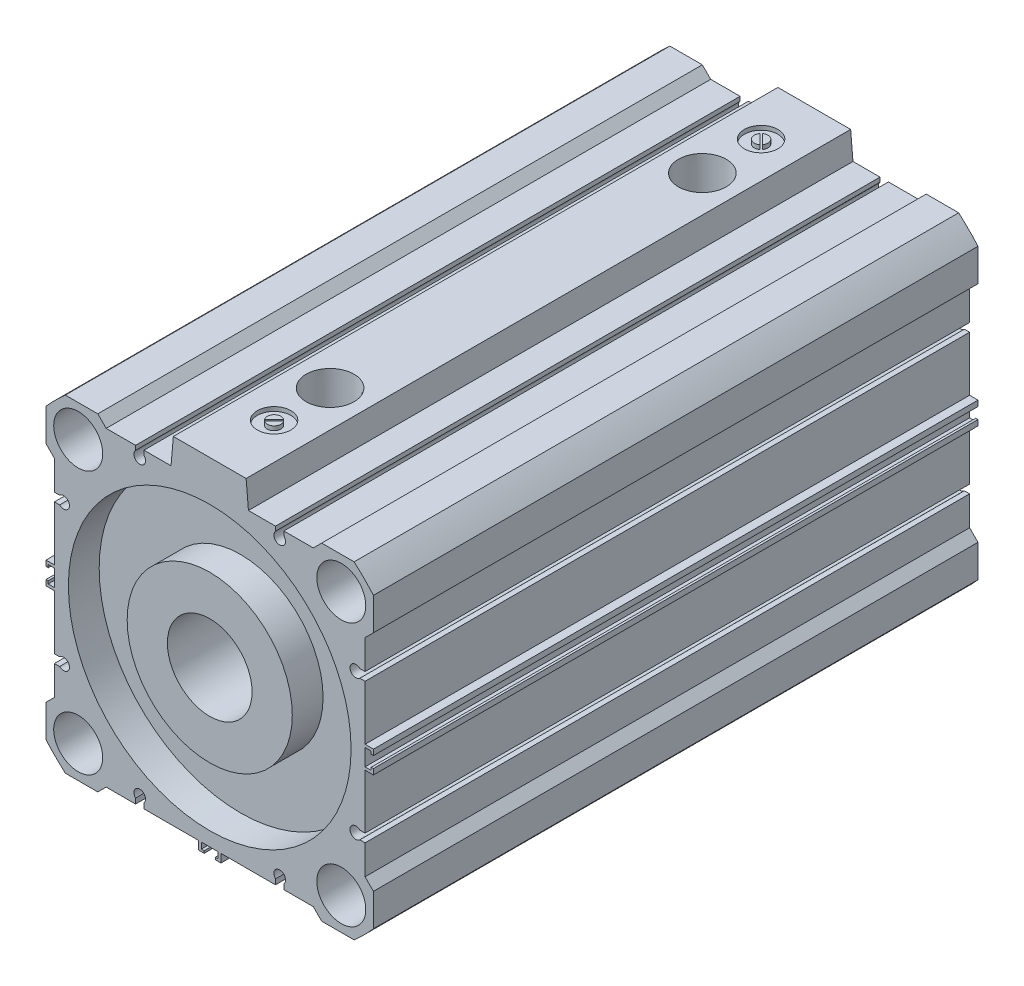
ISO-10303-21;
HEADER;
FILE_DESCRIPTION(('STEP AP214'),'2;1');
FILE_NAME('part.step','',(''),(''),'','','');
FILE_SCHEMA(('AUTOMOTIVE_DESIGN { 1 0 10303 214 1 1 1 1 }'));
ENDSEC;
DATA;
#1=APPLICATION_CONTEXT('core data for automotive mechanical design processes');
#2=APPLICATION_PROTOCOL_DEFINITION('international standard','automotive_design',2000,#1);
#3=PRODUCT_CONTEXT('',#1,'mechanical');
#4=PRODUCT('Part','Part','',(#3));
#5=PRODUCT_RELATED_PRODUCT_CATEGORY('part','',(#4));
#6=PRODUCT_DEFINITION_FORMATION('','',#4);
#7=PRODUCT_DEFINITION_CONTEXT('part definition',#1,'design');
#8=PRODUCT_DEFINITION('design','',#6,#7);
#9=PRODUCT_DEFINITION_SHAPE('','',#8);
#10=(LENGTH_UNIT() NAMED_UNIT(*) SI_UNIT(.MILLI.,.METRE.));
#11=(NAMED_UNIT(*) PLANE_ANGLE_UNIT() SI_UNIT($,.RADIAN.));
#12=(NAMED_UNIT(*) SI_UNIT($,.STERADIAN.) SOLID_ANGLE_UNIT());
#13=UNCERTAINTY_MEASURE_WITH_UNIT(LENGTH_MEASURE(1.E-05),#10,'distance_accuracy_value','');
#14=(GEOMETRIC_REPRESENTATION_CONTEXT(3) GLOBAL_UNCERTAINTY_ASSIGNED_CONTEXT((#13)) GLOBAL_UNIT_ASSIGNED_CONTEXT((#10,
#11,#12)) REPRESENTATION_CONTEXT('',''));
#15=CARTESIAN_POINT('',(0.,0.,0.));
#16=DIRECTION('',(0.,0.,1.));
#17=DIRECTION('',(1.,0.,0.));
#18=AXIS2_PLACEMENT_3D('',#15,#16,#17);
#19=CARTESIAN_POINT('',(0.,0.,128.));
#20=DIRECTION('',(0.,0.,-1.));
#21=DIRECTION('',(-1.,0.,0.));
#22=AXIS2_PLACEMENT_3D('',#19,#20,#21);
#23=CYLINDRICAL_SURFACE('',#22,15.125);
#24=CARTESIAN_POINT('',(0.,0.,128.));
#25=DIRECTION('',(0.,0.,1.));
#26=DIRECTION('',(1.,0.,0.));
#27=AXIS2_PLACEMENT_3D('',#24,#25,#26);
#28=CIRCLE('',#27,15.125);
#29=CARTESIAN_POINT('',(15.125,0.,128.));
#30=VERTEX_POINT('',#29);
#31=EDGE_CURVE('E1436',#30,#30,#28,.T.);
#32=ORIENTED_EDGE('',*,*,#31,.T.);
#33=EDGE_LOOP('',(#32));
#34=FACE_BOUND('',#33,.T.);
#35=CARTESIAN_POINT('',(0.,0.,102.5));
#36=DIRECTION('',(0.,0.,-1.));
#37=DIRECTION('',(-1.,0.,0.));
#38=AXIS2_PLACEMENT_3D('',#35,#36,#37);
#39=CIRCLE('',#38,15.125);
#40=CARTESIAN_POINT('',(-15.125,0.,102.5));
#41=VERTEX_POINT('',#40);
#42=EDGE_CURVE('E699',#41,#41,#39,.T.);
#43=ORIENTED_EDGE('',*,*,#42,.T.);
#44=EDGE_LOOP('',(#43));
#45=FACE_BOUND('',#44,.T.);
#46=ADVANCED_FACE('F34',(#34,#45),#23,.F.);
#47=CARTESIAN_POINT('',(-55.5000000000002,-36.9999999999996,128.));
#48=DIRECTION('',(1.,0.,0.));
#49=DIRECTION('',(0.,1.,0.));
#50=AXIS2_PLACEMENT_3D('',#47,#48,#49);
#51=PLANE('',#50);
#52=DIRECTION('',(0.,0.,-1.));
#53=VECTOR('',#52,1.);
#54=CARTESIAN_POINT('',(-55.5,4.00000000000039,131.605551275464));
#55=LINE('',#54,#53);
#56=CARTESIAN_POINT('',(-55.5,4.00000000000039,128.));
#57=VERTEX_POINT('',#56);
#58=CARTESIAN_POINT('',(-55.5,4.00000000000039,-88.));
#59=VERTEX_POINT('',#58);
#60=EDGE_CURVE('E777',#57,#59,#55,.T.);
#61=ORIENTED_EDGE('',*,*,#60,.F.);
#62=DIRECTION('',(0.,-1.,0.));
#63=VECTOR('',#62,1.);
#64=CARTESIAN_POINT('',(-55.5000000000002,-36.9999999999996,128.));
#65=LINE('',#64,#63);
#66=CARTESIAN_POINT('',(-55.4999999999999,23.5000000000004,128.));
#67=VERTEX_POINT('',#66);
#68=EDGE_CURVE('E1332',#67,#57,#65,.T.);
#69=ORIENTED_EDGE('',*,*,#68,.F.);
#70=DIRECTION('',(0.,0.,-1.));
#71=VECTOR('',#70,1.);
#72=CARTESIAN_POINT('',(-55.4999999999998,23.5000000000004,128.));
#73=LINE('',#72,#71);
#74=CARTESIAN_POINT('',(-55.4999999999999,23.5000000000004,-88.));
#75=VERTEX_POINT('',#74);
#76=EDGE_CURVE('E1149',#67,#75,#73,.T.);
#77=ORIENTED_EDGE('',*,*,#76,.T.);
#78=DIRECTION('',(0.,-1.,0.));
#79=VECTOR('',#78,1.);
#80=CARTESIAN_POINT('',(-55.5000000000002,-36.9999999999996,-88.));
#81=LINE('',#80,#79);
#82=EDGE_CURVE('E1320',#75,#59,#81,.T.);
#83=ORIENTED_EDGE('',*,*,#82,.T.);
#84=EDGE_LOOP('',(#61,#69,#77,#83));
#85=FACE_BOUND('',#84,.T.);
#86=ADVANCED_FACE('F1614',(#85),#51,.F.);
#87=DIRECTION('',(0.,0.,-1.));
#88=VECTOR('',#87,1.);
#89=CARTESIAN_POINT('',(-55.5,3.00000000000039,131.605551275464));
#90=LINE('',#89,#88);
#91=CARTESIAN_POINT('',(-55.5,3.00000000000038,128.));
#92=VERTEX_POINT('',#91);
#93=CARTESIAN_POINT('',(-55.5,3.00000000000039,-88.));
#94=VERTEX_POINT('',#93);
#95=EDGE_CURVE('E793',#92,#94,#90,.T.);
#96=ORIENTED_EDGE('',*,*,#95,.T.);
#97=CARTESIAN_POINT('',(-55.5,-2.99999999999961,-88.));
#98=VERTEX_POINT('',#97);
#99=EDGE_CURVE('E1321',#94,#98,#81,.T.);
#100=ORIENTED_EDGE('',*,*,#99,.T.);
#101=DIRECTION('',(0.,0.,-1.));
#102=VECTOR('',#101,1.);
#103=CARTESIAN_POINT('',(-55.5,-2.99999999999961,131.605551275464));
#104=LINE('',#103,#102);
#105=CARTESIAN_POINT('',(-55.5,-2.99999999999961,128.));
#106=VERTEX_POINT('',#105);
#107=EDGE_CURVE('E836',#106,#98,#104,.T.);
#108=ORIENTED_EDGE('',*,*,#107,.F.);
#109=EDGE_CURVE('E1333',#92,#106,#65,.T.);
#110=ORIENTED_EDGE('',*,*,#109,.F.);
#111=EDGE_LOOP('',(#96,#100,#108,#110));
#112=FACE_BOUND('',#111,.T.);
#113=ADVANCED_FACE('F1621',(#112),#51,.F.);
#114=DIRECTION('',(0.,0.,-1.));
#115=VECTOR('',#114,1.);
#116=CARTESIAN_POINT('',(-55.5,-3.99999999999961,131.605551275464));
#117=LINE('',#116,#115);
#118=CARTESIAN_POINT('',(-55.5,-3.9999999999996,128.));
#119=VERTEX_POINT('',#118);
#120=CARTESIAN_POINT('',(-55.5,-3.99999999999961,-88.));
#121=VERTEX_POINT('',#120);
#122=EDGE_CURVE('E819',#119,#121,#117,.T.);
#123=ORIENTED_EDGE('',*,*,#122,.T.);
#124=CARTESIAN_POINT('',(-55.5000000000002,-23.4999999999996,-88.));
#125=VERTEX_POINT('',#124);
#126=EDGE_CURVE('E1953',#121,#125,#81,.T.);
#127=ORIENTED_EDGE('',*,*,#126,.T.);
#128=DIRECTION('',(0.,0.,1.));
#129=VECTOR('',#128,1.);
#130=CARTESIAN_POINT('',(-55.5000000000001,-23.4999999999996,128.));
#131=LINE('',#130,#129);
#132=CARTESIAN_POINT('',(-55.5000000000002,-23.4999999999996,128.));
#133=VERTEX_POINT('',#132);
#134=EDGE_CURVE('E43',#125,#133,#131,.T.);
#135=ORIENTED_EDGE('',*,*,#134,.T.);
#136=EDGE_CURVE('E1942',#119,#133,#65,.T.);
#137=ORIENTED_EDGE('',*,*,#136,.F.);
#138=EDGE_LOOP('',(#123,#127,#135,#137));
#139=FACE_BOUND('',#138,.T.);
#140=ADVANCED_FACE('F1951',(#139),#51,.F.);
#141=CARTESIAN_POINT('',(36.9999999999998,-55.5000000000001,128.));
#142=DIRECTION('',(0.,1.,0.));
#143=DIRECTION('',(-1.,0.,0.));
#144=AXIS2_PLACEMENT_3D('',#141,#142,#143);
#145=PLANE('',#144);
#146=DIRECTION('',(0.,0.,-1.));
#147=VECTOR('',#146,1.);
#148=CARTESIAN_POINT('',(-4.00000000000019,-55.5,131.605551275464));
#149=LINE('',#148,#147);
#150=CARTESIAN_POINT('',(-4.00000000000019,-55.5,128.));
#151=VERTEX_POINT('',#150);
#152=CARTESIAN_POINT('',(-4.00000000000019,-55.5,-88.));
#153=VERTEX_POINT('',#152);
#154=EDGE_CURVE('E862',#151,#153,#149,.T.);
#155=ORIENTED_EDGE('',*,*,#154,.F.);
#156=DIRECTION('',(1.,0.,0.));
#157=VECTOR('',#156,1.);
#158=CARTESIAN_POINT('',(36.9999999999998,-55.5000000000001,128.));
#159=LINE('',#158,#157);
#160=CARTESIAN_POINT('',(-23.5000000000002,-55.5,128.));
#161=VERTEX_POINT('',#160);
#162=EDGE_CURVE('E1365',#161,#151,#159,.T.);
#163=ORIENTED_EDGE('',*,*,#162,.F.);
#164=DIRECTION('',(0.,0.,-1.));
#165=VECTOR('',#164,1.);
#166=CARTESIAN_POINT('',(-23.5000000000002,-55.4999999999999,128.));
#167=LINE('',#166,#165);
#168=CARTESIAN_POINT('',(-23.5000000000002,-55.5,-88.));
#169=VERTEX_POINT('',#168);
#170=EDGE_CURVE('E1196',#161,#169,#167,.T.);
#171=ORIENTED_EDGE('',*,*,#170,.T.);
#172=DIRECTION('',(1.,0.,0.));
#173=VECTOR('',#172,1.);
#174=CARTESIAN_POINT('',(36.9999999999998,-55.5000000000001,-88.));
#175=LINE('',#174,#173);
#176=EDGE_CURVE('E1353',#169,#153,#175,.T.);
#177=ORIENTED_EDGE('',*,*,#176,.T.);
#178=EDGE_LOOP('',(#155,#163,#171,#177));
#179=FACE_BOUND('',#178,.T.);
#180=ADVANCED_FACE('F1863',(#179),#145,.F.);
#181=DIRECTION('',(0.,0.,-1.));
#182=VECTOR('',#181,1.);
#183=CARTESIAN_POINT('',(-3.00000000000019,-55.5,131.605551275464));
#184=LINE('',#183,#182);
#185=CARTESIAN_POINT('',(-3.00000000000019,-55.5,128.));
#186=VERTEX_POINT('',#185);
#187=CARTESIAN_POINT('',(-3.00000000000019,-55.5,-88.));
#188=VERTEX_POINT('',#187);
#189=EDGE_CURVE('E878',#186,#188,#184,.T.);
#190=ORIENTED_EDGE('',*,*,#189,.T.);
#191=CARTESIAN_POINT('',(2.99999999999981,-55.5,-88.));
#192=VERTEX_POINT('',#191);
#193=EDGE_CURVE('E1354',#188,#192,#175,.T.);
#194=ORIENTED_EDGE('',*,*,#193,.T.);
#195=DIRECTION('',(0.,0.,-1.));
#196=VECTOR('',#195,1.);
#197=CARTESIAN_POINT('',(2.99999999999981,-55.5,131.605551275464));
#198=LINE('',#197,#196);
#199=CARTESIAN_POINT('',(2.99999999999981,-55.5,128.));
#200=VERTEX_POINT('',#199);
#201=EDGE_CURVE('E921',#200,#192,#198,.T.);
#202=ORIENTED_EDGE('',*,*,#201,.F.);
#203=EDGE_CURVE('E1366',#186,#200,#159,.T.);
#204=ORIENTED_EDGE('',*,*,#203,.F.);
#205=EDGE_LOOP('',(#190,#194,#202,#204));
#206=FACE_BOUND('',#205,.T.);
#207=ADVANCED_FACE('F2170',(#206),#145,.F.);
#208=DIRECTION('',(0.,0.,-1.));
#209=VECTOR('',#208,1.);
#210=CARTESIAN_POINT('',(3.99999999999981,-55.5,131.605551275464));
#211=LINE('',#210,#209);
#212=CARTESIAN_POINT('',(3.9999999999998,-55.5,128.));
#213=VERTEX_POINT('',#212);
#214=CARTESIAN_POINT('',(3.99999999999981,-55.5,-88.));
#215=VERTEX_POINT('',#214);
#216=EDGE_CURVE('E904',#213,#215,#211,.T.);
#217=ORIENTED_EDGE('',*,*,#216,.T.);
#218=CARTESIAN_POINT('',(23.4999999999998,-55.5000000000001,-88.));
#219=VERTEX_POINT('',#218);
#220=EDGE_CURVE('E2162',#215,#219,#175,.T.);
#221=ORIENTED_EDGE('',*,*,#220,.T.);
#222=DIRECTION('',(0.,0.,1.));
#223=VECTOR('',#222,1.);
#224=CARTESIAN_POINT('',(23.4999999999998,-55.5000000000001,128.));
#225=LINE('',#224,#223);
#226=CARTESIAN_POINT('',(23.4999999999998,-55.5000000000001,128.));
#227=VERTEX_POINT('',#226);
#228=EDGE_CURVE('E1556',#219,#227,#225,.T.);
#229=ORIENTED_EDGE('',*,*,#228,.T.);
#230=EDGE_CURVE('E2160',#213,#227,#159,.T.);
#231=ORIENTED_EDGE('',*,*,#230,.F.);
#232=EDGE_LOOP('',(#217,#221,#229,#231));
#233=FACE_BOUND('',#232,.T.);
#234=ADVANCED_FACE('F2187',(#233),#145,.F.);
#235=CARTESIAN_POINT('',(55.5,37.,128.));
#236=DIRECTION('',(-1.,0.,0.));
#237=DIRECTION('',(0.,0.,1.));
#238=AXIS2_PLACEMENT_3D('',#235,#236,#237);
#239=PLANE('',#238);
#240=DIRECTION('',(0.,0.,-1.));
#241=VECTOR('',#240,1.);
#242=CARTESIAN_POINT('',(55.5,-4.,131.605551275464));
#243=LINE('',#242,#241);
#244=CARTESIAN_POINT('',(55.5,-4.,128.));
#245=VERTEX_POINT('',#244);
#246=CARTESIAN_POINT('',(55.5,-4.,-88.));
#247=VERTEX_POINT('',#246);
#248=EDGE_CURVE('E947',#245,#247,#243,.T.);
#249=ORIENTED_EDGE('',*,*,#248,.F.);
#250=DIRECTION('',(0.,1.,0.));
#251=VECTOR('',#250,1.);
#252=CARTESIAN_POINT('',(55.5,37.,128.));
#253=LINE('',#252,#251);
#254=CARTESIAN_POINT('',(55.5,-23.5,128.));
#255=VERTEX_POINT('',#254);
#256=EDGE_CURVE('E1398',#255,#245,#253,.T.);
#257=ORIENTED_EDGE('',*,*,#256,.F.);
#258=DIRECTION('',(0.,0.,-1.));
#259=VECTOR('',#258,1.);
#260=CARTESIAN_POINT('',(55.5,-23.5,128.));
#261=LINE('',#260,#259);
#262=CARTESIAN_POINT('',(55.5,-23.5,-88.));
#263=VERTEX_POINT('',#262);
#264=EDGE_CURVE('E1243',#255,#263,#261,.T.);
#265=ORIENTED_EDGE('',*,*,#264,.T.);
#266=DIRECTION('',(0.,1.,0.));
#267=VECTOR('',#266,1.);
#268=CARTESIAN_POINT('',(55.5,37.,-88.));
#269=LINE('',#268,#267);
#270=EDGE_CURVE('E1386',#263,#247,#269,.T.);
#271=ORIENTED_EDGE('',*,*,#270,.T.);
#272=EDGE_LOOP('',(#249,#257,#265,#271));
#273=FACE_BOUND('',#272,.T.);
#274=ADVANCED_FACE('F1877',(#273),#239,.F.);
#275=DIRECTION('',(0.,0.,-1.));
#276=VECTOR('',#275,1.);
#277=CARTESIAN_POINT('',(55.5,-3.,131.605551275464));
#278=LINE('',#277,#276);
#279=CARTESIAN_POINT('',(55.5,-3.,128.));
#280=VERTEX_POINT('',#279);
#281=CARTESIAN_POINT('',(55.5,-3.,-88.));
#282=VERTEX_POINT('',#281);
#283=EDGE_CURVE('E963',#280,#282,#278,.T.);
#284=ORIENTED_EDGE('',*,*,#283,.T.);
#285=CARTESIAN_POINT('',(55.5,3.,-88.));
#286=VERTEX_POINT('',#285);
#287=EDGE_CURVE('E1387',#282,#286,#269,.T.);
#288=ORIENTED_EDGE('',*,*,#287,.T.);
#289=DIRECTION('',(0.,0.,-1.));
#290=VECTOR('',#289,1.);
#291=CARTESIAN_POINT('',(55.5,3.,131.605551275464));
#292=LINE('',#291,#290);
#293=CARTESIAN_POINT('',(55.5,3.,128.));
#294=VERTEX_POINT('',#293);
#295=EDGE_CURVE('E1006',#294,#286,#292,.T.);
#296=ORIENTED_EDGE('',*,*,#295,.F.);
#297=EDGE_CURVE('E1399',#280,#294,#253,.T.);
#298=ORIENTED_EDGE('',*,*,#297,.F.);
#299=EDGE_LOOP('',(#284,#288,#296,#298));
#300=FACE_BOUND('',#299,.T.);
#301=ADVANCED_FACE('F2096',(#300),#239,.F.);
#302=DIRECTION('',(0.,0.,-1.));
#303=VECTOR('',#302,1.);
#304=CARTESIAN_POINT('',(55.5,4.,131.605551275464));
#305=LINE('',#304,#303);
#306=CARTESIAN_POINT('',(55.5,4.,128.));
#307=VERTEX_POINT('',#306);
#308=CARTESIAN_POINT('',(55.5,4.,-88.));
#309=VERTEX_POINT('',#308);
#310=EDGE_CURVE('E989',#307,#309,#305,.T.);
#311=ORIENTED_EDGE('',*,*,#310,.T.);
#312=CARTESIAN_POINT('',(55.5,23.5,-88.));
#313=VERTEX_POINT('',#312);
#314=EDGE_CURVE('E2099',#309,#313,#269,.T.);
#315=ORIENTED_EDGE('',*,*,#314,.T.);
#316=DIRECTION('',(0.,0.,1.));
#317=VECTOR('',#316,1.);
#318=CARTESIAN_POINT('',(55.5,23.5,128.));
#319=LINE('',#318,#317);
#320=CARTESIAN_POINT('',(55.5,23.5,128.));
#321=VERTEX_POINT('',#320);
#322=EDGE_CURVE('E1548',#313,#321,#319,.T.);
#323=ORIENTED_EDGE('',*,*,#322,.T.);
#324=EDGE_CURVE('E2118',#307,#321,#253,.T.);
#325=ORIENTED_EDGE('',*,*,#324,.F.);
#326=EDGE_LOOP('',(#311,#315,#323,#325));
#327=FACE_BOUND('',#326,.T.);
#328=ADVANCED_FACE('F1650',(#327),#239,.F.);
#329=CARTESIAN_POINT('',(0.,0.,-86.));
#330=DIRECTION('',(0.,0.,-1.));
#331=DIRECTION('',(-1.,0.,0.));
#332=AXIS2_PLACEMENT_3D('',#329,#330,#331);
#333=PLANE('',#332);
#334=CARTESIAN_POINT('',(0.,0.,-86.));
#335=DIRECTION('',(0.,0.,-1.));
#336=DIRECTION('',(-1.,0.,0.));
#337=AXIS2_PLACEMENT_3D('',#334,#335,#336);
#338=CIRCLE('',#337,50.5);
#339=CARTESIAN_POINT('',(-50.5,0.,-86.));
#340=VERTEX_POINT('',#339);
#341=EDGE_CURVE('E1027',#340,#340,#338,.T.);
#342=ORIENTED_EDGE('',*,*,#341,.T.);
#343=EDGE_LOOP('',(#342));
#344=FACE_BOUND('',#343,.T.);
#345=CARTESIAN_POINT('',(0.,0.,-86.));
#346=DIRECTION('',(0.,0.,-1.));
#347=DIRECTION('',(-1.,0.,0.));
#348=AXIS2_PLACEMENT_3D('',#345,#346,#347);
#349=CIRCLE('',#348,29.5);
#350=CARTESIAN_POINT('',(-29.5,0.,-86.));
#351=VERTEX_POINT('',#350);
#352=EDGE_CURVE('E993',#351,#351,#349,.T.);
#353=ORIENTED_EDGE('',*,*,#352,.F.);
#354=EDGE_LOOP('',(#353));
#355=FACE_BOUND('',#354,.T.);
#356=ADVANCED_FACE('F1646',(#344,#355),#333,.T.);
#357=CARTESIAN_POINT('',(0.,0.,-88.));
#358=DIRECTION('',(0.,0.,1.));
#359=DIRECTION('',(1.,0.,0.));
#360=AXIS2_PLACEMENT_3D('',#357,#358,#359);
#361=PLANE('',#360);
#362=CARTESIAN_POINT('',(0.,0.,-88.));
#363=DIRECTION('',(0.,0.,-1.));
#364=DIRECTION('',(-1.,0.,0.));
#365=AXIS2_PLACEMENT_3D('',#362,#363,#364);
#366=CIRCLE('',#365,50.5);
#367=CARTESIAN_POINT('',(-50.5,0.,-88.));
#368=VERTEX_POINT('',#367);
#369=EDGE_CURVE('E1026',#368,#368,#366,.T.);
#370=ORIENTED_EDGE('',*,*,#369,.F.);
#371=EDGE_LOOP('',(#370));
#372=FACE_BOUND('',#371,.T.);
#373=CARTESIAN_POINT('',(47.,47.,-88.));
#374=DIRECTION('',(0.,0.,1.));
#375=DIRECTION('',(1.,0.,0.));
#376=AXIS2_PLACEMENT_3D('',#373,#374,#375);
#377=CIRCLE('',#376,8.75);
#378=CARTESIAN_POINT('',(55.75,47.,-88.));
#379=VERTEX_POINT('',#378);
#380=EDGE_CURVE('E1055',#379,#379,#377,.T.);
#381=ORIENTED_EDGE('',*,*,#380,.T.);
#382=EDGE_LOOP('',(#381));
#383=FACE_BOUND('',#382,.T.);
#384=CARTESIAN_POINT('',(-47.,-47.,-88.));
#385=DIRECTION('',(0.,0.,1.));
#386=DIRECTION('',(1.,0.,0.));
#387=AXIS2_PLACEMENT_3D('',#384,#385,#386);
#388=CIRCLE('',#387,8.75);
#389=CARTESIAN_POINT('',(-38.25,-47.,-88.));
#390=VERTEX_POINT('',#389);
#391=EDGE_CURVE('E1069',#390,#390,#388,.T.);
#392=ORIENTED_EDGE('',*,*,#391,.T.);
#393=EDGE_LOOP('',(#392));
#394=FACE_BOUND('',#393,.T.);
#395=ORIENTED_EDGE('',*,*,#82,.F.);
#396=DIRECTION('',(1.,0.,0.));
#397=VECTOR('',#396,1.);
#398=CARTESIAN_POINT('',(-58.4999999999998,23.5000000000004,-88.));
#399=LINE('',#398,#397);
#400=CARTESIAN_POINT('',(-53.6337450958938,23.5000000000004,-88.));
#401=VERTEX_POINT('',#400);
#402=EDGE_CURVE('E1137',#75,#401,#399,.T.);
#403=ORIENTED_EDGE('',*,*,#402,.T.);
#404=CARTESIAN_POINT('',(-52.1999999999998,25.0000000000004,-88.));
#405=DIRECTION('',(0.,0.,1.));
#406=DIRECTION('',(1.,0.,0.));
#407=AXIS2_PLACEMENT_3D('',#404,#405,#406);
#408=CIRCLE('',#407,2.075);
#409=CARTESIAN_POINT('',(-53.6337450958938,26.5000000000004,-88.));
#410=VERTEX_POINT('',#409);
#411=EDGE_CURVE('E1131',#401,#410,#408,.T.);
#412=ORIENTED_EDGE('',*,*,#411,.T.);
#413=DIRECTION('',(-1.,0.,0.));
#414=VECTOR('',#413,1.);
#415=CARTESIAN_POINT('',(-58.4999999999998,26.5000000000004,-88.));
#416=LINE('',#415,#414);
#417=CARTESIAN_POINT('',(-55.4999999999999,26.5000000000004,-88.));
#418=VERTEX_POINT('',#417);
#419=EDGE_CURVE('E1134',#410,#418,#416,.T.);
#420=ORIENTED_EDGE('',*,*,#419,.T.);
#421=CARTESIAN_POINT('',(-55.4999999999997,37.0000000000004,-88.));
#422=VERTEX_POINT('',#421);
#423=EDGE_CURVE('E1316',#422,#418,#81,.T.);
#424=ORIENTED_EDGE('',*,*,#423,.F.);
#425=DIRECTION('',(0.707106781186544,-0.707106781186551,0.));
#426=VECTOR('',#425,1.);
#427=CARTESIAN_POINT('',(-55.4999999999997,37.0000000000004,-88.));
#428=LINE('',#427,#426);
#429=CARTESIAN_POINT('',(-58.4999999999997,40.0000000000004,-88.));
#430=VERTEX_POINT('',#429);
#431=EDGE_CURVE('E1312',#430,#422,#428,.T.);
#432=ORIENTED_EDGE('',*,*,#431,.F.);
#433=DIRECTION('',(0.,1.,0.));
#434=VECTOR('',#433,1.);
#435=CARTESIAN_POINT('',(-58.5,51.5921505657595,-88.));
#436=LINE('',#435,#434);
#437=CARTESIAN_POINT('',(-58.5,51.5921505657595,-88.));
#438=VERTEX_POINT('',#437);
#439=EDGE_CURVE('E1472',#430,#438,#436,.T.);
#440=ORIENTED_EDGE('',*,*,#439,.T.);
#441=CARTESIAN_POINT('',(0.,0.,-88.));
#442=DIRECTION('',(0.,0.,1.));
#443=DIRECTION('',(1.,0.,0.));
#444=AXIS2_PLACEMENT_3D('',#441,#442,#443);
#445=CIRCLE('',#444,78.);
#446=CARTESIAN_POINT('',(-51.5921505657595,58.5,-88.));
#447=VERTEX_POINT('',#446);
#448=EDGE_CURVE('E1469',#438,#447,#445,.F.);
#449=ORIENTED_EDGE('',*,*,#448,.T.);
#450=DIRECTION('',(1.,0.,0.));
#451=VECTOR('',#450,1.);
#452=CARTESIAN_POINT('',(-51.5921505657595,58.5,-88.));
#453=LINE('',#452,#451);
#454=CARTESIAN_POINT('',(-40.,58.5,-88.));
#455=VERTEX_POINT('',#454);
#456=EDGE_CURVE('E1466',#447,#455,#453,.T.);
#457=ORIENTED_EDGE('',*,*,#456,.T.);
#458=DIRECTION('',(0.707106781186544,-0.707106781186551,0.));
#459=VECTOR('',#458,1.);
#460=CARTESIAN_POINT('',(-37.,55.5,-88.));
#461=LINE('',#460,#459);
#462=CARTESIAN_POINT('',(-37.,55.5,-88.));
#463=VERTEX_POINT('',#462);
#464=EDGE_CURVE('E1410',#455,#463,#461,.T.);
#465=ORIENTED_EDGE('',*,*,#464,.T.);
#466=DIRECTION('',(1.,0.,0.));
#467=VECTOR('',#466,1.);
#468=CARTESIAN_POINT('',(37.,55.5,-88.));
#469=LINE('',#468,#467);
#470=CARTESIAN_POINT('',(-26.5,55.5,-88.));
#471=VERTEX_POINT('',#470);
#472=EDGE_CURVE('E1415',#463,#471,#469,.T.);
#473=ORIENTED_EDGE('',*,*,#472,.T.);
#474=DIRECTION('',(0.,-1.,0.));
#475=VECTOR('',#474,1.);
#476=CARTESIAN_POINT('',(-26.5,58.5,-88.));
#477=LINE('',#476,#475);
#478=CARTESIAN_POINT('',(-26.5,53.933745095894,-88.));
#479=VERTEX_POINT('',#478);
#480=EDGE_CURVE('E1281',#471,#479,#477,.T.);
#481=ORIENTED_EDGE('',*,*,#480,.T.);
#482=CARTESIAN_POINT('',(-25.,52.5,-88.));
#483=DIRECTION('',(0.,0.,1.));
#484=DIRECTION('',(-1.,0.,0.));
#485=AXIS2_PLACEMENT_3D('',#482,#483,#484);
#486=CIRCLE('',#485,2.075);
#487=CARTESIAN_POINT('',(-23.5,53.933745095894,-88.));
#488=VERTEX_POINT('',#487);
#489=EDGE_CURVE('E1275',#479,#488,#486,.T.);
#490=ORIENTED_EDGE('',*,*,#489,.T.);
#491=DIRECTION('',(0.,1.,0.));
#492=VECTOR('',#491,1.);
#493=CARTESIAN_POINT('',(-23.5,58.5,-88.));
#494=LINE('',#493,#492);
#495=CARTESIAN_POINT('',(-23.5,55.5,-88.));
#496=VERTEX_POINT('',#495);
#497=EDGE_CURVE('E1278',#488,#496,#494,.T.);
#498=ORIENTED_EDGE('',*,*,#497,.T.);
#499=CARTESIAN_POINT('',(-13.8311423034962,55.5,-88.));
#500=VERTEX_POINT('',#499);
#501=EDGE_CURVE('E1419',#496,#500,#469,.T.);
#502=ORIENTED_EDGE('',*,*,#501,.T.);
#503=DIRECTION('',(0.0871557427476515,0.996194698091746,0.));
#504=VECTOR('',#503,1.);
#505=CARTESIAN_POINT('',(-13.,65.,-88.));
#506=LINE('',#505,#504);
#507=CARTESIAN_POINT('',(-13.,65.,-88.));
#508=VERTEX_POINT('',#507);
#509=EDGE_CURVE('E1105',#500,#508,#506,.T.);
#510=ORIENTED_EDGE('',*,*,#509,.T.);
#511=DIRECTION('',(1.,0.,0.));
#512=VECTOR('',#511,1.);
#513=CARTESIAN_POINT('',(-13.,65.,-88.));
#514=LINE('',#513,#512);
#515=CARTESIAN_POINT('',(13.,65.,-88.));
#516=VERTEX_POINT('',#515);
#517=EDGE_CURVE('E1102',#508,#516,#514,.T.);
#518=ORIENTED_EDGE('',*,*,#517,.T.);
#519=DIRECTION('',(0.0871557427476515,-0.996194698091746,0.));
#520=VECTOR('',#519,1.);
#521=CARTESIAN_POINT('',(13.,65.,-88.));
#522=LINE('',#521,#520);
#523=CARTESIAN_POINT('',(13.8311423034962,55.5,-88.));
#524=VERTEX_POINT('',#523);
#525=EDGE_CURVE('E1100',#516,#524,#522,.T.);
#526=ORIENTED_EDGE('',*,*,#525,.T.);
#527=CARTESIAN_POINT('',(23.5,55.5,-88.));
#528=VERTEX_POINT('',#527);
#529=EDGE_CURVE('E1420',#524,#528,#469,.T.);
#530=ORIENTED_EDGE('',*,*,#529,.T.);
#531=DIRECTION('',(0.,-1.,0.));
#532=VECTOR('',#531,1.);
#533=CARTESIAN_POINT('',(23.5,58.5,-88.));
#534=LINE('',#533,#532);
#535=CARTESIAN_POINT('',(23.5,53.933745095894,-88.));
#536=VERTEX_POINT('',#535);
#537=EDGE_CURVE('E1296',#528,#536,#534,.T.);
#538=ORIENTED_EDGE('',*,*,#537,.T.);
#539=CARTESIAN_POINT('',(25.,52.5,-88.));
#540=DIRECTION('',(0.,0.,1.));
#541=DIRECTION('',(1.,0.,0.));
#542=AXIS2_PLACEMENT_3D('',#539,#540,#541);
#543=CIRCLE('',#542,2.075);
#544=CARTESIAN_POINT('',(26.5,53.933745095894,-88.));
#545=VERTEX_POINT('',#544);
#546=EDGE_CURVE('E1299',#536,#545,#543,.T.);
#547=ORIENTED_EDGE('',*,*,#546,.T.);
#548=DIRECTION('',(0.,1.,0.));
#549=VECTOR('',#548,1.);
#550=CARTESIAN_POINT('',(26.5,58.5,-88.));
#551=LINE('',#550,#549);
#552=CARTESIAN_POINT('',(26.5,55.5,-88.));
#553=VERTEX_POINT('',#552);
#554=EDGE_CURVE('E1302',#545,#553,#551,.T.);
#555=ORIENTED_EDGE('',*,*,#554,.T.);
#556=CARTESIAN_POINT('',(37.,55.5,-88.));
#557=VERTEX_POINT('',#556);
#558=EDGE_CURVE('E1413',#553,#557,#469,.T.);
#559=ORIENTED_EDGE('',*,*,#558,.T.);
#560=DIRECTION('',(0.707106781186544,0.707106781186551,0.));
#561=VECTOR('',#560,1.);
#562=CARTESIAN_POINT('',(40.,58.5,-88.));
#563=LINE('',#562,#561);
#564=CARTESIAN_POINT('',(40.,58.5,-88.));
#565=VERTEX_POINT('',#564);
#566=EDGE_CURVE('E1418',#557,#565,#563,.T.);
#567=ORIENTED_EDGE('',*,*,#566,.T.);
#568=CARTESIAN_POINT('',(51.5921505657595,58.5,-88.));
#569=VERTEX_POINT('',#568);
#570=EDGE_CURVE('E1465',#565,#569,#453,.T.);
#571=ORIENTED_EDGE('',*,*,#570,.T.);
#572=CARTESIAN_POINT('',(0.,0.,-88.));
#573=DIRECTION('',(0.,0.,1.));
#574=DIRECTION('',(1.,0.,0.));
#575=AXIS2_PLACEMENT_3D('',#572,#573,#574);
#576=CIRCLE('',#575,78.);
#577=CARTESIAN_POINT('',(58.5,51.5921505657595,-88.));
#578=VERTEX_POINT('',#577);
#579=EDGE_CURVE('E1455',#569,#578,#576,.F.);
#580=ORIENTED_EDGE('',*,*,#579,.T.);
#581=DIRECTION('',(0.,-1.,0.));
#582=VECTOR('',#581,1.);
#583=CARTESIAN_POINT('',(58.5,51.5921505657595,-88.));
#584=LINE('',#583,#582);
#585=CARTESIAN_POINT('',(58.5,40.,-88.));
#586=VERTEX_POINT('',#585);
#587=EDGE_CURVE('E1458',#578,#586,#584,.T.);
#588=ORIENTED_EDGE('',*,*,#587,.T.);
#589=DIRECTION('',(0.707106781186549,0.707106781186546,0.));
#590=VECTOR('',#589,1.);
#591=CARTESIAN_POINT('',(55.5,37.,-88.));
#592=LINE('',#591,#590);
#593=CARTESIAN_POINT('',(55.5,37.,-88.));
#594=VERTEX_POINT('',#593);
#595=EDGE_CURVE('E1370',#594,#586,#592,.T.);
#596=ORIENTED_EDGE('',*,*,#595,.F.);
#597=CARTESIAN_POINT('',(55.5,26.5,-88.));
#598=VERTEX_POINT('',#597);
#599=EDGE_CURVE('E1381',#598,#594,#269,.T.);
#600=ORIENTED_EDGE('',*,*,#599,.F.);
#601=DIRECTION('',(-1.,0.,0.));
#602=VECTOR('',#601,1.);
#603=CARTESIAN_POINT('',(58.5,26.5,-88.));
#604=LINE('',#603,#602);
#605=CARTESIAN_POINT('',(53.633745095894,26.5,-88.));
#606=VERTEX_POINT('',#605);
#607=EDGE_CURVE('E1254',#598,#606,#604,.T.);
#608=ORIENTED_EDGE('',*,*,#607,.T.);
#609=CARTESIAN_POINT('',(52.2,25.,-88.));
#610=DIRECTION('',(0.,0.,1.));
#611=DIRECTION('',(1.,0.,0.));
#612=AXIS2_PLACEMENT_3D('',#609,#610,#611);
#613=CIRCLE('',#612,2.075);
#614=CARTESIAN_POINT('',(53.633745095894,23.5,-88.));
#615=VERTEX_POINT('',#614);
#616=EDGE_CURVE('E1257',#606,#615,#613,.T.);
#617=ORIENTED_EDGE('',*,*,#616,.T.);
#618=DIRECTION('',(1.,0.,0.));
#619=VECTOR('',#618,1.);
#620=CARTESIAN_POINT('',(58.5,23.5,-88.));
#621=LINE('',#620,#619);
#622=EDGE_CURVE('E1260',#615,#313,#621,.T.);
#623=ORIENTED_EDGE('',*,*,#622,.T.);
#624=ORIENTED_EDGE('',*,*,#314,.F.);
#625=DIRECTION('',(1.,0.,0.));
#626=VECTOR('',#625,1.);
#627=CARTESIAN_POINT('',(55.5,4.,-88.));
#628=LINE('',#627,#626);
#629=CARTESIAN_POINT('',(58.5,4.,-88.));
#630=VERTEX_POINT('',#629);
#631=EDGE_CURVE('E983',#309,#630,#628,.T.);
#632=ORIENTED_EDGE('',*,*,#631,.T.);
#633=DIRECTION('',(0.,-1.,0.));
#634=VECTOR('',#633,1.);
#635=CARTESIAN_POINT('',(58.5,4.,-88.));
#636=LINE('',#635,#634);
#637=CARTESIAN_POINT('',(58.5,2.,-88.));
#638=VERTEX_POINT('',#637);
#639=EDGE_CURVE('E980',#630,#638,#636,.T.);
#640=ORIENTED_EDGE('',*,*,#639,.T.);
#641=DIRECTION('',(-1.,0.,0.));
#642=VECTOR('',#641,1.);
#643=CARTESIAN_POINT('',(57.7,2.,-88.));
#644=LINE('',#643,#642);
#645=CARTESIAN_POINT('',(57.7,2.,-88.));
#646=VERTEX_POINT('',#645);
#647=EDGE_CURVE('E977',#638,#646,#644,.T.);
#648=ORIENTED_EDGE('',*,*,#647,.T.);
#649=DIRECTION('',(0.,1.,0.));
#650=VECTOR('',#649,1.);
#651=CARTESIAN_POINT('',(57.7,2.,-88.));
#652=LINE('',#651,#650);
#653=CARTESIAN_POINT('',(57.7,3.,-88.));
#654=VERTEX_POINT('',#653);
#655=EDGE_CURVE('E950',#646,#654,#652,.T.);
#656=ORIENTED_EDGE('',*,*,#655,.T.);
#657=DIRECTION('',(-1.,0.,0.));
#658=VECTOR('',#657,1.);
#659=CARTESIAN_POINT('',(55.5,3.,-88.));
#660=LINE('',#659,#658);
#661=EDGE_CURVE('E986',#654,#286,#660,.T.);
#662=ORIENTED_EDGE('',*,*,#661,.T.);
#663=ORIENTED_EDGE('',*,*,#287,.F.);
#664=DIRECTION('',(1.,0.,0.));
#665=VECTOR('',#664,1.);
#666=CARTESIAN_POINT('',(55.5,-3.,-88.));
#667=LINE('',#666,#665);
#668=CARTESIAN_POINT('',(57.7,-3.,-88.));
#669=VERTEX_POINT('',#668);
#670=EDGE_CURVE('E938',#282,#669,#667,.T.);
#671=ORIENTED_EDGE('',*,*,#670,.T.);
#672=DIRECTION('',(0.,1.,0.));
#673=VECTOR('',#672,1.);
#674=CARTESIAN_POINT('',(57.7,-2.,-88.));
#675=LINE('',#674,#673);
#676=CARTESIAN_POINT('',(57.7,-2.,-88.));
#677=VERTEX_POINT('',#676);
#678=EDGE_CURVE('E935',#669,#677,#675,.T.);
#679=ORIENTED_EDGE('',*,*,#678,.T.);
#680=DIRECTION('',(1.,0.,0.));
#681=VECTOR('',#680,1.);
#682=CARTESIAN_POINT('',(57.7,-2.,-88.));
#683=LINE('',#682,#681);
#684=CARTESIAN_POINT('',(58.5,-2.,-88.));
#685=VERTEX_POINT('',#684);
#686=EDGE_CURVE('E908',#677,#685,#683,.T.);
#687=ORIENTED_EDGE('',*,*,#686,.T.);
#688=DIRECTION('',(0.,-1.,0.));
#689=VECTOR('',#688,1.);
#690=CARTESIAN_POINT('',(58.5,-2.,-88.));
#691=LINE('',#690,#689);
#692=CARTESIAN_POINT('',(58.5,-4.,-88.));
#693=VERTEX_POINT('',#692);
#694=EDGE_CURVE('E944',#685,#693,#691,.T.);
#695=ORIENTED_EDGE('',*,*,#694,.T.);
#696=DIRECTION('',(-1.,0.,0.));
#697=VECTOR('',#696,1.);
#698=CARTESIAN_POINT('',(55.5,-4.,-88.));
#699=LINE('',#698,#697);
#700=EDGE_CURVE('E941',#693,#247,#699,.T.);
#701=ORIENTED_EDGE('',*,*,#700,.T.);
#702=ORIENTED_EDGE('',*,*,#270,.F.);
#703=DIRECTION('',(-1.,0.,0.));
#704=VECTOR('',#703,1.);
#705=CARTESIAN_POINT('',(58.5,-23.5,-88.));
#706=LINE('',#705,#704);
#707=CARTESIAN_POINT('',(53.633745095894,-23.5,-88.));
#708=VERTEX_POINT('',#707);
#709=EDGE_CURVE('E1231',#263,#708,#706,.T.);
#710=ORIENTED_EDGE('',*,*,#709,.T.);
#711=CARTESIAN_POINT('',(52.2,-25.,-88.));
#712=DIRECTION('',(0.,0.,1.));
#713=DIRECTION('',(-1.,0.,0.));
#714=AXIS2_PLACEMENT_3D('',#711,#712,#713);
#715=CIRCLE('',#714,2.075);
#716=CARTESIAN_POINT('',(53.633745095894,-26.5,-88.));
#717=VERTEX_POINT('',#716);
#718=EDGE_CURVE('E1225',#708,#717,#715,.T.);
#719=ORIENTED_EDGE('',*,*,#718,.T.);
#720=DIRECTION('',(1.,0.,0.));
#721=VECTOR('',#720,1.);
#722=CARTESIAN_POINT('',(58.5,-26.5,-88.));
#723=LINE('',#722,#721);
#724=CARTESIAN_POINT('',(55.5,-26.5,-88.));
#725=VERTEX_POINT('',#724);
#726=EDGE_CURVE('E1228',#717,#725,#723,.T.);
#727=ORIENTED_EDGE('',*,*,#726,.T.);
#728=CARTESIAN_POINT('',(55.5,-37.,-88.));
#729=VERTEX_POINT('',#728);
#730=EDGE_CURVE('E1382',#729,#725,#269,.T.);
#731=ORIENTED_EDGE('',*,*,#730,.F.);
#732=DIRECTION('',(-0.707106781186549,0.707106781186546,0.));
#733=VECTOR('',#732,1.);
#734=CARTESIAN_POINT('',(55.5,-37.,-88.));
#735=LINE('',#734,#733);
#736=CARTESIAN_POINT('',(58.5,-40.,-88.));
#737=VERTEX_POINT('',#736);
#738=EDGE_CURVE('E1378',#737,#729,#735,.T.);
#739=ORIENTED_EDGE('',*,*,#738,.F.);
#740=CARTESIAN_POINT('',(58.5,-51.5921505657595,-88.));
#741=VERTEX_POINT('',#740);
#742=EDGE_CURVE('E1462',#737,#741,#584,.T.);
#743=ORIENTED_EDGE('',*,*,#742,.T.);
#744=CARTESIAN_POINT('',(0.,0.,-88.));
#745=DIRECTION('',(0.,0.,1.));
#746=DIRECTION('',(1.,0.,0.));
#747=AXIS2_PLACEMENT_3D('',#744,#745,#746);
#748=CIRCLE('',#747,78.);
#749=CARTESIAN_POINT('',(51.5921505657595,-58.5,-88.));
#750=VERTEX_POINT('',#749);
#751=EDGE_CURVE('E1483',#741,#750,#748,.F.);
#752=ORIENTED_EDGE('',*,*,#751,.T.);
#753=DIRECTION('',(-1.,0.,0.));
#754=VECTOR('',#753,1.);
#755=CARTESIAN_POINT('',(-51.5921505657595,-58.5,-88.));
#756=LINE('',#755,#754);
#757=CARTESIAN_POINT('',(39.9999999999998,-58.5000000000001,-88.));
#758=VERTEX_POINT('',#757);
#759=EDGE_CURVE('E1480',#750,#758,#756,.T.);
#760=ORIENTED_EDGE('',*,*,#759,.T.);
#761=DIRECTION('',(0.707106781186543,-0.707106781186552,0.));
#762=VECTOR('',#761,1.);
#763=CARTESIAN_POINT('',(36.9999999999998,-55.5000000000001,-88.));
#764=LINE('',#763,#762);
#765=CARTESIAN_POINT('',(36.9999999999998,-55.5000000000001,-88.));
#766=VERTEX_POINT('',#765);
#767=EDGE_CURVE('E1337',#766,#758,#764,.T.);
#768=ORIENTED_EDGE('',*,*,#767,.F.);
#769=CARTESIAN_POINT('',(26.4999999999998,-55.5000000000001,-88.));
#770=VERTEX_POINT('',#769);
#771=EDGE_CURVE('E1348',#770,#766,#175,.T.);
#772=ORIENTED_EDGE('',*,*,#771,.F.);
#773=DIRECTION('',(0.,1.,0.));
#774=VECTOR('',#773,1.);
#775=CARTESIAN_POINT('',(26.4999999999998,-58.5000000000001,-88.));
#776=LINE('',#775,#774);
#777=CARTESIAN_POINT('',(26.4999999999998,-53.6337450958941,-88.));
#778=VERTEX_POINT('',#777);
#779=EDGE_CURVE('E1207',#770,#778,#776,.T.);
#780=ORIENTED_EDGE('',*,*,#779,.T.);
#781=CARTESIAN_POINT('',(24.9999999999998,-52.2000000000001,-88.));
#782=DIRECTION('',(0.,0.,1.));
#783=DIRECTION('',(0.,-1.,0.));
#784=AXIS2_PLACEMENT_3D('',#781,#782,#783);
#785=CIRCLE('',#784,2.075);
#786=CARTESIAN_POINT('',(23.4999999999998,-53.6337450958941,-88.));
#787=VERTEX_POINT('',#786);
#788=EDGE_CURVE('E1210',#778,#787,#785,.T.);
#789=ORIENTED_EDGE('',*,*,#788,.T.);
#790=DIRECTION('',(0.,-1.,0.));
#791=VECTOR('',#790,1.);
#792=CARTESIAN_POINT('',(23.4999999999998,-58.5000000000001,-88.));
#793=LINE('',#792,#791);
#794=EDGE_CURVE('E1213',#787,#219,#793,.T.);
#795=ORIENTED_EDGE('',*,*,#794,.T.);
#796=ORIENTED_EDGE('',*,*,#220,.F.);
#797=DIRECTION('',(0.,-1.,0.));
#798=VECTOR('',#797,1.);
#799=CARTESIAN_POINT('',(3.99999999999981,-55.5,-88.));
#800=LINE('',#799,#798);
#801=CARTESIAN_POINT('',(3.9999999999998,-58.5,-88.));
#802=VERTEX_POINT('',#801);
#803=EDGE_CURVE('E898',#215,#802,#800,.T.);
#804=ORIENTED_EDGE('',*,*,#803,.T.);
#805=DIRECTION('',(-1.,0.,0.));
#806=VECTOR('',#805,1.);
#807=CARTESIAN_POINT('',(3.9999999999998,-58.5,-88.));
#808=LINE('',#807,#806);
#809=CARTESIAN_POINT('',(1.9999999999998,-58.5,-88.));
#810=VERTEX_POINT('',#809);
#811=EDGE_CURVE('E895',#802,#810,#808,.T.);
#812=ORIENTED_EDGE('',*,*,#811,.T.);
#813=DIRECTION('',(0.,1.,0.));
#814=VECTOR('',#813,1.);
#815=CARTESIAN_POINT('',(1.9999999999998,-57.7,-88.));
#816=LINE('',#815,#814);
#817=CARTESIAN_POINT('',(1.9999999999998,-57.7,-88.));
#818=VERTEX_POINT('',#817);
#819=EDGE_CURVE('E892',#810,#818,#816,.T.);
#820=ORIENTED_EDGE('',*,*,#819,.T.);
#821=DIRECTION('',(1.,0.,0.));
#822=VECTOR('',#821,1.);
#823=CARTESIAN_POINT('',(1.9999999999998,-57.7,-88.));
#824=LINE('',#823,#822);
#825=CARTESIAN_POINT('',(2.9999999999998,-57.7,-88.));
#826=VERTEX_POINT('',#825);
#827=EDGE_CURVE('E865',#818,#826,#824,.T.);
#828=ORIENTED_EDGE('',*,*,#827,.T.);
#829=DIRECTION('',(0.,1.,0.));
#830=VECTOR('',#829,1.);
#831=CARTESIAN_POINT('',(2.99999999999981,-55.5,-88.));
#832=LINE('',#831,#830);
#833=EDGE_CURVE('E901',#826,#192,#832,.T.);
#834=ORIENTED_EDGE('',*,*,#833,.T.);
#835=ORIENTED_EDGE('',*,*,#193,.F.);
#836=DIRECTION('',(0.,-1.,0.));
#837=VECTOR('',#836,1.);
#838=CARTESIAN_POINT('',(-3.00000000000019,-55.5,-88.));
#839=LINE('',#838,#837);
#840=CARTESIAN_POINT('',(-3.0000000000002,-57.7,-88.));
#841=VERTEX_POINT('',#840);
#842=EDGE_CURVE('E853',#188,#841,#839,.T.);
#843=ORIENTED_EDGE('',*,*,#842,.T.);
#844=DIRECTION('',(1.,0.,0.));
#845=VECTOR('',#844,1.);
#846=CARTESIAN_POINT('',(-2.0000000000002,-57.7,-88.));
#847=LINE('',#846,#845);
#848=CARTESIAN_POINT('',(-2.0000000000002,-57.7,-88.));
#849=VERTEX_POINT('',#848);
#850=EDGE_CURVE('E850',#841,#849,#847,.T.);
#851=ORIENTED_EDGE('',*,*,#850,.T.);
#852=DIRECTION('',(0.,-1.,0.));
#853=VECTOR('',#852,1.);
#854=CARTESIAN_POINT('',(-2.0000000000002,-57.7,-88.));
#855=LINE('',#854,#853);
#856=CARTESIAN_POINT('',(-2.0000000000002,-58.5,-88.));
#857=VERTEX_POINT('',#856);
#858=EDGE_CURVE('E823',#849,#857,#855,.T.);
#859=ORIENTED_EDGE('',*,*,#858,.T.);
#860=DIRECTION('',(-1.,0.,0.));
#861=VECTOR('',#860,1.);
#862=CARTESIAN_POINT('',(-2.0000000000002,-58.5,-88.));
#863=LINE('',#862,#861);
#864=CARTESIAN_POINT('',(-4.0000000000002,-58.5,-88.));
#865=VERTEX_POINT('',#864);
#866=EDGE_CURVE('E859',#857,#865,#863,.T.);
#867=ORIENTED_EDGE('',*,*,#866,.T.);
#868=DIRECTION('',(0.,1.,0.));
#869=VECTOR('',#868,1.);
#870=CARTESIAN_POINT('',(-4.00000000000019,-55.5,-88.));
#871=LINE('',#870,#869);
#872=EDGE_CURVE('E856',#865,#153,#871,.T.);
#873=ORIENTED_EDGE('',*,*,#872,.T.);
#874=ORIENTED_EDGE('',*,*,#176,.F.);
#875=DIRECTION('',(0.,1.,0.));
#876=VECTOR('',#875,1.);
#877=CARTESIAN_POINT('',(-23.5000000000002,-58.4999999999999,-88.));
#878=LINE('',#877,#876);
#879=CARTESIAN_POINT('',(-23.5000000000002,-53.6337450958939,-88.));
#880=VERTEX_POINT('',#879);
#881=EDGE_CURVE('E1184',#169,#880,#878,.T.);
#882=ORIENTED_EDGE('',*,*,#881,.T.);
#883=CARTESIAN_POINT('',(-25.0000000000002,-52.1999999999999,-88.));
#884=DIRECTION('',(0.,0.,1.));
#885=DIRECTION('',(0.,1.,0.));
#886=AXIS2_PLACEMENT_3D('',#883,#884,#885);
#887=CIRCLE('',#886,2.075);
#888=CARTESIAN_POINT('',(-26.5000000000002,-53.6337450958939,-88.));
#889=VERTEX_POINT('',#888);
#890=EDGE_CURVE('E1178',#880,#889,#887,.T.);
#891=ORIENTED_EDGE('',*,*,#890,.T.);
#892=DIRECTION('',(0.,-1.,0.));
#893=VECTOR('',#892,1.);
#894=CARTESIAN_POINT('',(-26.5000000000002,-58.4999999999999,-88.));
#895=LINE('',#894,#893);
#896=CARTESIAN_POINT('',(-26.5000000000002,-55.5,-88.));
#897=VERTEX_POINT('',#896);
#898=EDGE_CURVE('E1181',#889,#897,#895,.T.);
#899=ORIENTED_EDGE('',*,*,#898,.T.);
#900=CARTESIAN_POINT('',(-37.0000000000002,-55.4999999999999,-88.));
#901=VERTEX_POINT('',#900);
#902=EDGE_CURVE('E1349',#901,#897,#175,.T.);
#903=ORIENTED_EDGE('',*,*,#902,.F.);
#904=DIRECTION('',(0.707106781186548,0.707106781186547,0.));
#905=VECTOR('',#904,1.);
#906=CARTESIAN_POINT('',(-37.0000000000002,-55.4999999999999,-88.));
#907=LINE('',#906,#905);
#908=CARTESIAN_POINT('',(-40.0000000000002,-58.4999999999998,-88.));
#909=VERTEX_POINT('',#908);
#910=EDGE_CURVE('E1345',#909,#901,#907,.T.);
#911=ORIENTED_EDGE('',*,*,#910,.F.);
#912=CARTESIAN_POINT('',(-51.5921505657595,-58.5,-88.));
#913=VERTEX_POINT('',#912);
#914=EDGE_CURVE('E1479',#909,#913,#756,.T.);
#915=ORIENTED_EDGE('',*,*,#914,.T.);
#916=CARTESIAN_POINT('',(0.,0.,-88.));
#917=DIRECTION('',(0.,0.,1.));
#918=DIRECTION('',(1.,0.,0.));
#919=AXIS2_PLACEMENT_3D('',#916,#917,#918);
#920=CIRCLE('',#919,78.);
#921=CARTESIAN_POINT('',(-58.5,-51.5921505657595,-88.));
#922=VERTEX_POINT('',#921);
#923=EDGE_CURVE('E1476',#913,#922,#920,.F.);
#924=ORIENTED_EDGE('',*,*,#923,.T.);
#925=CARTESIAN_POINT('',(-58.5000000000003,-39.9999999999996,-88.));
#926=VERTEX_POINT('',#925);
#927=EDGE_CURVE('E1473',#922,#926,#436,.T.);
#928=ORIENTED_EDGE('',*,*,#927,.T.);
#929=DIRECTION('',(-0.707106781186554,-0.707106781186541,0.));
#930=VECTOR('',#929,1.);
#931=CARTESIAN_POINT('',(-55.5000000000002,-36.9999999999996,-88.));
#932=LINE('',#931,#930);
#933=CARTESIAN_POINT('',(-55.5000000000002,-36.9999999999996,-88.));
#934=VERTEX_POINT('',#933);
#935=EDGE_CURVE('E1308',#934,#926,#932,.T.);
#936=ORIENTED_EDGE('',*,*,#935,.F.);
#937=CARTESIAN_POINT('',(-55.5000000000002,-26.4999999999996,-88.));
#938=VERTEX_POINT('',#937);
#939=EDGE_CURVE('E1315',#938,#934,#81,.T.);
#940=ORIENTED_EDGE('',*,*,#939,.F.);
#941=DIRECTION('',(1.,0.,0.));
#942=VECTOR('',#941,1.);
#943=CARTESIAN_POINT('',(-58.5000000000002,-26.4999999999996,-88.));
#944=LINE('',#943,#942);
#945=CARTESIAN_POINT('',(-53.6337450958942,-26.4999999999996,-88.));
#946=VERTEX_POINT('',#945);
#947=EDGE_CURVE('E1160',#938,#946,#944,.T.);
#948=ORIENTED_EDGE('',*,*,#947,.T.);
#949=CARTESIAN_POINT('',(-52.2000000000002,-24.9999999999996,-88.));
#950=DIRECTION('',(0.,0.,1.));
#951=DIRECTION('',(-1.,0.,0.));
#952=AXIS2_PLACEMENT_3D('',#949,#950,#951);
#953=CIRCLE('',#952,2.075);
#954=CARTESIAN_POINT('',(-53.6337450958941,-23.4999999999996,-88.));
#955=VERTEX_POINT('',#954);
#956=EDGE_CURVE('E1163',#946,#955,#953,.T.);
#957=ORIENTED_EDGE('',*,*,#956,.T.);
#958=DIRECTION('',(-1.,0.,0.));
#959=VECTOR('',#958,1.);
#960=CARTESIAN_POINT('',(-58.5000000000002,-23.4999999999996,-88.));
#961=LINE('',#960,#959);
#962=EDGE_CURVE('E1166',#955,#125,#961,.T.);
#963=ORIENTED_EDGE('',*,*,#962,.T.);
#964=ORIENTED_EDGE('',*,*,#126,.F.);
#965=DIRECTION('',(-1.,0.,0.));
#966=VECTOR('',#965,1.);
#967=CARTESIAN_POINT('',(-55.5,-3.99999999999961,-88.));
#968=LINE('',#967,#966);
#969=CARTESIAN_POINT('',(-58.5,-3.99999999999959,-88.));
#970=VERTEX_POINT('',#969);
#971=EDGE_CURVE('E813',#121,#970,#968,.T.);
#972=ORIENTED_EDGE('',*,*,#971,.T.);
#973=DIRECTION('',(0.,1.,0.));
#974=VECTOR('',#973,1.);
#975=CARTESIAN_POINT('',(-58.5,-3.99999999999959,-88.));
#976=LINE('',#975,#974);
#977=CARTESIAN_POINT('',(-58.5,-1.99999999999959,-88.));
#978=VERTEX_POINT('',#977);
#979=EDGE_CURVE('E810',#970,#978,#976,.T.);
#980=ORIENTED_EDGE('',*,*,#979,.T.);
#981=DIRECTION('',(1.,0.,0.));
#982=VECTOR('',#981,1.);
#983=CARTESIAN_POINT('',(-57.7,-1.9999999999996,-88.));
#984=LINE('',#983,#982);
#985=CARTESIAN_POINT('',(-57.7,-1.9999999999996,-88.));
#986=VERTEX_POINT('',#985);
#987=EDGE_CURVE('E807',#978,#986,#984,.T.);
#988=ORIENTED_EDGE('',*,*,#987,.T.);
#989=DIRECTION('',(0.,-1.,0.));
#990=VECTOR('',#989,1.);
#991=CARTESIAN_POINT('',(-57.7,-1.9999999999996,-88.));
#992=LINE('',#991,#990);
#993=CARTESIAN_POINT('',(-57.7,-2.9999999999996,-88.));
#994=VERTEX_POINT('',#993);
#995=EDGE_CURVE('E780',#986,#994,#992,.T.);
#996=ORIENTED_EDGE('',*,*,#995,.T.);
#997=DIRECTION('',(1.,0.,0.));
#998=VECTOR('',#997,1.);
#999=CARTESIAN_POINT('',(-55.5,-2.99999999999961,-88.));
#1000=LINE('',#999,#998);
#1001=EDGE_CURVE('E816',#994,#98,#1000,.T.);
#1002=ORIENTED_EDGE('',*,*,#1001,.T.);
#1003=ORIENTED_EDGE('',*,*,#99,.F.);
#1004=DIRECTION('',(-1.,0.,0.));
#1005=VECTOR('',#1004,1.);
#1006=CARTESIAN_POINT('',(-55.5,3.00000000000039,-88.));
#1007=LINE('',#1006,#1005);
#1008=CARTESIAN_POINT('',(-57.7,3.0000000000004,-88.));
#1009=VERTEX_POINT('',#1008);
#1010=EDGE_CURVE('E768',#94,#1009,#1007,.T.);
#1011=ORIENTED_EDGE('',*,*,#1010,.T.);
#1012=DIRECTION('',(0.,-1.,0.));
#1013=VECTOR('',#1012,1.);
#1014=CARTESIAN_POINT('',(-57.7,2.0000000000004,-88.));
#1015=LINE('',#1014,#1013);
#1016=CARTESIAN_POINT('',(-57.7,2.0000000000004,-88.));
#1017=VERTEX_POINT('',#1016);
#1018=EDGE_CURVE('E765',#1009,#1017,#1015,.T.);
#1019=ORIENTED_EDGE('',*,*,#1018,.T.);
#1020=DIRECTION('',(-1.,0.,0.));
#1021=VECTOR('',#1020,1.);
#1022=CARTESIAN_POINT('',(-57.7,2.0000000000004,-88.));
#1023=LINE('',#1022,#1021);
#1024=CARTESIAN_POINT('',(-58.5,2.00000000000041,-88.));
#1025=VERTEX_POINT('',#1024);
#1026=EDGE_CURVE('E760',#1017,#1025,#1023,.T.);
#1027=ORIENTED_EDGE('',*,*,#1026,.T.);
#1028=DIRECTION('',(0.,1.,0.));
#1029=VECTOR('',#1028,1.);
#1030=CARTESIAN_POINT('',(-58.5,2.00000000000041,-88.));
#1031=LINE('',#1030,#1029);
#1032=CARTESIAN_POINT('',(-58.5,4.00000000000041,-88.));
#1033=VERTEX_POINT('',#1032);
#1034=EDGE_CURVE('E774',#1025,#1033,#1031,.T.);
#1035=ORIENTED_EDGE('',*,*,#1034,.T.);
#1036=DIRECTION('',(1.,0.,0.));
#1037=VECTOR('',#1036,1.);
#1038=CARTESIAN_POINT('',(-55.5,4.00000000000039,-88.));
#1039=LINE('',#1038,#1037);
#1040=EDGE_CURVE('E771',#1033,#59,#1039,.T.);
#1041=ORIENTED_EDGE('',*,*,#1040,.T.);
#1042=EDGE_LOOP('',(#395,#403,#412,#420,#424,#432,#440,#449,#457,#465,#473,#481,#490,#498,#502,
#510,#518,#526,#530,#538,#547,#555,#559,#567,#571,#580,#588,#596,#600,#608,#617,#623,#624,#632,
#640,#648,#656,#662,#663,#671,#679,#687,#695,#701,#702,#710,#719,#727,#731,#739,#743,#752,#760,
#768,#772,#780,#789,#795,#796,#804,#812,#820,#828,#834,#835,#843,#851,#859,#867,#873,#874,#882,
#891,#899,#903,#911,#915,#924,#928,#936,#940,#948,#957,#963,#964,#972,#980,#988,#996,#1002,
#1003,#1011,#1019,#1027,#1035,#1041));
#1043=FACE_BOUND('',#1042,.T.);
#1044=CARTESIAN_POINT('',(47.,-47.,-88.));
#1045=DIRECTION('',(0.,0.,1.));
#1046=DIRECTION('',(-1.,0.,0.));
#1047=AXIS2_PLACEMENT_3D('',#1044,#1045,#1046);
#1048=CIRCLE('',#1047,8.75);
#1049=CARTESIAN_POINT('',(38.25,-47.,-88.));
#1050=VERTEX_POINT('',#1049);
#1051=EDGE_CURVE('E1062',#1050,#1050,#1048,.T.);
#1052=ORIENTED_EDGE('',*,*,#1051,.T.);
#1053=EDGE_LOOP('',(#1052));
#1054=FACE_BOUND('',#1053,.T.);
#1055=CARTESIAN_POINT('',(-47.,47.,-88.));
#1056=DIRECTION('',(0.,0.,1.));
#1057=DIRECTION('',(-1.,0.,0.));
#1058=AXIS2_PLACEMENT_3D('',#1055,#1056,#1057);
#1059=CIRCLE('',#1058,8.75);
#1060=CARTESIAN_POINT('',(-55.75,47.,-88.));
#1061=VERTEX_POINT('',#1060);
#1062=EDGE_CURVE('E1044',#1061,#1061,#1059,.T.);
#1063=ORIENTED_EDGE('',*,*,#1062,.T.);
#1064=EDGE_LOOP('',(#1063));
#1065=FACE_BOUND('',#1064,.T.);
#1066=ADVANCED_FACE('F1649',(#372,#383,#394,#1043,#1054,#1065),#361,.F.);
#1067=CARTESIAN_POINT('',(47.,47.,293.462986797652));
#1068=DIRECTION('',(0.,0.,-1.));
#1069=DIRECTION('',(-1.,0.,0.));
#1070=AXIS2_PLACEMENT_3D('',#1067,#1068,#1069);
#1071=CYLINDRICAL_SURFACE('',#1070,5.5);
#1072=CARTESIAN_POINT('',(47.,47.,114.5));
#1073=DIRECTION('',(0.,0.,1.));
#1074=DIRECTION('',(1.,0.,0.));
#1075=AXIS2_PLACEMENT_3D('',#1072,#1073,#1074);
#1076=CIRCLE('',#1075,5.5);
#1077=CARTESIAN_POINT('',(52.5,47.,114.5));
#1078=VERTEX_POINT('',#1077);
#1079=EDGE_CURVE('E1082',#1078,#1078,#1076,.T.);
#1080=ORIENTED_EDGE('',*,*,#1079,.T.);
#1081=EDGE_LOOP('',(#1080));
#1082=FACE_BOUND('',#1081,.T.);
#1083=CARTESIAN_POINT('',(47.,47.,-74.5));
#1084=DIRECTION('',(0.,0.,-1.));
#1085=DIRECTION('',(-1.,0.,0.));
#1086=AXIS2_PLACEMENT_3D('',#1083,#1084,#1085);
#1087=CIRCLE('',#1086,5.5);
#1088=CARTESIAN_POINT('',(41.5,47.,-74.5));
#1089=VERTEX_POINT('',#1088);
#1090=EDGE_CURVE('E1054',#1089,#1089,#1087,.T.);
#1091=ORIENTED_EDGE('',*,*,#1090,.T.);
#1092=EDGE_LOOP('',(#1091));
#1093=FACE_BOUND('',#1092,.T.);
#1094=ADVANCED_FACE('F2252',(#1082,#1093),#1071,.F.);
#1095=CARTESIAN_POINT('',(-47.,-47.,293.462986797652));
#1096=DIRECTION('',(0.,0.,-1.));
#1097=DIRECTION('',(-1.,0.,0.));
#1098=AXIS2_PLACEMENT_3D('',#1095,#1096,#1097);
#1099=CYLINDRICAL_SURFACE('',#1098,5.5);
#1100=CARTESIAN_POINT('',(-47.,-47.,114.5));
#1101=DIRECTION('',(0.,0.,1.));
#1102=DIRECTION('',(1.,0.,0.));
#1103=AXIS2_PLACEMENT_3D('',#1100,#1101,#1102);
#1104=CIRCLE('',#1103,5.5);
#1105=CARTESIAN_POINT('',(-41.5,-47.,114.5));
#1106=VERTEX_POINT('',#1105);
#1107=EDGE_CURVE('E1096',#1106,#1106,#1104,.T.);
#1108=ORIENTED_EDGE('',*,*,#1107,.T.);
#1109=EDGE_LOOP('',(#1108));
#1110=FACE_BOUND('',#1109,.T.);
#1111=CARTESIAN_POINT('',(-47.,-47.,-74.5));
#1112=DIRECTION('',(0.,0.,-1.));
#1113=DIRECTION('',(-1.,0.,0.));
#1114=AXIS2_PLACEMENT_3D('',#1111,#1112,#1113);
#1115=CIRCLE('',#1114,5.5);
#1116=CARTESIAN_POINT('',(-52.5,-47.,-74.5));
#1117=VERTEX_POINT('',#1116);
#1118=EDGE_CURVE('E1068',#1117,#1117,#1115,.T.);
#1119=ORIENTED_EDGE('',*,*,#1118,.T.);
#1120=EDGE_LOOP('',(#1119));
#1121=FACE_BOUND('',#1120,.T.);
#1122=ADVANCED_FACE('F1894',(#1110,#1121),#1099,.F.);
#1123=CARTESIAN_POINT('',(37.,55.5,-88.));
#1124=DIRECTION('',(0.,-1.,0.));
#1125=DIRECTION('',(0.,0.,-1.));
#1126=AXIS2_PLACEMENT_3D('',#1123,#1124,#1125);
#1127=PLANE('',#1126);
#1128=DIRECTION('',(0.,0.,-1.));
#1129=VECTOR('',#1128,1.);
#1130=CARTESIAN_POINT('',(-13.8311423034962,55.5,157.248110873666));
#1131=LINE('',#1130,#1129);
#1132=CARTESIAN_POINT('',(-13.8311423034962,55.5,128.));
#1133=VERTEX_POINT('',#1132);
#1134=EDGE_CURVE('E1122',#1133,#500,#1131,.T.);
#1135=ORIENTED_EDGE('',*,*,#1134,.T.);
#1136=ORIENTED_EDGE('',*,*,#501,.F.);
#1137=DIRECTION('',(0.,0.,1.));
#1138=VECTOR('',#1137,1.);
#1139=CARTESIAN_POINT('',(-23.5,55.5,-88.));
#1140=LINE('',#1139,#1138);
#1141=CARTESIAN_POINT('',(-23.5,55.5,128.));
#1142=VERTEX_POINT('',#1141);
#1143=EDGE_CURVE('E1539',#496,#1142,#1140,.T.);
#1144=ORIENTED_EDGE('',*,*,#1143,.T.);
#1145=DIRECTION('',(1.,0.,0.));
#1146=VECTOR('',#1145,1.);
#1147=CARTESIAN_POINT('',(37.,55.5,128.));
#1148=LINE('',#1147,#1146);
#1149=EDGE_CURVE('E1430',#1142,#1133,#1148,.T.);
#1150=ORIENTED_EDGE('',*,*,#1149,.T.);
#1151=EDGE_LOOP('',(#1135,#1136,#1144,#1150));
#1152=FACE_BOUND('',#1151,.T.);
#1153=ADVANCED_FACE('F1891',(#1152),#1127,.F.);
#1154=DIRECTION('',(0.,0.,-1.));
#1155=VECTOR('',#1154,1.);
#1156=CARTESIAN_POINT('',(13.8311423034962,55.5,157.248110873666));
#1157=LINE('',#1156,#1155);
#1158=CARTESIAN_POINT('',(13.8311423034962,55.5,128.));
#1159=VERTEX_POINT('',#1158);
#1160=EDGE_CURVE('E1119',#1159,#524,#1157,.T.);
#1161=ORIENTED_EDGE('',*,*,#1160,.F.);
#1162=CARTESIAN_POINT('',(23.5,55.5,128.));
#1163=VERTEX_POINT('',#1162);
#1164=EDGE_CURVE('E1431',#1159,#1163,#1148,.T.);
#1165=ORIENTED_EDGE('',*,*,#1164,.T.);
#1166=DIRECTION('',(0.,0.,-1.));
#1167=VECTOR('',#1166,1.);
#1168=CARTESIAN_POINT('',(23.5,55.5,-88.));
#1169=LINE('',#1168,#1167);
#1170=EDGE_CURVE('E1533',#1163,#528,#1169,.T.);
#1171=ORIENTED_EDGE('',*,*,#1170,.T.);
#1172=ORIENTED_EDGE('',*,*,#529,.F.);
#1173=EDGE_LOOP('',(#1161,#1165,#1171,#1172));
#1174=FACE_BOUND('',#1173,.T.);
#1175=ADVANCED_FACE('F1893',(#1174),#1127,.F.);
#1176=ORIENTED_EDGE('',*,*,#423,.T.);
#1177=DIRECTION('',(0.,0.,1.));
#1178=VECTOR('',#1177,1.);
#1179=CARTESIAN_POINT('',(-55.4999999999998,26.5000000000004,128.));
#1180=LINE('',#1179,#1178);
#1181=CARTESIAN_POINT('',(-55.4999999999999,26.5000000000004,128.));
#1182=VERTEX_POINT('',#1181);
#1183=EDGE_CURVE('E1144',#418,#1182,#1180,.T.);
#1184=ORIENTED_EDGE('',*,*,#1183,.T.);
#1185=CARTESIAN_POINT('',(-55.4999999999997,37.0000000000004,128.));
#1186=VERTEX_POINT('',#1185);
#1187=EDGE_CURVE('E1328',#1186,#1182,#65,.T.);
#1188=ORIENTED_EDGE('',*,*,#1187,.F.);
#1189=DIRECTION('',(0.,0.,-1.));
#1190=VECTOR('',#1189,1.);
#1191=CARTESIAN_POINT('',(-55.4999999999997,37.0000000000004,128.));
#1192=LINE('',#1191,#1190);
#1193=EDGE_CURVE('E1338',#1186,#422,#1192,.T.);
#1194=ORIENTED_EDGE('',*,*,#1193,.T.);
#1195=EDGE_LOOP('',(#1176,#1184,#1188,#1194));
#1196=FACE_BOUND('',#1195,.T.);
#1197=ADVANCED_FACE('F1850',(#1196),#51,.F.);
#1198=ORIENTED_EDGE('',*,*,#902,.T.);
#1199=DIRECTION('',(0.,0.,1.));
#1200=VECTOR('',#1199,1.);
#1201=CARTESIAN_POINT('',(-26.5000000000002,-55.4999999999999,128.));
#1202=LINE('',#1201,#1200);
#1203=CARTESIAN_POINT('',(-26.5000000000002,-55.5,128.));
#1204=VERTEX_POINT('',#1203);
#1205=EDGE_CURVE('E1191',#897,#1204,#1202,.T.);
#1206=ORIENTED_EDGE('',*,*,#1205,.T.);
#1207=CARTESIAN_POINT('',(-37.0000000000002,-55.4999999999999,128.));
#1208=VERTEX_POINT('',#1207);
#1209=EDGE_CURVE('E1361',#1208,#1204,#159,.T.);
#1210=ORIENTED_EDGE('',*,*,#1209,.F.);
#1211=DIRECTION('',(0.,0.,-1.));
#1212=VECTOR('',#1211,1.);
#1213=CARTESIAN_POINT('',(-37.0000000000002,-55.4999999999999,128.));
#1214=LINE('',#1213,#1212);
#1215=EDGE_CURVE('E1371',#1208,#901,#1214,.T.);
#1216=ORIENTED_EDGE('',*,*,#1215,.T.);
#1217=EDGE_LOOP('',(#1198,#1206,#1210,#1216));
#1218=FACE_BOUND('',#1217,.T.);
#1219=ADVANCED_FACE('F1864',(#1218),#145,.F.);
#1220=ORIENTED_EDGE('',*,*,#730,.T.);
#1221=DIRECTION('',(0.,0.,1.));
#1222=VECTOR('',#1221,1.);
#1223=CARTESIAN_POINT('',(55.5,-26.5,128.));
#1224=LINE('',#1223,#1222);
#1225=CARTESIAN_POINT('',(55.5,-26.5,128.));
#1226=VERTEX_POINT('',#1225);
#1227=EDGE_CURVE('E1238',#725,#1226,#1224,.T.);
#1228=ORIENTED_EDGE('',*,*,#1227,.T.);
#1229=CARTESIAN_POINT('',(55.5,-37.,128.));
#1230=VERTEX_POINT('',#1229);
#1231=EDGE_CURVE('E1394',#1230,#1226,#253,.T.);
#1232=ORIENTED_EDGE('',*,*,#1231,.F.);
#1233=DIRECTION('',(0.,0.,-1.));
#1234=VECTOR('',#1233,1.);
#1235=CARTESIAN_POINT('',(55.5,-37.,128.));
#1236=LINE('',#1235,#1234);
#1237=EDGE_CURVE('E1404',#1230,#729,#1236,.T.);
#1238=ORIENTED_EDGE('',*,*,#1237,.T.);
#1239=EDGE_LOOP('',(#1220,#1228,#1232,#1238));
#1240=FACE_BOUND('',#1239,.T.);
#1241=ADVANCED_FACE('F1878',(#1240),#239,.F.);
#1242=CARTESIAN_POINT('',(-37.,55.5,128.));
#1243=VERTEX_POINT('',#1242);
#1244=CARTESIAN_POINT('',(-26.5,55.5,128.));
#1245=VERTEX_POINT('',#1244);
#1246=EDGE_CURVE('E1427',#1243,#1245,#1148,.T.);
#1247=ORIENTED_EDGE('',*,*,#1246,.T.);
#1248=DIRECTION('',(0.,0.,-1.));
#1249=VECTOR('',#1248,1.);
#1250=CARTESIAN_POINT('',(-26.5,55.5,-88.));
#1251=LINE('',#1250,#1249);
#1252=EDGE_CURVE('E1542',#1245,#471,#1251,.T.);
#1253=ORIENTED_EDGE('',*,*,#1252,.T.);
#1254=ORIENTED_EDGE('',*,*,#472,.F.);
#1255=DIRECTION('',(0.,0.,1.));
#1256=VECTOR('',#1255,1.);
#1257=CARTESIAN_POINT('',(-37.,55.5,-88.));
#1258=LINE('',#1257,#1256);
#1259=EDGE_CURVE('E1440',#463,#1243,#1258,.T.);
#1260=ORIENTED_EDGE('',*,*,#1259,.T.);
#1261=EDGE_LOOP('',(#1247,#1253,#1254,#1260));
#1262=FACE_BOUND('',#1261,.T.);
#1263=ADVANCED_FACE('F1913',(#1262),#1127,.F.);
#1264=ORIENTED_EDGE('',*,*,#558,.F.);
#1265=DIRECTION('',(0.,0.,1.));
#1266=VECTOR('',#1265,1.);
#1267=CARTESIAN_POINT('',(26.5,55.5,-88.));
#1268=LINE('',#1267,#1266);
#1269=CARTESIAN_POINT('',(26.5,55.5,128.));
#1270=VERTEX_POINT('',#1269);
#1271=EDGE_CURVE('E1536',#553,#1270,#1268,.T.);
#1272=ORIENTED_EDGE('',*,*,#1271,.T.);
#1273=CARTESIAN_POINT('',(37.,55.5,128.));
#1274=VERTEX_POINT('',#1273);
#1275=EDGE_CURVE('E1426',#1270,#1274,#1148,.T.);
#1276=ORIENTED_EDGE('',*,*,#1275,.T.);
#1277=DIRECTION('',(0.,0.,1.));
#1278=VECTOR('',#1277,1.);
#1279=CARTESIAN_POINT('',(37.,55.5,-88.));
#1280=LINE('',#1279,#1278);
#1281=EDGE_CURVE('E1437',#557,#1274,#1280,.T.);
#1282=ORIENTED_EDGE('',*,*,#1281,.F.);
#1283=EDGE_LOOP('',(#1264,#1272,#1276,#1282));
#1284=FACE_BOUND('',#1283,.T.);
#1285=ADVANCED_FACE('F1896',(#1284),#1127,.F.);
#1286=CARTESIAN_POINT('',(-58.5,51.5921505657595,293.462986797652));
#1287=DIRECTION('',(1.,0.,0.));
#1288=DIRECTION('',(0.,1.,0.));
#1289=AXIS2_PLACEMENT_3D('',#1286,#1287,#1288);
#1290=PLANE('',#1289);
#1291=DIRECTION('',(0.,-1.,0.));
#1292=VECTOR('',#1291,1.);
#1293=CARTESIAN_POINT('',(-58.5,51.5921505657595,128.));
#1294=LINE('',#1293,#1292);
#1295=CARTESIAN_POINT('',(-58.5000000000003,-39.9999999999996,128.));
#1296=VERTEX_POINT('',#1295);
#1297=CARTESIAN_POINT('',(-58.5,-51.5921505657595,128.));
#1298=VERTEX_POINT('',#1297);
#1299=EDGE_CURVE('E1492',#1296,#1298,#1294,.T.);
#1300=ORIENTED_EDGE('',*,*,#1299,.F.);
#1301=DIRECTION('',(0.,0.,-1.));
#1302=VECTOR('',#1301,1.);
#1303=CARTESIAN_POINT('',(-58.5000000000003,-39.9999999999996,128.));
#1304=LINE('',#1303,#1302);
#1305=EDGE_CURVE('E1331',#1296,#926,#1304,.T.);
#1306=ORIENTED_EDGE('',*,*,#1305,.T.);
#1307=ORIENTED_EDGE('',*,*,#927,.F.);
#1308=DIRECTION('',(0.,0.,-1.));
#1309=VECTOR('',#1308,1.);
#1310=CARTESIAN_POINT('',(-58.5,-51.5921505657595,293.462986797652));
#1311=LINE('',#1310,#1309);
#1312=EDGE_CURVE('E1518',#1298,#922,#1311,.T.);
#1313=ORIENTED_EDGE('',*,*,#1312,.F.);
#1314=EDGE_LOOP('',(#1300,#1306,#1307,#1313));
#1315=FACE_BOUND('',#1314,.T.);
#1316=ADVANCED_FACE('F2224',(#1315),#1290,.F.);
#1317=CARTESIAN_POINT('',(-51.5921505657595,-58.5,293.462986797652));
#1318=DIRECTION('',(0.,1.,0.));
#1319=DIRECTION('',(0.,0.,1.));
#1320=AXIS2_PLACEMENT_3D('',#1317,#1318,#1319);
#1321=PLANE('',#1320);
#1322=DIRECTION('',(1.,0.,0.));
#1323=VECTOR('',#1322,1.);
#1324=CARTESIAN_POINT('',(-51.5921505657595,-58.5,128.));
#1325=LINE('',#1324,#1323);
#1326=CARTESIAN_POINT('',(39.9999999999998,-58.5000000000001,128.));
#1327=VERTEX_POINT('',#1326);
#1328=CARTESIAN_POINT('',(51.5921505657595,-58.5,128.));
#1329=VERTEX_POINT('',#1328);
#1330=EDGE_CURVE('E1461',#1327,#1329,#1325,.T.);
#1331=ORIENTED_EDGE('',*,*,#1330,.F.);
#1332=DIRECTION('',(0.,0.,-1.));
#1333=VECTOR('',#1332,1.);
#1334=CARTESIAN_POINT('',(39.9999999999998,-58.5000000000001,128.));
#1335=LINE('',#1334,#1333);
#1336=EDGE_CURVE('E1364',#1327,#758,#1335,.T.);
#1337=ORIENTED_EDGE('',*,*,#1336,.T.);
#1338=ORIENTED_EDGE('',*,*,#759,.F.);
#1339=DIRECTION('',(0.,0.,-1.));
#1340=VECTOR('',#1339,1.);
#1341=CARTESIAN_POINT('',(51.5921505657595,-58.5,293.462986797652));
#1342=LINE('',#1341,#1340);
#1343=EDGE_CURVE('E1513',#1329,#750,#1342,.T.);
#1344=ORIENTED_EDGE('',*,*,#1343,.F.);
#1345=EDGE_LOOP('',(#1331,#1337,#1338,#1344));
#1346=FACE_BOUND('',#1345,.T.);
#1347=ADVANCED_FACE('F2154',(#1346),#1321,.F.);
#1348=CARTESIAN_POINT('',(58.5,51.5921505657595,293.462986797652));
#1349=DIRECTION('',(-1.,0.,0.));
#1350=DIRECTION('',(0.,-1.,0.));
#1351=AXIS2_PLACEMENT_3D('',#1348,#1349,#1350);
#1352=PLANE('',#1351);
#1353=DIRECTION('',(0.,1.,0.));
#1354=VECTOR('',#1353,1.);
#1355=CARTESIAN_POINT('',(58.5,51.5921505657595,128.));
#1356=LINE('',#1355,#1354);
#1357=CARTESIAN_POINT('',(58.5,40.,128.));
#1358=VERTEX_POINT('',#1357);
#1359=CARTESIAN_POINT('',(58.5,51.5921505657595,128.));
#1360=VERTEX_POINT('',#1359);
#1361=EDGE_CURVE('E1506',#1358,#1360,#1356,.T.);
#1362=ORIENTED_EDGE('',*,*,#1361,.F.);
#1363=DIRECTION('',(0.,0.,-1.));
#1364=VECTOR('',#1363,1.);
#1365=CARTESIAN_POINT('',(58.5,40.,128.));
#1366=LINE('',#1365,#1364);
#1367=EDGE_CURVE('E1397',#1358,#586,#1366,.T.);
#1368=ORIENTED_EDGE('',*,*,#1367,.T.);
#1369=ORIENTED_EDGE('',*,*,#587,.F.);
#1370=DIRECTION('',(0.,0.,-1.));
#1371=VECTOR('',#1370,1.);
#1372=CARTESIAN_POINT('',(58.5,51.5921505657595,293.462986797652));
#1373=LINE('',#1372,#1371);
#1374=EDGE_CURVE('E1528',#1360,#578,#1373,.T.);
#1375=ORIENTED_EDGE('',*,*,#1374,.F.);
#1376=EDGE_LOOP('',(#1362,#1368,#1369,#1375));
#1377=FACE_BOUND('',#1376,.T.);
#1378=ADVANCED_FACE('F2114',(#1377),#1352,.F.);
#1379=CARTESIAN_POINT('',(-51.5921505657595,58.5,293.462986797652));
#1380=DIRECTION('',(0.,-1.,0.));
#1381=DIRECTION('',(0.,0.,-1.));
#1382=AXIS2_PLACEMENT_3D('',#1379,#1380,#1381);
#1383=PLANE('',#1382);
#1384=ORIENTED_EDGE('',*,*,#570,.F.);
#1385=DIRECTION('',(0.,0.,1.));
#1386=VECTOR('',#1385,1.);
#1387=CARTESIAN_POINT('',(40.,58.5,-88.));
#1388=LINE('',#1387,#1386);
#1389=CARTESIAN_POINT('',(40.,58.5,128.));
#1390=VERTEX_POINT('',#1389);
#1391=EDGE_CURVE('E1433',#565,#1390,#1388,.T.);
#1392=ORIENTED_EDGE('',*,*,#1391,.T.);
#1393=DIRECTION('',(-1.,0.,0.));
#1394=VECTOR('',#1393,1.);
#1395=CARTESIAN_POINT('',(-51.5921505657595,58.5,128.));
#1396=LINE('',#1395,#1394);
#1397=CARTESIAN_POINT('',(51.5921505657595,58.5,128.));
#1398=VERTEX_POINT('',#1397);
#1399=EDGE_CURVE('E1500',#1398,#1390,#1396,.T.);
#1400=ORIENTED_EDGE('',*,*,#1399,.F.);
#1401=DIRECTION('',(0.,0.,-1.));
#1402=VECTOR('',#1401,1.);
#1403=CARTESIAN_POINT('',(51.5921505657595,58.5,293.462986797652));
#1404=LINE('',#1403,#1402);
#1405=EDGE_CURVE('E1525',#1398,#569,#1404,.T.);
#1406=ORIENTED_EDGE('',*,*,#1405,.T.);
#1407=EDGE_LOOP('',(#1384,#1392,#1400,#1406));
#1408=FACE_BOUND('',#1407,.T.);
#1409=ADVANCED_FACE('F2282',(#1408),#1383,.F.);
#1410=CARTESIAN_POINT('',(0.,0.,127.999999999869));
#1411=DIRECTION('',(0.,0.,1.));
#1412=DIRECTION('',(1.,0.,0.));
#1413=AXIS2_PLACEMENT_3D('',#1410,#1411,#1412);
#1414=PLANE('',#1413);
#1415=CARTESIAN_POINT('',(0.,0.,127.999999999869));
#1416=DIRECTION('',(0.,0.,1.));
#1417=DIRECTION('',(1.,0.,0.));
#1418=AXIS2_PLACEMENT_3D('',#1415,#1416,#1417);
#1419=CIRCLE('',#1418,29.5);
#1420=CARTESIAN_POINT('',(29.5,0.,127.999999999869));
#1421=VERTEX_POINT('',#1420);
#1422=EDGE_CURVE('E1446',#1421,#1421,#1419,.T.);
#1423=ORIENTED_EDGE('',*,*,#1422,.T.);
#1424=EDGE_LOOP('',(#1423));
#1425=FACE_BOUND('',#1424,.T.);
#1426=ORIENTED_EDGE('',*,*,#31,.F.);
#1427=EDGE_LOOP('',(#1426));
#1428=FACE_BOUND('',#1427,.T.);
#1429=ADVANCED_FACE('F2277',(#1425,#1428),#1414,.T.);
#1430=CARTESIAN_POINT('',(0.,0.,117.));
#1431=DIRECTION('',(0.,0.,1.));
#1432=DIRECTION('',(1.,0.,0.));
#1433=AXIS2_PLACEMENT_3D('',#1430,#1431,#1432);
#1434=PLANE('',#1433);
#1435=CARTESIAN_POINT('',(0.,0.,117.));
#1436=DIRECTION('',(0.,0.,1.));
#1437=DIRECTION('',(1.,0.,0.));
#1438=AXIS2_PLACEMENT_3D('',#1435,#1436,#1437);
#1439=CIRCLE('',#1438,50.5);
#1440=CARTESIAN_POINT('',(50.5,0.,117.));
#1441=VERTEX_POINT('',#1440);
#1442=EDGE_CURVE('E1452',#1441,#1441,#1439,.T.);
#1443=ORIENTED_EDGE('',*,*,#1442,.T.);
#1444=EDGE_LOOP('',(#1443));
#1445=FACE_BOUND('',#1444,.T.);
#1446=CARTESIAN_POINT('',(0.,0.,116.999999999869));
#1447=DIRECTION('',(0.,0.,1.));
#1448=DIRECTION('',(1.,0.,0.));
#1449=AXIS2_PLACEMENT_3D('',#1446,#1447,#1448);
#1450=CIRCLE('',#1449,29.5);
#1451=CARTESIAN_POINT('',(29.5,0.,116.999999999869));
#1452=VERTEX_POINT('',#1451);
#1453=EDGE_CURVE('E1445',#1452,#1452,#1450,.T.);
#1454=ORIENTED_EDGE('',*,*,#1453,.F.);
#1455=EDGE_LOOP('',(#1454));
#1456=FACE_BOUND('',#1455,.T.);
#1457=ADVANCED_FACE('F2258',(#1445,#1456),#1434,.T.);
#1458=CARTESIAN_POINT('',(47.,-47.,293.462986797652));
#1459=DIRECTION('',(0.,0.,-1.));
#1460=DIRECTION('',(-1.,0.,0.));
#1461=AXIS2_PLACEMENT_3D('',#1458,#1459,#1460);
#1462=CYLINDRICAL_SURFACE('',#1461,5.5);
#1463=CARTESIAN_POINT('',(47.,-47.,-74.5));
#1464=DIRECTION('',(0.,0.,1.));
#1465=DIRECTION('',(1.,0.,0.));
#1466=AXIS2_PLACEMENT_3D('',#1463,#1464,#1465);
#1467=CIRCLE('',#1466,5.5);
#1468=CARTESIAN_POINT('',(52.5,-47.,-74.5));
#1469=VERTEX_POINT('',#1468);
#1470=EDGE_CURVE('E1061',#1469,#1469,#1467,.T.);
#1471=ORIENTED_EDGE('',*,*,#1470,.F.);
#1472=EDGE_LOOP('',(#1471));
#1473=FACE_BOUND('',#1472,.T.);
#1474=CARTESIAN_POINT('',(47.,-47.,114.5));
#1475=DIRECTION('',(0.,0.,-1.));
#1476=DIRECTION('',(-1.,0.,0.));
#1477=AXIS2_PLACEMENT_3D('',#1474,#1475,#1476);
#1478=CIRCLE('',#1477,5.5);
#1479=CARTESIAN_POINT('',(41.5,-47.,114.5));
#1480=VERTEX_POINT('',#1479);
#1481=EDGE_CURVE('E1089',#1480,#1480,#1478,.T.);
#1482=ORIENTED_EDGE('',*,*,#1481,.F.);
#1483=EDGE_LOOP('',(#1482));
#1484=FACE_BOUND('',#1483,.T.);
#1485=ADVANCED_FACE('F2250',(#1473,#1484),#1462,.F.);
#1486=ORIENTED_EDGE('',*,*,#914,.F.);
#1487=DIRECTION('',(0.,0.,-1.));
#1488=VECTOR('',#1487,1.);
#1489=CARTESIAN_POINT('',(-40.0000000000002,-58.4999999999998,128.));
#1490=LINE('',#1489,#1488);
#1491=CARTESIAN_POINT('',(-40.0000000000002,-58.4999999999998,128.));
#1492=VERTEX_POINT('',#1491);
#1493=EDGE_CURVE('E1373',#1492,#909,#1490,.T.);
#1494=ORIENTED_EDGE('',*,*,#1493,.F.);
#1495=CARTESIAN_POINT('',(-51.5921505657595,-58.5,128.));
#1496=VERTEX_POINT('',#1495);
#1497=EDGE_CURVE('E1486',#1496,#1492,#1325,.T.);
#1498=ORIENTED_EDGE('',*,*,#1497,.F.);
#1499=DIRECTION('',(0.,0.,-1.));
#1500=VECTOR('',#1499,1.);
#1501=CARTESIAN_POINT('',(-51.5921505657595,-58.5,293.462986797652));
#1502=LINE('',#1501,#1500);
#1503=EDGE_CURVE('E1515',#1496,#913,#1502,.T.);
#1504=ORIENTED_EDGE('',*,*,#1503,.T.);
#1505=EDGE_LOOP('',(#1486,#1494,#1498,#1504));
#1506=FACE_BOUND('',#1505,.T.);
#1507=ADVANCED_FACE('F2215',(#1506),#1321,.F.);
#1508=CARTESIAN_POINT('',(0.,0.,293.462986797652));
#1509=DIRECTION('',(0.,0.,-1.));
#1510=DIRECTION('',(-1.,0.,0.));
#1511=AXIS2_PLACEMENT_3D('',#1508,#1509,#1510);
#1512=CYLINDRICAL_SURFACE('',#1511,78.);
#1513=CARTESIAN_POINT('',(0.,0.,128.));
#1514=DIRECTION('',(0.,0.,1.));
#1515=DIRECTION('',(1.,0.,0.));
#1516=AXIS2_PLACEMENT_3D('',#1513,#1514,#1515);
#1517=CIRCLE('',#1516,78.);
#1518=EDGE_CURVE('E1489',#1298,#1496,#1517,.T.);
#1519=ORIENTED_EDGE('',*,*,#1518,.F.);
#1520=ORIENTED_EDGE('',*,*,#1312,.T.);
#1521=ORIENTED_EDGE('',*,*,#923,.F.);
#1522=ORIENTED_EDGE('',*,*,#1503,.F.);
#1523=EDGE_LOOP('',(#1519,#1520,#1521,#1522));
#1524=FACE_BOUND('',#1523,.T.);
#1525=ADVANCED_FACE('F2220',(#1524),#1512,.T.);
#1526=ORIENTED_EDGE('',*,*,#439,.F.);
#1527=DIRECTION('',(0.,0.,-1.));
#1528=VECTOR('',#1527,1.);
#1529=CARTESIAN_POINT('',(-58.4999999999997,40.0000000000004,128.));
#1530=LINE('',#1529,#1528);
#1531=CARTESIAN_POINT('',(-58.4999999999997,40.0000000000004,128.));
#1532=VERTEX_POINT('',#1531);
#1533=EDGE_CURVE('E1340',#1532,#430,#1530,.T.);
#1534=ORIENTED_EDGE('',*,*,#1533,.F.);
#1535=CARTESIAN_POINT('',(-58.5,51.5921505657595,128.));
#1536=VERTEX_POINT('',#1535);
#1537=EDGE_CURVE('E1493',#1536,#1532,#1294,.T.);
#1538=ORIENTED_EDGE('',*,*,#1537,.F.);
#1539=DIRECTION('',(0.,0.,-1.));
#1540=VECTOR('',#1539,1.);
#1541=CARTESIAN_POINT('',(-58.5,51.5921505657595,293.462986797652));
#1542=LINE('',#1541,#1540);
#1543=EDGE_CURVE('E1520',#1536,#438,#1542,.T.);
#1544=ORIENTED_EDGE('',*,*,#1543,.T.);
#1545=EDGE_LOOP('',(#1526,#1534,#1538,#1544));
#1546=FACE_BOUND('',#1545,.T.);
#1547=ADVANCED_FACE('F1928',(#1546),#1290,.F.);
#1548=CARTESIAN_POINT('',(0.,0.,293.462986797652));
#1549=DIRECTION('',(0.,0.,-1.));
#1550=DIRECTION('',(-1.,0.,0.));
#1551=AXIS2_PLACEMENT_3D('',#1548,#1549,#1550);
#1552=CYLINDRICAL_SURFACE('',#1551,78.);
#1553=CARTESIAN_POINT('',(0.,0.,128.));
#1554=DIRECTION('',(0.,0.,1.));
#1555=DIRECTION('',(1.,0.,0.));
#1556=AXIS2_PLACEMENT_3D('',#1553,#1554,#1555);
#1557=CIRCLE('',#1556,78.);
#1558=CARTESIAN_POINT('',(-51.5921505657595,58.5,128.));
#1559=VERTEX_POINT('',#1558);
#1560=EDGE_CURVE('E1496',#1559,#1536,#1557,.T.);
#1561=ORIENTED_EDGE('',*,*,#1560,.F.);
#1562=DIRECTION('',(0.,0.,-1.));
#1563=VECTOR('',#1562,1.);
#1564=CARTESIAN_POINT('',(-51.5921505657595,58.5,293.462986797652));
#1565=LINE('',#1564,#1563);
#1566=EDGE_CURVE('E1523',#1559,#447,#1565,.T.);
#1567=ORIENTED_EDGE('',*,*,#1566,.T.);
#1568=ORIENTED_EDGE('',*,*,#448,.F.);
#1569=ORIENTED_EDGE('',*,*,#1543,.F.);
#1570=EDGE_LOOP('',(#1561,#1567,#1568,#1569));
#1571=FACE_BOUND('',#1570,.T.);
#1572=ADVANCED_FACE('F1924',(#1571),#1552,.T.);
#1573=CARTESIAN_POINT('',(-40.,58.5,128.));
#1574=VERTEX_POINT('',#1573);
#1575=EDGE_CURVE('E1499',#1574,#1559,#1396,.T.);
#1576=ORIENTED_EDGE('',*,*,#1575,.F.);
#1577=DIRECTION('',(0.,0.,1.));
#1578=VECTOR('',#1577,1.);
#1579=CARTESIAN_POINT('',(-40.,58.5,-88.));
#1580=LINE('',#1579,#1578);
#1581=EDGE_CURVE('E1423',#455,#1574,#1580,.T.);
#1582=ORIENTED_EDGE('',*,*,#1581,.F.);
#1583=ORIENTED_EDGE('',*,*,#456,.F.);
#1584=ORIENTED_EDGE('',*,*,#1566,.F.);
#1585=EDGE_LOOP('',(#1576,#1582,#1583,#1584));
#1586=FACE_BOUND('',#1585,.T.);
#1587=ADVANCED_FACE('F1919',(#1586),#1383,.F.);
#1588=CARTESIAN_POINT('',(0.,0.,293.462986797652));
#1589=DIRECTION('',(0.,0.,-1.));
#1590=DIRECTION('',(-1.,0.,0.));
#1591=AXIS2_PLACEMENT_3D('',#1588,#1589,#1590);
#1592=CYLINDRICAL_SURFACE('',#1591,78.);
#1593=CARTESIAN_POINT('',(0.,0.,128.));
#1594=DIRECTION('',(0.,0.,1.));
#1595=DIRECTION('',(1.,0.,0.));
#1596=AXIS2_PLACEMENT_3D('',#1593,#1594,#1595);
#1597=CIRCLE('',#1596,78.);
#1598=EDGE_CURVE('E1503',#1360,#1398,#1597,.T.);
#1599=ORIENTED_EDGE('',*,*,#1598,.F.);
#1600=ORIENTED_EDGE('',*,*,#1374,.T.);
#1601=ORIENTED_EDGE('',*,*,#579,.F.);
#1602=ORIENTED_EDGE('',*,*,#1405,.F.);
#1603=EDGE_LOOP('',(#1599,#1600,#1601,#1602));
#1604=FACE_BOUND('',#1603,.T.);
#1605=ADVANCED_FACE('F2330',(#1604),#1592,.T.);
#1606=ORIENTED_EDGE('',*,*,#742,.F.);
#1607=DIRECTION('',(0.,0.,-1.));
#1608=VECTOR('',#1607,1.);
#1609=CARTESIAN_POINT('',(58.5,-40.,128.));
#1610=LINE('',#1609,#1608);
#1611=CARTESIAN_POINT('',(58.5,-40.,128.));
#1612=VERTEX_POINT('',#1611);
#1613=EDGE_CURVE('E1406',#1612,#737,#1610,.T.);
#1614=ORIENTED_EDGE('',*,*,#1613,.F.);
#1615=CARTESIAN_POINT('',(58.5,-51.5921505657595,128.));
#1616=VERTEX_POINT('',#1615);
#1617=EDGE_CURVE('E1507',#1616,#1612,#1356,.T.);
#1618=ORIENTED_EDGE('',*,*,#1617,.F.);
#1619=DIRECTION('',(0.,0.,-1.));
#1620=VECTOR('',#1619,1.);
#1621=CARTESIAN_POINT('',(58.5,-51.5921505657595,293.462986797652));
#1622=LINE('',#1621,#1620);
#1623=EDGE_CURVE('E1530',#1616,#741,#1622,.T.);
#1624=ORIENTED_EDGE('',*,*,#1623,.T.);
#1625=EDGE_LOOP('',(#1606,#1614,#1618,#1624));
#1626=FACE_BOUND('',#1625,.T.);
#1627=ADVANCED_FACE('F2144',(#1626),#1352,.F.);
#1628=CARTESIAN_POINT('',(0.,0.,293.462986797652));
#1629=DIRECTION('',(0.,0.,-1.));
#1630=DIRECTION('',(-1.,0.,0.));
#1631=AXIS2_PLACEMENT_3D('',#1628,#1629,#1630);
#1632=CYLINDRICAL_SURFACE('',#1631,78.);
#1633=CARTESIAN_POINT('',(0.,0.,128.));
#1634=DIRECTION('',(0.,0.,1.));
#1635=DIRECTION('',(1.,0.,0.));
#1636=AXIS2_PLACEMENT_3D('',#1633,#1634,#1635);
#1637=CIRCLE('',#1636,78.);
#1638=EDGE_CURVE('E1510',#1329,#1616,#1637,.T.);
#1639=ORIENTED_EDGE('',*,*,#1638,.F.);
#1640=ORIENTED_EDGE('',*,*,#1343,.T.);
#1641=ORIENTED_EDGE('',*,*,#751,.F.);
#1642=ORIENTED_EDGE('',*,*,#1623,.F.);
#1643=EDGE_LOOP('',(#1639,#1640,#1641,#1642));
#1644=FACE_BOUND('',#1643,.T.);
#1645=ADVANCED_FACE('F36',(#1644),#1632,.T.);
#1646=CARTESIAN_POINT('',(-47.,47.,293.462986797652));
#1647=DIRECTION('',(0.,0.,-1.));
#1648=DIRECTION('',(-1.,0.,0.));
#1649=AXIS2_PLACEMENT_3D('',#1646,#1647,#1648);
#1650=CYLINDRICAL_SURFACE('',#1649,5.5);
#1651=CARTESIAN_POINT('',(-47.,47.,-74.5));
#1652=DIRECTION('',(0.,0.,1.));
#1653=DIRECTION('',(1.,0.,0.));
#1654=AXIS2_PLACEMENT_3D('',#1651,#1652,#1653);
#1655=CIRCLE('',#1654,5.5);
#1656=CARTESIAN_POINT('',(-41.5,47.,-74.5));
#1657=VERTEX_POINT('',#1656);
#1658=EDGE_CURVE('E1048',#1657,#1657,#1655,.T.);
#1659=ORIENTED_EDGE('',*,*,#1658,.F.);
#1660=EDGE_LOOP('',(#1659));
#1661=FACE_BOUND('',#1660,.T.);
#1662=CARTESIAN_POINT('',(-47.,47.,114.5));
#1663=DIRECTION('',(0.,0.,-1.));
#1664=DIRECTION('',(-1.,0.,0.));
#1665=AXIS2_PLACEMENT_3D('',#1662,#1663,#1664);
#1666=CIRCLE('',#1665,5.5);
#1667=CARTESIAN_POINT('',(-52.5,47.,114.5));
#1668=VERTEX_POINT('',#1667);
#1669=EDGE_CURVE('E1075',#1668,#1668,#1666,.T.);
#1670=ORIENTED_EDGE('',*,*,#1669,.F.);
#1671=EDGE_LOOP('',(#1670));
#1672=FACE_BOUND('',#1671,.T.);
#1673=ADVANCED_FACE('F2263',(#1661,#1672),#1650,.F.);
#1674=CARTESIAN_POINT('',(0.,0.,128.));
#1675=DIRECTION('',(0.,0.,1.));
#1676=DIRECTION('',(1.,0.,0.));
#1677=AXIS2_PLACEMENT_3D('',#1674,#1675,#1676);
#1678=PLANE('',#1677);
#1679=CARTESIAN_POINT('',(-47.,47.,128.));
#1680=DIRECTION('',(0.,0.,1.));
#1681=DIRECTION('',(-1.,0.,0.));
#1682=AXIS2_PLACEMENT_3D('',#1679,#1680,#1681);
#1683=CIRCLE('',#1682,8.75);
#1684=CARTESIAN_POINT('',(-55.75,47.,128.));
#1685=VERTEX_POINT('',#1684);
#1686=EDGE_CURVE('E1076',#1685,#1685,#1683,.T.);
#1687=ORIENTED_EDGE('',*,*,#1686,.F.);
#1688=EDGE_LOOP('',(#1687));
#1689=FACE_BOUND('',#1688,.T.);
#1690=CARTESIAN_POINT('',(47.,47.,128.));
#1691=DIRECTION('',(0.,0.,1.));
#1692=DIRECTION('',(1.,0.,0.));
#1693=AXIS2_PLACEMENT_3D('',#1690,#1691,#1692);
#1694=CIRCLE('',#1693,8.75);
#1695=CARTESIAN_POINT('',(55.75,47.,128.));
#1696=VERTEX_POINT('',#1695);
#1697=EDGE_CURVE('E1083',#1696,#1696,#1694,.T.);
#1698=ORIENTED_EDGE('',*,*,#1697,.F.);
#1699=EDGE_LOOP('',(#1698));
#1700=FACE_BOUND('',#1699,.T.);
#1701=CARTESIAN_POINT('',(47.,-47.,128.));
#1702=DIRECTION('',(0.,0.,1.));
#1703=DIRECTION('',(-1.,0.,0.));
#1704=AXIS2_PLACEMENT_3D('',#1701,#1702,#1703);
#1705=CIRCLE('',#1704,8.75);
#1706=CARTESIAN_POINT('',(38.25,-47.,128.));
#1707=VERTEX_POINT('',#1706);
#1708=EDGE_CURVE('E1090',#1707,#1707,#1705,.T.);
#1709=ORIENTED_EDGE('',*,*,#1708,.F.);
#1710=EDGE_LOOP('',(#1709));
#1711=FACE_BOUND('',#1710,.T.);
#1712=CARTESIAN_POINT('',(-47.,-47.,128.));
#1713=DIRECTION('',(0.,0.,1.));
#1714=DIRECTION('',(1.,0.,0.));
#1715=AXIS2_PLACEMENT_3D('',#1712,#1713,#1714);
#1716=CIRCLE('',#1715,8.75);
#1717=CARTESIAN_POINT('',(-38.25,-47.,128.));
#1718=VERTEX_POINT('',#1717);
#1719=EDGE_CURVE('E1097',#1718,#1718,#1716,.T.);
#1720=ORIENTED_EDGE('',*,*,#1719,.F.);
#1721=EDGE_LOOP('',(#1720));
#1722=FACE_BOUND('',#1721,.T.);
#1723=DIRECTION('',(1.,0.,0.));
#1724=VECTOR('',#1723,1.);
#1725=CARTESIAN_POINT('',(1.64099717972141E-13,23.5,128.));
#1726=LINE('',#1725,#1724);
#1727=CARTESIAN_POINT('',(-53.6337450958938,23.5000000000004,128.));
#1728=VERTEX_POINT('',#1727);
#1729=EDGE_CURVE('E11',#67,#1728,#1726,.T.);
#1730=ORIENTED_EDGE('',*,*,#1729,.F.);
#1731=ORIENTED_EDGE('',*,*,#68,.T.);
#1732=DIRECTION('',(-1.,0.,0.));
#1733=VECTOR('',#1732,1.);
#1734=CARTESIAN_POINT('',(-55.5,4.00000000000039,128.));
#1735=LINE('',#1734,#1733);
#1736=CARTESIAN_POINT('',(-58.5,4.00000000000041,128.));
#1737=VERTEX_POINT('',#1736);
#1738=EDGE_CURVE('E790',#57,#1737,#1735,.T.);
#1739=ORIENTED_EDGE('',*,*,#1738,.T.);
#1740=DIRECTION('',(0.,-1.,0.));
#1741=VECTOR('',#1740,1.);
#1742=CARTESIAN_POINT('',(-58.5,2.00000000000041,128.));
#1743=LINE('',#1742,#1741);
#1744=CARTESIAN_POINT('',(-58.5,2.00000000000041,128.));
#1745=VERTEX_POINT('',#1744);
#1746=EDGE_CURVE('E787',#1737,#1745,#1743,.T.);
#1747=ORIENTED_EDGE('',*,*,#1746,.T.);
#1748=DIRECTION('',(1.,0.,0.));
#1749=VECTOR('',#1748,1.);
#1750=CARTESIAN_POINT('',(-57.7,2.0000000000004,128.));
#1751=LINE('',#1750,#1749);
#1752=CARTESIAN_POINT('',(-57.7,2.0000000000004,128.));
#1753=VERTEX_POINT('',#1752);
#1754=EDGE_CURVE('E784',#1745,#1753,#1751,.T.);
#1755=ORIENTED_EDGE('',*,*,#1754,.T.);
#1756=DIRECTION('',(0.,1.,0.));
#1757=VECTOR('',#1756,1.);
#1758=CARTESIAN_POINT('',(-57.7,2.0000000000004,128.));
#1759=LINE('',#1758,#1757);
#1760=CARTESIAN_POINT('',(-57.7,3.0000000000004,128.));
#1761=VERTEX_POINT('',#1760);
#1762=EDGE_CURVE('E781',#1753,#1761,#1759,.T.);
#1763=ORIENTED_EDGE('',*,*,#1762,.T.);
#1764=DIRECTION('',(1.,0.,0.));
#1765=VECTOR('',#1764,1.);
#1766=CARTESIAN_POINT('',(-55.5,3.00000000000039,128.));
#1767=LINE('',#1766,#1765);
#1768=EDGE_CURVE('E778',#1761,#92,#1767,.T.);
#1769=ORIENTED_EDGE('',*,*,#1768,.T.);
#1770=ORIENTED_EDGE('',*,*,#109,.T.);
#1771=DIRECTION('',(-1.,0.,0.));
#1772=VECTOR('',#1771,1.);
#1773=CARTESIAN_POINT('',(-55.5,-2.99999999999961,128.));
#1774=LINE('',#1773,#1772);
#1775=CARTESIAN_POINT('',(-57.7,-2.9999999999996,128.));
#1776=VERTEX_POINT('',#1775);
#1777=EDGE_CURVE('E830',#106,#1776,#1774,.T.);
#1778=ORIENTED_EDGE('',*,*,#1777,.T.);
#1779=DIRECTION('',(0.,1.,0.));
#1780=VECTOR('',#1779,1.);
#1781=CARTESIAN_POINT('',(-57.7,-1.9999999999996,128.));
#1782=LINE('',#1781,#1780);
#1783=CARTESIAN_POINT('',(-57.7,-1.9999999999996,128.));
#1784=VERTEX_POINT('',#1783);
#1785=EDGE_CURVE('E827',#1776,#1784,#1782,.T.);
#1786=ORIENTED_EDGE('',*,*,#1785,.T.);
#1787=DIRECTION('',(-1.,0.,0.));
#1788=VECTOR('',#1787,1.);
#1789=CARTESIAN_POINT('',(-57.7,-1.9999999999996,128.));
#1790=LINE('',#1789,#1788);
#1791=CARTESIAN_POINT('',(-58.5,-1.99999999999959,128.));
#1792=VERTEX_POINT('',#1791);
#1793=EDGE_CURVE('E824',#1784,#1792,#1790,.T.);
#1794=ORIENTED_EDGE('',*,*,#1793,.T.);
#1795=DIRECTION('',(0.,-1.,0.));
#1796=VECTOR('',#1795,1.);
#1797=CARTESIAN_POINT('',(-58.5,-3.99999999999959,128.));
#1798=LINE('',#1797,#1796);
#1799=CARTESIAN_POINT('',(-58.5,-3.99999999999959,128.));
#1800=VERTEX_POINT('',#1799);
#1801=EDGE_CURVE('E820',#1792,#1800,#1798,.T.);
#1802=ORIENTED_EDGE('',*,*,#1801,.T.);
#1803=DIRECTION('',(1.,0.,0.));
#1804=VECTOR('',#1803,1.);
#1805=CARTESIAN_POINT('',(-55.5,-3.99999999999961,128.));
#1806=LINE('',#1805,#1804);
#1807=EDGE_CURVE('E833',#1800,#119,#1806,.T.);
#1808=ORIENTED_EDGE('',*,*,#1807,.T.);
#1809=ORIENTED_EDGE('',*,*,#136,.T.);
#1810=DIRECTION('',(-1.,0.,0.));
#1811=VECTOR('',#1810,1.);
#1812=CARTESIAN_POINT('',(-58.5000000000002,-23.4999999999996,128.));
#1813=LINE('',#1812,#1811);
#1814=CARTESIAN_POINT('',(-53.6337450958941,-23.4999999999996,128.));
#1815=VERTEX_POINT('',#1814);
#1816=EDGE_CURVE('E1157',#1815,#133,#1813,.T.);
#1817=ORIENTED_EDGE('',*,*,#1816,.F.);
#1818=CARTESIAN_POINT('',(-52.2000000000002,-24.9999999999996,128.));
#1819=DIRECTION('',(0.,0.,1.));
#1820=DIRECTION('',(-1.,0.,0.));
#1821=AXIS2_PLACEMENT_3D('',#1818,#1819,#1820);
#1822=CIRCLE('',#1821,2.075);
#1823=CARTESIAN_POINT('',(-53.6337450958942,-26.4999999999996,128.));
#1824=VERTEX_POINT('',#1823);
#1825=EDGE_CURVE('E1154',#1824,#1815,#1822,.T.);
#1826=ORIENTED_EDGE('',*,*,#1825,.F.);
#1827=DIRECTION('',(1.,0.,0.));
#1828=VECTOR('',#1827,1.);
#1829=CARTESIAN_POINT('',(-58.5000000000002,-26.4999999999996,128.));
#1830=LINE('',#1829,#1828);
#1831=CARTESIAN_POINT('',(-55.5000000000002,-26.4999999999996,128.));
#1832=VERTEX_POINT('',#1831);
#1833=EDGE_CURVE('E1152',#1832,#1824,#1830,.T.);
#1834=ORIENTED_EDGE('',*,*,#1833,.F.);
#1835=CARTESIAN_POINT('',(-55.5000000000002,-36.9999999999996,128.));
#1836=VERTEX_POINT('',#1835);
#1837=EDGE_CURVE('E1327',#1832,#1836,#65,.T.);
#1838=ORIENTED_EDGE('',*,*,#1837,.T.);
#1839=DIRECTION('',(-0.707106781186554,-0.707106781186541,0.));
#1840=VECTOR('',#1839,1.);
#1841=CARTESIAN_POINT('',(-55.5000000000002,-36.9999999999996,128.));
#1842=LINE('',#1841,#1840);
#1843=EDGE_CURVE('E1319',#1836,#1296,#1842,.T.);
#1844=ORIENTED_EDGE('',*,*,#1843,.T.);
#1845=ORIENTED_EDGE('',*,*,#1299,.T.);
#1846=ORIENTED_EDGE('',*,*,#1518,.T.);
#1847=ORIENTED_EDGE('',*,*,#1497,.T.);
#1848=DIRECTION('',(0.707106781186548,0.707106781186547,0.));
#1849=VECTOR('',#1848,1.);
#1850=CARTESIAN_POINT('',(-37.0000000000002,-55.4999999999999,128.));
#1851=LINE('',#1850,#1849);
#1852=EDGE_CURVE('E1357',#1492,#1208,#1851,.T.);
#1853=ORIENTED_EDGE('',*,*,#1852,.T.);
#1854=ORIENTED_EDGE('',*,*,#1209,.T.);
#1855=DIRECTION('',(0.,-1.,0.));
#1856=VECTOR('',#1855,1.);
#1857=CARTESIAN_POINT('',(-26.5000000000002,-58.4999999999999,128.));
#1858=LINE('',#1857,#1856);
#1859=CARTESIAN_POINT('',(-26.5000000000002,-53.6337450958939,128.));
#1860=VERTEX_POINT('',#1859);
#1861=EDGE_CURVE('E1176',#1860,#1204,#1858,.T.);
#1862=ORIENTED_EDGE('',*,*,#1861,.F.);
#1863=CARTESIAN_POINT('',(-25.0000000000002,-52.1999999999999,128.));
#1864=DIRECTION('',(0.,0.,1.));
#1865=DIRECTION('',(0.,1.,0.));
#1866=AXIS2_PLACEMENT_3D('',#1863,#1864,#1865);
#1867=CIRCLE('',#1866,2.075);
#1868=CARTESIAN_POINT('',(-23.5000000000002,-53.6337450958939,128.));
#1869=VERTEX_POINT('',#1868);
#1870=EDGE_CURVE('E1172',#1869,#1860,#1867,.T.);
#1871=ORIENTED_EDGE('',*,*,#1870,.F.);
#1872=DIRECTION('',(0.,1.,0.));
#1873=VECTOR('',#1872,1.);
#1874=CARTESIAN_POINT('',(-23.5,0.,128.));
#1875=LINE('',#1874,#1873);
#1876=EDGE_CURVE('E1559',#161,#1869,#1875,.T.);
#1877=ORIENTED_EDGE('',*,*,#1876,.F.);
#1878=ORIENTED_EDGE('',*,*,#162,.T.);
#1879=DIRECTION('',(0.,-1.,0.));
#1880=VECTOR('',#1879,1.);
#1881=CARTESIAN_POINT('',(-4.00000000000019,-55.5,128.));
#1882=LINE('',#1881,#1880);
#1883=CARTESIAN_POINT('',(-4.0000000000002,-58.5,128.));
#1884=VERTEX_POINT('',#1883);
#1885=EDGE_CURVE('E875',#151,#1884,#1882,.T.);
#1886=ORIENTED_EDGE('',*,*,#1885,.T.);
#1887=DIRECTION('',(1.,0.,0.));
#1888=VECTOR('',#1887,1.);
#1889=CARTESIAN_POINT('',(-2.0000000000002,-58.5,128.));
#1890=LINE('',#1889,#1888);
#1891=CARTESIAN_POINT('',(-2.0000000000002,-58.5,128.));
#1892=VERTEX_POINT('',#1891);
#1893=EDGE_CURVE('E872',#1884,#1892,#1890,.T.);
#1894=ORIENTED_EDGE('',*,*,#1893,.T.);
#1895=DIRECTION('',(0.,1.,0.));
#1896=VECTOR('',#1895,1.);
#1897=CARTESIAN_POINT('',(-2.0000000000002,-57.7,128.));
#1898=LINE('',#1897,#1896);
#1899=CARTESIAN_POINT('',(-2.0000000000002,-57.7,128.));
#1900=VERTEX_POINT('',#1899);
#1901=EDGE_CURVE('E869',#1892,#1900,#1898,.T.);
#1902=ORIENTED_EDGE('',*,*,#1901,.T.);
#1903=DIRECTION('',(-1.,0.,0.));
#1904=VECTOR('',#1903,1.);
#1905=CARTESIAN_POINT('',(-2.0000000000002,-57.7,128.));
#1906=LINE('',#1905,#1904);
#1907=CARTESIAN_POINT('',(-3.0000000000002,-57.7,128.));
#1908=VERTEX_POINT('',#1907);
#1909=EDGE_CURVE('E866',#1900,#1908,#1906,.T.);
#1910=ORIENTED_EDGE('',*,*,#1909,.T.);
#1911=DIRECTION('',(0.,1.,0.));
#1912=VECTOR('',#1911,1.);
#1913=CARTESIAN_POINT('',(-3.00000000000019,-55.5,128.));
#1914=LINE('',#1913,#1912);
#1915=EDGE_CURVE('E863',#1908,#186,#1914,.T.);
#1916=ORIENTED_EDGE('',*,*,#1915,.T.);
#1917=ORIENTED_EDGE('',*,*,#203,.T.);
#1918=DIRECTION('',(0.,-1.,0.));
#1919=VECTOR('',#1918,1.);
#1920=CARTESIAN_POINT('',(2.99999999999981,-55.5,128.));
#1921=LINE('',#1920,#1919);
#1922=CARTESIAN_POINT('',(2.9999999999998,-57.7,128.));
#1923=VERTEX_POINT('',#1922);
#1924=EDGE_CURVE('E915',#200,#1923,#1921,.T.);
#1925=ORIENTED_EDGE('',*,*,#1924,.T.);
#1926=DIRECTION('',(-1.,0.,0.));
#1927=VECTOR('',#1926,1.);
#1928=CARTESIAN_POINT('',(1.9999999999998,-57.7,128.));
#1929=LINE('',#1928,#1927);
#1930=CARTESIAN_POINT('',(1.9999999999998,-57.7,128.));
#1931=VERTEX_POINT('',#1930);
#1932=EDGE_CURVE('E912',#1923,#1931,#1929,.T.);
#1933=ORIENTED_EDGE('',*,*,#1932,.T.);
#1934=DIRECTION('',(0.,-1.,0.));
#1935=VECTOR('',#1934,1.);
#1936=CARTESIAN_POINT('',(1.9999999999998,-57.7,128.));
#1937=LINE('',#1936,#1935);
#1938=CARTESIAN_POINT('',(1.9999999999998,-58.5,128.));
#1939=VERTEX_POINT('',#1938);
#1940=EDGE_CURVE('E909',#1931,#1939,#1937,.T.);
#1941=ORIENTED_EDGE('',*,*,#1940,.T.);
#1942=DIRECTION('',(1.,0.,0.));
#1943=VECTOR('',#1942,1.);
#1944=CARTESIAN_POINT('',(3.9999999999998,-58.5,128.));
#1945=LINE('',#1944,#1943);
#1946=CARTESIAN_POINT('',(3.9999999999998,-58.5,128.));
#1947=VERTEX_POINT('',#1946);
#1948=EDGE_CURVE('E905',#1939,#1947,#1945,.T.);
#1949=ORIENTED_EDGE('',*,*,#1948,.T.);
#1950=DIRECTION('',(0.,1.,0.));
#1951=VECTOR('',#1950,1.);
#1952=CARTESIAN_POINT('',(3.99999999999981,-55.5,128.));
#1953=LINE('',#1952,#1951);
#1954=EDGE_CURVE('E918',#1947,#213,#1953,.T.);
#1955=ORIENTED_EDGE('',*,*,#1954,.T.);
#1956=ORIENTED_EDGE('',*,*,#230,.T.);
#1957=DIRECTION('',(0.,-1.,0.));
#1958=VECTOR('',#1957,1.);
#1959=CARTESIAN_POINT('',(23.4999999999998,-58.5000000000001,128.));
#1960=LINE('',#1959,#1958);
#1961=CARTESIAN_POINT('',(23.4999999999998,-53.6337450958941,128.));
#1962=VERTEX_POINT('',#1961);
#1963=EDGE_CURVE('E1204',#1962,#227,#1960,.T.);
#1964=ORIENTED_EDGE('',*,*,#1963,.F.);
#1965=CARTESIAN_POINT('',(24.9999999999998,-52.2000000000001,128.));
#1966=DIRECTION('',(0.,0.,1.));
#1967=DIRECTION('',(0.,-1.,0.));
#1968=AXIS2_PLACEMENT_3D('',#1965,#1966,#1967);
#1969=CIRCLE('',#1968,2.075);
#1970=CARTESIAN_POINT('',(26.4999999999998,-53.6337450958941,128.));
#1971=VERTEX_POINT('',#1970);
#1972=EDGE_CURVE('E1201',#1971,#1962,#1969,.T.);
#1973=ORIENTED_EDGE('',*,*,#1972,.F.);
#1974=DIRECTION('',(0.,1.,0.));
#1975=VECTOR('',#1974,1.);
#1976=CARTESIAN_POINT('',(26.4999999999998,-58.5000000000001,128.));
#1977=LINE('',#1976,#1975);
#1978=CARTESIAN_POINT('',(26.4999999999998,-55.5000000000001,128.));
#1979=VERTEX_POINT('',#1978);
#1980=EDGE_CURVE('E1199',#1979,#1971,#1977,.T.);
#1981=ORIENTED_EDGE('',*,*,#1980,.F.);
#1982=CARTESIAN_POINT('',(36.9999999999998,-55.5000000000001,128.));
#1983=VERTEX_POINT('',#1982);
#1984=EDGE_CURVE('E1360',#1979,#1983,#159,.T.);
#1985=ORIENTED_EDGE('',*,*,#1984,.T.);
#1986=DIRECTION('',(0.707106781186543,-0.707106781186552,0.));
#1987=VECTOR('',#1986,1.);
#1988=CARTESIAN_POINT('',(36.9999999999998,-55.5000000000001,128.));
#1989=LINE('',#1988,#1987);
#1990=EDGE_CURVE('E1352',#1983,#1327,#1989,.T.);
#1991=ORIENTED_EDGE('',*,*,#1990,.T.);
#1992=ORIENTED_EDGE('',*,*,#1330,.T.);
#1993=ORIENTED_EDGE('',*,*,#1638,.T.);
#1994=ORIENTED_EDGE('',*,*,#1617,.T.);
#1995=DIRECTION('',(-0.707106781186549,0.707106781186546,0.));
#1996=VECTOR('',#1995,1.);
#1997=CARTESIAN_POINT('',(55.5,-37.,128.));
#1998=LINE('',#1997,#1996);
#1999=EDGE_CURVE('E1390',#1612,#1230,#1998,.T.);
#2000=ORIENTED_EDGE('',*,*,#1999,.T.);
#2001=ORIENTED_EDGE('',*,*,#1231,.T.);
#2002=DIRECTION('',(1.,0.,0.));
#2003=VECTOR('',#2002,1.);
#2004=CARTESIAN_POINT('',(58.5,-26.5,128.));
#2005=LINE('',#2004,#2003);
#2006=CARTESIAN_POINT('',(53.633745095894,-26.5,128.));
#2007=VERTEX_POINT('',#2006);
#2008=EDGE_CURVE('E1223',#2007,#1226,#2005,.T.);
#2009=ORIENTED_EDGE('',*,*,#2008,.F.);
#2010=CARTESIAN_POINT('',(52.2,-25.,128.));
#2011=DIRECTION('',(0.,0.,1.));
#2012=DIRECTION('',(-1.,0.,0.));
#2013=AXIS2_PLACEMENT_3D('',#2010,#2011,#2012);
#2014=CIRCLE('',#2013,2.075);
#2015=CARTESIAN_POINT('',(53.633745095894,-23.5,128.));
#2016=VERTEX_POINT('',#2015);
#2017=EDGE_CURVE('E1219',#2016,#2007,#2014,.T.);
#2018=ORIENTED_EDGE('',*,*,#2017,.F.);
#2019=DIRECTION('',(-1.,0.,0.));
#2020=VECTOR('',#2019,1.);
#2021=CARTESIAN_POINT('',(0.,-23.5,128.));
#2022=LINE('',#2021,#2020);
#2023=EDGE_CURVE('E1551',#255,#2016,#2022,.T.);
#2024=ORIENTED_EDGE('',*,*,#2023,.F.);
#2025=ORIENTED_EDGE('',*,*,#256,.T.);
#2026=DIRECTION('',(1.,0.,0.));
#2027=VECTOR('',#2026,1.);
#2028=CARTESIAN_POINT('',(55.5,-4.,128.));
#2029=LINE('',#2028,#2027);
#2030=CARTESIAN_POINT('',(58.5,-4.,128.));
#2031=VERTEX_POINT('',#2030);
#2032=EDGE_CURVE('E960',#245,#2031,#2029,.T.);
#2033=ORIENTED_EDGE('',*,*,#2032,.T.);
#2034=DIRECTION('',(0.,1.,0.));
#2035=VECTOR('',#2034,1.);
#2036=CARTESIAN_POINT('',(58.5,-2.,128.));
#2037=LINE('',#2036,#2035);
#2038=CARTESIAN_POINT('',(58.5,-2.,128.));
#2039=VERTEX_POINT('',#2038);
#2040=EDGE_CURVE('E957',#2031,#2039,#2037,.T.);
#2041=ORIENTED_EDGE('',*,*,#2040,.T.);
#2042=DIRECTION('',(-1.,0.,0.));
#2043=VECTOR('',#2042,1.);
#2044=CARTESIAN_POINT('',(57.7,-2.,128.));
#2045=LINE('',#2044,#2043);
#2046=CARTESIAN_POINT('',(57.7,-2.,128.));
#2047=VERTEX_POINT('',#2046);
#2048=EDGE_CURVE('E954',#2039,#2047,#2045,.T.);
#2049=ORIENTED_EDGE('',*,*,#2048,.T.);
#2050=DIRECTION('',(0.,-1.,0.));
#2051=VECTOR('',#2050,1.);
#2052=CARTESIAN_POINT('',(57.7,-2.,128.));
#2053=LINE('',#2052,#2051);
#2054=CARTESIAN_POINT('',(57.7,-3.,128.));
#2055=VERTEX_POINT('',#2054);
#2056=EDGE_CURVE('E951',#2047,#2055,#2053,.T.);
#2057=ORIENTED_EDGE('',*,*,#2056,.T.);
#2058=DIRECTION('',(-1.,0.,0.));
#2059=VECTOR('',#2058,1.);
#2060=CARTESIAN_POINT('',(55.5,-3.,128.));
#2061=LINE('',#2060,#2059);
#2062=EDGE_CURVE('E948',#2055,#280,#2061,.T.);
#2063=ORIENTED_EDGE('',*,*,#2062,.T.);
#2064=ORIENTED_EDGE('',*,*,#297,.T.);
#2065=DIRECTION('',(1.,0.,0.));
#2066=VECTOR('',#2065,1.);
#2067=CARTESIAN_POINT('',(55.5,3.,128.));
#2068=LINE('',#2067,#2066);
#2069=CARTESIAN_POINT('',(57.7,3.,128.));
#2070=VERTEX_POINT('',#2069);
#2071=EDGE_CURVE('E1000',#294,#2070,#2068,.T.);
#2072=ORIENTED_EDGE('',*,*,#2071,.T.);
#2073=DIRECTION('',(0.,-1.,0.));
#2074=VECTOR('',#2073,1.);
#2075=CARTESIAN_POINT('',(57.7,2.,128.));
#2076=LINE('',#2075,#2074);
#2077=CARTESIAN_POINT('',(57.7,2.,128.));
#2078=VERTEX_POINT('',#2077);
#2079=EDGE_CURVE('E997',#2070,#2078,#2076,.T.);
#2080=ORIENTED_EDGE('',*,*,#2079,.T.);
#2081=DIRECTION('',(1.,0.,0.));
#2082=VECTOR('',#2081,1.);
#2083=CARTESIAN_POINT('',(57.7,2.,128.));
#2084=LINE('',#2083,#2082);
#2085=CARTESIAN_POINT('',(58.5,2.,128.));
#2086=VERTEX_POINT('',#2085);
#2087=EDGE_CURVE('E994',#2078,#2086,#2084,.T.);
#2088=ORIENTED_EDGE('',*,*,#2087,.T.);
#2089=DIRECTION('',(0.,1.,0.));
#2090=VECTOR('',#2089,1.);
#2091=CARTESIAN_POINT('',(58.5,4.,128.));
#2092=LINE('',#2091,#2090);
#2093=CARTESIAN_POINT('',(58.5,4.,128.));
#2094=VERTEX_POINT('',#2093);
#2095=EDGE_CURVE('E990',#2086,#2094,#2092,.T.);
#2096=ORIENTED_EDGE('',*,*,#2095,.T.);
#2097=DIRECTION('',(-1.,0.,0.));
#2098=VECTOR('',#2097,1.);
#2099=CARTESIAN_POINT('',(55.5,4.,128.));
#2100=LINE('',#2099,#2098);
#2101=EDGE_CURVE('E1003',#2094,#307,#2100,.T.);
#2102=ORIENTED_EDGE('',*,*,#2101,.T.);
#2103=ORIENTED_EDGE('',*,*,#324,.T.);
#2104=DIRECTION('',(1.,0.,0.));
#2105=VECTOR('',#2104,1.);
#2106=CARTESIAN_POINT('',(58.5,23.5,128.));
#2107=LINE('',#2106,#2105);
#2108=CARTESIAN_POINT('',(53.633745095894,23.5,128.));
#2109=VERTEX_POINT('',#2108);
#2110=EDGE_CURVE('E1251',#2109,#321,#2107,.T.);
#2111=ORIENTED_EDGE('',*,*,#2110,.F.);
#2112=CARTESIAN_POINT('',(52.2,25.,128.));
#2113=DIRECTION('',(0.,0.,1.));
#2114=DIRECTION('',(1.,0.,0.));
#2115=AXIS2_PLACEMENT_3D('',#2112,#2113,#2114);
#2116=CIRCLE('',#2115,2.075);
#2117=CARTESIAN_POINT('',(53.633745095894,26.5,128.));
#2118=VERTEX_POINT('',#2117);
#2119=EDGE_CURVE('E1248',#2118,#2109,#2116,.T.);
#2120=ORIENTED_EDGE('',*,*,#2119,.F.);
#2121=DIRECTION('',(-1.,0.,0.));
#2122=VECTOR('',#2121,1.);
#2123=CARTESIAN_POINT('',(58.5,26.5,128.));
#2124=LINE('',#2123,#2122);
#2125=CARTESIAN_POINT('',(55.5,26.5,128.));
#2126=VERTEX_POINT('',#2125);
#2127=EDGE_CURVE('E1246',#2126,#2118,#2124,.T.);
#2128=ORIENTED_EDGE('',*,*,#2127,.F.);
#2129=CARTESIAN_POINT('',(55.5,37.,128.));
#2130=VERTEX_POINT('',#2129);
#2131=EDGE_CURVE('E1393',#2126,#2130,#253,.T.);
#2132=ORIENTED_EDGE('',*,*,#2131,.T.);
#2133=DIRECTION('',(0.707106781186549,0.707106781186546,0.));
#2134=VECTOR('',#2133,1.);
#2135=CARTESIAN_POINT('',(55.5,37.,128.));
#2136=LINE('',#2135,#2134);
#2137=EDGE_CURVE('E1385',#2130,#1358,#2136,.T.);
#2138=ORIENTED_EDGE('',*,*,#2137,.T.);
#2139=ORIENTED_EDGE('',*,*,#1361,.T.);
#2140=ORIENTED_EDGE('',*,*,#1598,.T.);
#2141=ORIENTED_EDGE('',*,*,#1399,.T.);
#2142=DIRECTION('',(0.707106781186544,0.707106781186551,0.));
#2143=VECTOR('',#2142,1.);
#2144=CARTESIAN_POINT('',(40.,58.5,128.));
#2145=LINE('',#2144,#2143);
#2146=EDGE_CURVE('E1414',#1274,#1390,#2145,.T.);
#2147=ORIENTED_EDGE('',*,*,#2146,.F.);
#2148=ORIENTED_EDGE('',*,*,#1275,.F.);
#2149=DIRECTION('',(0.,1.,0.));
#2150=VECTOR('',#2149,1.);
#2151=CARTESIAN_POINT('',(26.5,58.5,128.));
#2152=LINE('',#2151,#2150);
#2153=CARTESIAN_POINT('',(26.5,53.933745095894,128.));
#2154=VERTEX_POINT('',#2153);
#2155=EDGE_CURVE('E1294',#2154,#1270,#2152,.T.);
#2156=ORIENTED_EDGE('',*,*,#2155,.F.);
#2157=CARTESIAN_POINT('',(25.,52.5,128.));
#2158=DIRECTION('',(0.,0.,1.));
#2159=DIRECTION('',(1.,0.,0.));
#2160=AXIS2_PLACEMENT_3D('',#2157,#2158,#2159);
#2161=CIRCLE('',#2160,2.075);
#2162=CARTESIAN_POINT('',(23.5,53.933745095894,128.));
#2163=VERTEX_POINT('',#2162);
#2164=EDGE_CURVE('E1291',#2163,#2154,#2161,.T.);
#2165=ORIENTED_EDGE('',*,*,#2164,.F.);
#2166=DIRECTION('',(0.,-1.,0.));
#2167=VECTOR('',#2166,1.);
#2168=CARTESIAN_POINT('',(23.5,58.5,128.));
#2169=LINE('',#2168,#2167);
#2170=EDGE_CURVE('E1288',#1163,#2163,#2169,.T.);
#2171=ORIENTED_EDGE('',*,*,#2170,.F.);
#2172=ORIENTED_EDGE('',*,*,#1164,.F.);
#2173=DIRECTION('',(-0.0871557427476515,0.996194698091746,0.));
#2174=VECTOR('',#2173,1.);
#2175=CARTESIAN_POINT('',(13.,65.,128.));
#2176=LINE('',#2175,#2174);
#2177=CARTESIAN_POINT('',(13.,65.,128.));
#2178=VERTEX_POINT('',#2177);
#2179=EDGE_CURVE('E1116',#1159,#2178,#2176,.T.);
#2180=ORIENTED_EDGE('',*,*,#2179,.T.);
#2181=DIRECTION('',(-1.,0.,0.));
#2182=VECTOR('',#2181,1.);
#2183=CARTESIAN_POINT('',(-13.,65.,128.));
#2184=LINE('',#2183,#2182);
#2185=CARTESIAN_POINT('',(-13.,65.,128.));
#2186=VERTEX_POINT('',#2185);
#2187=EDGE_CURVE('E1113',#2178,#2186,#2184,.T.);
#2188=ORIENTED_EDGE('',*,*,#2187,.T.);
#2189=DIRECTION('',(-0.0871557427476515,-0.996194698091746,0.));
#2190=VECTOR('',#2189,1.);
#2191=CARTESIAN_POINT('',(-13.,65.,128.));
#2192=LINE('',#2191,#2190);
#2193=EDGE_CURVE('E1109',#2186,#1133,#2192,.T.);
#2194=ORIENTED_EDGE('',*,*,#2193,.T.);
#2195=ORIENTED_EDGE('',*,*,#1149,.F.);
#2196=DIRECTION('',(0.,1.,0.));
#2197=VECTOR('',#2196,1.);
#2198=CARTESIAN_POINT('',(-23.5,58.5,128.));
#2199=LINE('',#2198,#2197);
#2200=CARTESIAN_POINT('',(-23.5,53.933745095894,128.));
#2201=VERTEX_POINT('',#2200);
#2202=EDGE_CURVE('E1271',#2201,#1142,#2199,.T.);
#2203=ORIENTED_EDGE('',*,*,#2202,.F.);
#2204=CARTESIAN_POINT('',(-25.,52.5,128.));
#2205=DIRECTION('',(0.,0.,1.));
#2206=DIRECTION('',(-1.,0.,0.));
#2207=AXIS2_PLACEMENT_3D('',#2204,#2205,#2206);
#2208=CIRCLE('',#2207,2.075);
#2209=CARTESIAN_POINT('',(-26.5,53.933745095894,128.));
#2210=VERTEX_POINT('',#2209);
#2211=EDGE_CURVE('E1266',#2210,#2201,#2208,.T.);
#2212=ORIENTED_EDGE('',*,*,#2211,.F.);
#2213=DIRECTION('',(0.,-1.,0.));
#2214=VECTOR('',#2213,1.);
#2215=CARTESIAN_POINT('',(-26.5,58.5,128.));
#2216=LINE('',#2215,#2214);
#2217=EDGE_CURVE('E1273',#1245,#2210,#2216,.T.);
#2218=ORIENTED_EDGE('',*,*,#2217,.F.);
#2219=ORIENTED_EDGE('',*,*,#1246,.F.);
#2220=DIRECTION('',(0.707106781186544,-0.707106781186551,0.));
#2221=VECTOR('',#2220,1.);
#2222=CARTESIAN_POINT('',(-37.,55.5,128.));
#2223=LINE('',#2222,#2221);
#2224=EDGE_CURVE('E1403',#1574,#1243,#2223,.T.);
#2225=ORIENTED_EDGE('',*,*,#2224,.F.);
#2226=ORIENTED_EDGE('',*,*,#1575,.T.);
#2227=ORIENTED_EDGE('',*,*,#1560,.T.);
#2228=ORIENTED_EDGE('',*,*,#1537,.T.);
#2229=DIRECTION('',(0.707106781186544,-0.707106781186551,0.));
#2230=VECTOR('',#2229,1.);
#2231=CARTESIAN_POINT('',(-55.4999999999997,37.0000000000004,128.));
#2232=LINE('',#2231,#2230);
#2233=EDGE_CURVE('E1324',#1532,#1186,#2232,.T.);
#2234=ORIENTED_EDGE('',*,*,#2233,.T.);
#2235=ORIENTED_EDGE('',*,*,#1187,.T.);
#2236=DIRECTION('',(-1.,0.,0.));
#2237=VECTOR('',#2236,1.);
#2238=CARTESIAN_POINT('',(-58.4999999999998,26.5000000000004,128.));
#2239=LINE('',#2238,#2237);
#2240=CARTESIAN_POINT('',(-53.6337450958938,26.5000000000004,128.));
#2241=VERTEX_POINT('',#2240);
#2242=EDGE_CURVE('E1129',#2241,#1182,#2239,.T.);
#2243=ORIENTED_EDGE('',*,*,#2242,.F.);
#2244=CARTESIAN_POINT('',(-52.1999999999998,25.0000000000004,128.));
#2245=DIRECTION('',(0.,0.,1.));
#2246=DIRECTION('',(1.,0.,0.));
#2247=AXIS2_PLACEMENT_3D('',#2244,#2245,#2246);
#2248=CIRCLE('',#2247,2.075);
#2249=EDGE_CURVE('E1112',#1728,#2241,#2248,.T.);
#2250=ORIENTED_EDGE('',*,*,#2249,.F.);
#2251=EDGE_LOOP('',(#1730,#1731,#1739,#1747,#1755,#1763,#1769,#1770,#1778,#1786,#1794,#1802,
#1808,#1809,#1817,#1826,#1834,#1838,#1844,#1845,#1846,#1847,#1853,#1854,#1862,#1871,#1877,#1878,
#1886,#1894,#1902,#1910,#1916,#1917,#1925,#1933,#1941,#1949,#1955,#1956,#1964,#1973,#1981,#1985,
#1991,#1992,#1993,#1994,#2000,#2001,#2009,#2018,#2024,#2025,#2033,#2041,#2049,#2057,#2063,#2064,
#2072,#2080,#2088,#2096,#2102,#2103,#2111,#2120,#2128,#2132,#2138,#2139,#2140,#2141,#2147,#2148,
#2156,#2165,#2171,#2172,#2180,#2188,#2194,#2195,#2203,#2212,#2218,#2219,#2225,#2226,#2227,#2228,
#2234,#2235,#2243,#2250));
#2252=FACE_BOUND('',#2251,.T.);
#2253=CARTESIAN_POINT('',(0.,0.,128.));
#2254=DIRECTION('',(0.,0.,1.));
#2255=DIRECTION('',(1.,0.,0.));
#2256=AXIS2_PLACEMENT_3D('',#2253,#2254,#2255);
#2257=CIRCLE('',#2256,50.5);
#2258=CARTESIAN_POINT('',(50.5,0.,128.));
#2259=VERTEX_POINT('',#2258);
#2260=EDGE_CURVE('E1449',#2259,#2259,#2257,.T.);
#2261=ORIENTED_EDGE('',*,*,#2260,.F.);
#2262=EDGE_LOOP('',(#2261));
#2263=FACE_BOUND('',#2262,.T.);
#2264=ADVANCED_FACE('F1909',(#1689,#1700,#1711,#1722,#2252,#2263),#1678,.T.);
#2265=CARTESIAN_POINT('',(0.,0.,117.));
#2266=DIRECTION('',(0.,0.,1.));
#2267=DIRECTION('',(1.,0.,0.));
#2268=AXIS2_PLACEMENT_3D('',#2265,#2266,#2267);
#2269=CYLINDRICAL_SURFACE('',#2268,50.5);
#2270=ORIENTED_EDGE('',*,*,#1442,.F.);
#2271=EDGE_LOOP('',(#2270));
#2272=FACE_BOUND('',#2271,.T.);
#2273=ORIENTED_EDGE('',*,*,#2260,.T.);
#2274=EDGE_LOOP('',(#2273));
#2275=FACE_BOUND('',#2274,.T.);
#2276=ADVANCED_FACE('F2269',(#2272,#2275),#2269,.F.);
#2277=CARTESIAN_POINT('',(0.,0.,127.999999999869));
#2278=DIRECTION('',(0.,0.,-1.));
#2279=DIRECTION('',(-1.,0.,0.));
#2280=AXIS2_PLACEMENT_3D('',#2277,#2278,#2279);
#2281=CYLINDRICAL_SURFACE('',#2280,29.5);
#2282=ORIENTED_EDGE('',*,*,#1422,.F.);
#2283=EDGE_LOOP('',(#2282));
#2284=FACE_BOUND('',#2283,.T.);
#2285=ORIENTED_EDGE('',*,*,#1453,.T.);
#2286=EDGE_LOOP('',(#2285));
#2287=FACE_BOUND('',#2286,.T.);
#2288=ADVANCED_FACE('F1889',(#2284,#2287),#2281,.T.);
#2289=CARTESIAN_POINT('',(40.,58.5,-88.));
#2290=DIRECTION('',(0.707106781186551,-0.707106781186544,0.));
#2291=DIRECTION('',(0.707106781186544,0.707106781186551,0.));
#2292=AXIS2_PLACEMENT_3D('',#2289,#2290,#2291);
#2293=PLANE('',#2292);
#2294=ORIENTED_EDGE('',*,*,#2146,.T.);
#2295=ORIENTED_EDGE('',*,*,#1391,.F.);
#2296=ORIENTED_EDGE('',*,*,#566,.F.);
#2297=ORIENTED_EDGE('',*,*,#1281,.T.);
#2298=EDGE_LOOP('',(#2294,#2295,#2296,#2297));
#2299=FACE_BOUND('',#2298,.T.);
#2300=ADVANCED_FACE('F1886',(#2299),#2293,.F.);
#2301=CARTESIAN_POINT('',(-37.,55.5,-88.));
#2302=DIRECTION('',(-0.707106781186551,-0.707106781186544,0.));
#2303=DIRECTION('',(0.707106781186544,-0.707106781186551,0.));
#2304=AXIS2_PLACEMENT_3D('',#2301,#2302,#2303);
#2305=PLANE('',#2304);
#2306=ORIENTED_EDGE('',*,*,#2224,.T.);
#2307=ORIENTED_EDGE('',*,*,#1259,.F.);
#2308=ORIENTED_EDGE('',*,*,#464,.F.);
#2309=ORIENTED_EDGE('',*,*,#1581,.T.);
#2310=EDGE_LOOP('',(#2306,#2307,#2308,#2309));
#2311=FACE_BOUND('',#2310,.T.);
#2312=ADVANCED_FACE('F1884',(#2311),#2305,.F.);
#2313=CARTESIAN_POINT('',(55.5,37.,128.));
#2314=DIRECTION('',(-0.707106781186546,0.707106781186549,0.));
#2315=DIRECTION('',(-0.707106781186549,-0.707106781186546,0.));
#2316=AXIS2_PLACEMENT_3D('',#2313,#2314,#2315);
#2317=PLANE('',#2316);
#2318=ORIENTED_EDGE('',*,*,#1367,.F.);
#2319=ORIENTED_EDGE('',*,*,#2137,.F.);
#2320=DIRECTION('',(0.,0.,-1.));
#2321=VECTOR('',#2320,1.);
#2322=CARTESIAN_POINT('',(55.5,37.,128.));
#2323=LINE('',#2322,#2321);
#2324=EDGE_CURVE('E1400',#2130,#594,#2323,.T.);
#2325=ORIENTED_EDGE('',*,*,#2324,.T.);
#2326=ORIENTED_EDGE('',*,*,#595,.T.);
#2327=EDGE_LOOP('',(#2318,#2319,#2325,#2326));
#2328=FACE_BOUND('',#2327,.T.);
#2329=ADVANCED_FACE('F1875',(#2328),#2317,.F.);
#2330=ORIENTED_EDGE('',*,*,#2131,.F.);
#2331=DIRECTION('',(0.,0.,-1.));
#2332=VECTOR('',#2331,1.);
#2333=CARTESIAN_POINT('',(55.5,26.5,128.));
#2334=LINE('',#2333,#2332);
#2335=EDGE_CURVE('E1545',#2126,#598,#2334,.T.);
#2336=ORIENTED_EDGE('',*,*,#2335,.T.);
#2337=ORIENTED_EDGE('',*,*,#599,.T.);
#2338=ORIENTED_EDGE('',*,*,#2324,.F.);
#2339=EDGE_LOOP('',(#2330,#2336,#2337,#2338));
#2340=FACE_BOUND('',#2339,.T.);
#2341=ADVANCED_FACE('F1872',(#2340),#239,.F.);
#2342=CARTESIAN_POINT('',(55.5,-37.,128.));
#2343=DIRECTION('',(-0.707106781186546,-0.707106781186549,0.));
#2344=DIRECTION('',(0.707106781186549,-0.707106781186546,0.));
#2345=AXIS2_PLACEMENT_3D('',#2342,#2343,#2344);
#2346=PLANE('',#2345);
#2347=ORIENTED_EDGE('',*,*,#1237,.F.);
#2348=ORIENTED_EDGE('',*,*,#1999,.F.);
#2349=ORIENTED_EDGE('',*,*,#1613,.T.);
#2350=ORIENTED_EDGE('',*,*,#738,.T.);
#2351=EDGE_LOOP('',(#2347,#2348,#2349,#2350));
#2352=FACE_BOUND('',#2351,.T.);
#2353=ADVANCED_FACE('F1870',(#2352),#2346,.F.);
#2354=CARTESIAN_POINT('',(36.9999999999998,-55.5000000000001,128.));
#2355=DIRECTION('',(0.707106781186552,0.707106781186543,0.));
#2356=DIRECTION('',(-0.707106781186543,0.707106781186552,0.));
#2357=AXIS2_PLACEMENT_3D('',#2354,#2355,#2356);
#2358=PLANE('',#2357);
#2359=ORIENTED_EDGE('',*,*,#1336,.F.);
#2360=ORIENTED_EDGE('',*,*,#1990,.F.);
#2361=DIRECTION('',(0.,0.,-1.));
#2362=VECTOR('',#2361,1.);
#2363=CARTESIAN_POINT('',(36.9999999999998,-55.5000000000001,128.));
#2364=LINE('',#2363,#2362);
#2365=EDGE_CURVE('E1367',#1983,#766,#2364,.T.);
#2366=ORIENTED_EDGE('',*,*,#2365,.T.);
#2367=ORIENTED_EDGE('',*,*,#767,.T.);
#2368=EDGE_LOOP('',(#2359,#2360,#2366,#2367));
#2369=FACE_BOUND('',#2368,.T.);
#2370=ADVANCED_FACE('F1861',(#2369),#2358,.F.);
#2371=ORIENTED_EDGE('',*,*,#1984,.F.);
#2372=DIRECTION('',(0.,0.,-1.));
#2373=VECTOR('',#2372,1.);
#2374=CARTESIAN_POINT('',(26.4999999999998,-55.5000000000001,128.));
#2375=LINE('',#2374,#2373);
#2376=EDGE_CURVE('E1553',#1979,#770,#2375,.T.);
#2377=ORIENTED_EDGE('',*,*,#2376,.T.);
#2378=ORIENTED_EDGE('',*,*,#771,.T.);
#2379=ORIENTED_EDGE('',*,*,#2365,.F.);
#2380=EDGE_LOOP('',(#2371,#2377,#2378,#2379));
#2381=FACE_BOUND('',#2380,.T.);
#2382=ADVANCED_FACE('F1858',(#2381),#145,.F.);
#2383=CARTESIAN_POINT('',(-37.0000000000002,-55.4999999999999,128.));
#2384=DIRECTION('',(-0.707106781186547,0.707106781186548,0.));
#2385=DIRECTION('',(-0.707106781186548,-0.707106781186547,0.));
#2386=AXIS2_PLACEMENT_3D('',#2383,#2384,#2385);
#2387=PLANE('',#2386);
#2388=ORIENTED_EDGE('',*,*,#1215,.F.);
#2389=ORIENTED_EDGE('',*,*,#1852,.F.);
#2390=ORIENTED_EDGE('',*,*,#1493,.T.);
#2391=ORIENTED_EDGE('',*,*,#910,.T.);
#2392=EDGE_LOOP('',(#2388,#2389,#2390,#2391));
#2393=FACE_BOUND('',#2392,.T.);
#2394=ADVANCED_FACE('F1856',(#2393),#2387,.F.);
#2395=CARTESIAN_POINT('',(-55.5000000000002,-36.9999999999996,128.));
#2396=DIRECTION('',(0.707106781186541,-0.707106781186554,0.));
#2397=DIRECTION('',(0.707106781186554,0.707106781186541,0.));
#2398=AXIS2_PLACEMENT_3D('',#2395,#2396,#2397);
#2399=PLANE('',#2398);
#2400=ORIENTED_EDGE('',*,*,#1305,.F.);
#2401=ORIENTED_EDGE('',*,*,#1843,.F.);
#2402=DIRECTION('',(0.,0.,-1.));
#2403=VECTOR('',#2402,1.);
#2404=CARTESIAN_POINT('',(-55.5000000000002,-36.9999999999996,128.));
#2405=LINE('',#2404,#2403);
#2406=EDGE_CURVE('E1334',#1836,#934,#2405,.T.);
#2407=ORIENTED_EDGE('',*,*,#2406,.T.);
#2408=ORIENTED_EDGE('',*,*,#935,.T.);
#2409=EDGE_LOOP('',(#2400,#2401,#2407,#2408));
#2410=FACE_BOUND('',#2409,.T.);
#2411=ADVANCED_FACE('F1848',(#2410),#2399,.F.);
#2412=ORIENTED_EDGE('',*,*,#1837,.F.);
#2413=DIRECTION('',(0.,0.,-1.));
#2414=VECTOR('',#2413,1.);
#2415=CARTESIAN_POINT('',(-55.5000000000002,-26.4999999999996,128.));
#2416=LINE('',#2415,#2414);
#2417=EDGE_CURVE('E1561',#1832,#938,#2416,.T.);
#2418=ORIENTED_EDGE('',*,*,#2417,.T.);
#2419=ORIENTED_EDGE('',*,*,#939,.T.);
#2420=ORIENTED_EDGE('',*,*,#2406,.F.);
#2421=EDGE_LOOP('',(#2412,#2418,#2419,#2420));
#2422=FACE_BOUND('',#2421,.T.);
#2423=ADVANCED_FACE('F1624',(#2422),#51,.F.);
#2424=CARTESIAN_POINT('',(-55.4999999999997,37.0000000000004,128.));
#2425=DIRECTION('',(0.707106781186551,0.707106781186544,0.));
#2426=DIRECTION('',(-0.707106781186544,0.707106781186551,0.));
#2427=AXIS2_PLACEMENT_3D('',#2424,#2425,#2426);
#2428=PLANE('',#2427);
#2429=ORIENTED_EDGE('',*,*,#1193,.F.);
#2430=ORIENTED_EDGE('',*,*,#2233,.F.);
#2431=ORIENTED_EDGE('',*,*,#1533,.T.);
#2432=ORIENTED_EDGE('',*,*,#431,.T.);
#2433=EDGE_LOOP('',(#2429,#2430,#2431,#2432));
#2434=FACE_BOUND('',#2433,.T.);
#2435=ADVANCED_FACE('F1839',(#2434),#2428,.F.);
#2436=CARTESIAN_POINT('',(26.5,58.5,-88.));
#2437=DIRECTION('',(1.,0.,0.));
#2438=DIRECTION('',(0.,0.,-1.));
#2439=AXIS2_PLACEMENT_3D('',#2436,#2437,#2438);
#2440=PLANE('',#2439);
#2441=ORIENTED_EDGE('',*,*,#554,.F.);
#2442=DIRECTION('',(0.,0.,1.));
#2443=VECTOR('',#2442,1.);
#2444=CARTESIAN_POINT('',(26.5,53.933745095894,-88.));
#2445=LINE('',#2444,#2443);
#2446=EDGE_CURVE('E1306',#545,#2154,#2445,.T.);
#2447=ORIENTED_EDGE('',*,*,#2446,.T.);
#2448=ORIENTED_EDGE('',*,*,#2155,.T.);
#2449=ORIENTED_EDGE('',*,*,#1271,.F.);
#2450=EDGE_LOOP('',(#2441,#2447,#2448,#2449));
#2451=FACE_BOUND('',#2450,.T.);
#2452=ADVANCED_FACE('F1835',(#2451),#2440,.F.);
#2453=CARTESIAN_POINT('',(23.5,58.5,-88.));
#2454=DIRECTION('',(-1.,0.,0.));
#2455=DIRECTION('',(0.,0.,1.));
#2456=AXIS2_PLACEMENT_3D('',#2453,#2454,#2455);
#2457=PLANE('',#2456);
#2458=ORIENTED_EDGE('',*,*,#2170,.T.);
#2459=DIRECTION('',(0.,0.,1.));
#2460=VECTOR('',#2459,1.);
#2461=CARTESIAN_POINT('',(23.5,53.933745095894,-88.));
#2462=LINE('',#2461,#2460);
#2463=EDGE_CURVE('E1305',#536,#2163,#2462,.T.);
#2464=ORIENTED_EDGE('',*,*,#2463,.F.);
#2465=ORIENTED_EDGE('',*,*,#537,.F.);
#2466=ORIENTED_EDGE('',*,*,#1170,.F.);
#2467=EDGE_LOOP('',(#2458,#2464,#2465,#2466));
#2468=FACE_BOUND('',#2467,.T.);
#2469=ADVANCED_FACE('F1838',(#2468),#2457,.F.);
#2470=CARTESIAN_POINT('',(25.,52.5,-88.));
#2471=DIRECTION('',(0.,0.,1.));
#2472=DIRECTION('',(1.,0.,0.));
#2473=AXIS2_PLACEMENT_3D('',#2470,#2471,#2472);
#2474=CYLINDRICAL_SURFACE('',#2473,2.075);
#2475=ORIENTED_EDGE('',*,*,#2446,.F.);
#2476=ORIENTED_EDGE('',*,*,#546,.F.);
#2477=ORIENTED_EDGE('',*,*,#2463,.T.);
#2478=ORIENTED_EDGE('',*,*,#2164,.T.);
#2479=EDGE_LOOP('',(#2475,#2476,#2477,#2478));
#2480=FACE_BOUND('',#2479,.T.);
#2481=ADVANCED_FACE('F1827',(#2480),#2474,.F.);
#2482=CARTESIAN_POINT('',(-26.5,58.5,-88.));
#2483=DIRECTION('',(-1.,0.,0.));
#2484=DIRECTION('',(0.,0.,1.));
#2485=AXIS2_PLACEMENT_3D('',#2482,#2483,#2484);
#2486=PLANE('',#2485);
#2487=ORIENTED_EDGE('',*,*,#2217,.T.);
#2488=DIRECTION('',(0.,0.,1.));
#2489=VECTOR('',#2488,1.);
#2490=CARTESIAN_POINT('',(-26.5,53.933745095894,-88.));
#2491=LINE('',#2490,#2489);
#2492=EDGE_CURVE('E1285',#479,#2210,#2491,.T.);
#2493=ORIENTED_EDGE('',*,*,#2492,.F.);
#2494=ORIENTED_EDGE('',*,*,#480,.F.);
#2495=ORIENTED_EDGE('',*,*,#1252,.F.);
#2496=EDGE_LOOP('',(#2487,#2493,#2494,#2495));
#2497=FACE_BOUND('',#2496,.T.);
#2498=ADVANCED_FACE('F1823',(#2497),#2486,.F.);
#2499=CARTESIAN_POINT('',(-23.5,58.5,-88.));
#2500=DIRECTION('',(1.,0.,0.));
#2501=DIRECTION('',(0.,0.,-1.));
#2502=AXIS2_PLACEMENT_3D('',#2499,#2500,#2501);
#2503=PLANE('',#2502);
#2504=ORIENTED_EDGE('',*,*,#497,.F.);
#2505=DIRECTION('',(0.,0.,1.));
#2506=VECTOR('',#2505,1.);
#2507=CARTESIAN_POINT('',(-23.5,53.933745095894,-88.));
#2508=LINE('',#2507,#2506);
#2509=EDGE_CURVE('E1284',#488,#2201,#2508,.T.);
#2510=ORIENTED_EDGE('',*,*,#2509,.T.);
#2511=ORIENTED_EDGE('',*,*,#2202,.T.);
#2512=ORIENTED_EDGE('',*,*,#1143,.F.);
#2513=EDGE_LOOP('',(#2504,#2510,#2511,#2512));
#2514=FACE_BOUND('',#2513,.T.);
#2515=ADVANCED_FACE('F1826',(#2514),#2503,.F.);
#2516=CARTESIAN_POINT('',(-25.,52.5,-88.));
#2517=DIRECTION('',(0.,0.,1.));
#2518=DIRECTION('',(1.,0.,0.));
#2519=AXIS2_PLACEMENT_3D('',#2516,#2517,#2518);
#2520=CYLINDRICAL_SURFACE('',#2519,2.075);
#2521=ORIENTED_EDGE('',*,*,#2509,.F.);
#2522=ORIENTED_EDGE('',*,*,#489,.F.);
#2523=ORIENTED_EDGE('',*,*,#2492,.T.);
#2524=ORIENTED_EDGE('',*,*,#2211,.T.);
#2525=EDGE_LOOP('',(#2521,#2522,#2523,#2524));
#2526=FACE_BOUND('',#2525,.T.);
#2527=ADVANCED_FACE('F1815',(#2526),#2520,.F.);
#2528=CARTESIAN_POINT('',(58.5,23.5,-88.));
#2529=DIRECTION('',(0.,-1.,0.));
#2530=DIRECTION('',(0.,0.,-1.));
#2531=AXIS2_PLACEMENT_3D('',#2528,#2529,#2530);
#2532=PLANE('',#2531);
#2533=ORIENTED_EDGE('',*,*,#622,.F.);
#2534=DIRECTION('',(0.,0.,1.));
#2535=VECTOR('',#2534,1.);
#2536=CARTESIAN_POINT('',(53.633745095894,23.5,-88.));
#2537=LINE('',#2536,#2535);
#2538=EDGE_CURVE('E1264',#615,#2109,#2537,.T.);
#2539=ORIENTED_EDGE('',*,*,#2538,.T.);
#2540=ORIENTED_EDGE('',*,*,#2110,.T.);
#2541=ORIENTED_EDGE('',*,*,#322,.F.);
#2542=EDGE_LOOP('',(#2533,#2539,#2540,#2541));
#2543=FACE_BOUND('',#2542,.T.);
#2544=ADVANCED_FACE('F1811',(#2543),#2532,.F.);
#2545=CARTESIAN_POINT('',(58.5,26.5,-88.));
#2546=DIRECTION('',(0.,1.,0.));
#2547=DIRECTION('',(0.,0.,1.));
#2548=AXIS2_PLACEMENT_3D('',#2545,#2546,#2547);
#2549=PLANE('',#2548);
#2550=ORIENTED_EDGE('',*,*,#2127,.T.);
#2551=DIRECTION('',(0.,0.,1.));
#2552=VECTOR('',#2551,1.);
#2553=CARTESIAN_POINT('',(53.633745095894,26.5,-88.));
#2554=LINE('',#2553,#2552);
#2555=EDGE_CURVE('E1263',#606,#2118,#2554,.T.);
#2556=ORIENTED_EDGE('',*,*,#2555,.F.);
#2557=ORIENTED_EDGE('',*,*,#607,.F.);
#2558=ORIENTED_EDGE('',*,*,#2335,.F.);
#2559=EDGE_LOOP('',(#2550,#2556,#2557,#2558));
#2560=FACE_BOUND('',#2559,.T.);
#2561=ADVANCED_FACE('F1814',(#2560),#2549,.F.);
#2562=CARTESIAN_POINT('',(52.2,25.,-88.));
#2563=DIRECTION('',(0.,0.,1.));
#2564=DIRECTION('',(1.,0.,0.));
#2565=AXIS2_PLACEMENT_3D('',#2562,#2563,#2564);
#2566=CYLINDRICAL_SURFACE('',#2565,2.075);
#2567=ORIENTED_EDGE('',*,*,#2538,.F.);
#2568=ORIENTED_EDGE('',*,*,#616,.F.);
#2569=ORIENTED_EDGE('',*,*,#2555,.T.);
#2570=ORIENTED_EDGE('',*,*,#2119,.T.);
#2571=EDGE_LOOP('',(#2567,#2568,#2569,#2570));
#2572=FACE_BOUND('',#2571,.T.);
#2573=ADVANCED_FACE('F1803',(#2572),#2566,.F.);
#2574=CARTESIAN_POINT('',(58.5,-23.5,-88.));
#2575=DIRECTION('',(0.,1.,0.));
#2576=DIRECTION('',(0.,0.,1.));
#2577=AXIS2_PLACEMENT_3D('',#2574,#2575,#2576);
#2578=PLANE('',#2577);
#2579=ORIENTED_EDGE('',*,*,#2023,.T.);
#2580=DIRECTION('',(0.,0.,1.));
#2581=VECTOR('',#2580,1.);
#2582=CARTESIAN_POINT('',(53.633745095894,-23.5,-88.));
#2583=LINE('',#2582,#2581);
#2584=EDGE_CURVE('E1235',#708,#2016,#2583,.T.);
#2585=ORIENTED_EDGE('',*,*,#2584,.F.);
#2586=ORIENTED_EDGE('',*,*,#709,.F.);
#2587=ORIENTED_EDGE('',*,*,#264,.F.);
#2588=EDGE_LOOP('',(#2579,#2585,#2586,#2587));
#2589=FACE_BOUND('',#2588,.T.);
#2590=ADVANCED_FACE('F1799',(#2589),#2578,.F.);
#2591=CARTESIAN_POINT('',(58.5,-26.5,-88.));
#2592=DIRECTION('',(0.,-1.,0.));
#2593=DIRECTION('',(0.,0.,-1.));
#2594=AXIS2_PLACEMENT_3D('',#2591,#2592,#2593);
#2595=PLANE('',#2594);
#2596=ORIENTED_EDGE('',*,*,#726,.F.);
#2597=DIRECTION('',(0.,0.,1.));
#2598=VECTOR('',#2597,1.);
#2599=CARTESIAN_POINT('',(53.633745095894,-26.5,-88.));
#2600=LINE('',#2599,#2598);
#2601=EDGE_CURVE('E1234',#717,#2007,#2600,.T.);
#2602=ORIENTED_EDGE('',*,*,#2601,.T.);
#2603=ORIENTED_EDGE('',*,*,#2008,.T.);
#2604=ORIENTED_EDGE('',*,*,#1227,.F.);
#2605=EDGE_LOOP('',(#2596,#2602,#2603,#2604));
#2606=FACE_BOUND('',#2605,.T.);
#2607=ADVANCED_FACE('F1802',(#2606),#2595,.F.);
#2608=CARTESIAN_POINT('',(52.2,-25.,-88.));
#2609=DIRECTION('',(0.,0.,1.));
#2610=DIRECTION('',(1.,0.,0.));
#2611=AXIS2_PLACEMENT_3D('',#2608,#2609,#2610);
#2612=CYLINDRICAL_SURFACE('',#2611,2.075);
#2613=ORIENTED_EDGE('',*,*,#2601,.F.);
#2614=ORIENTED_EDGE('',*,*,#718,.F.);
#2615=ORIENTED_EDGE('',*,*,#2584,.T.);
#2616=ORIENTED_EDGE('',*,*,#2017,.T.);
#2617=EDGE_LOOP('',(#2613,#2614,#2615,#2616));
#2618=FACE_BOUND('',#2617,.T.);
#2619=ADVANCED_FACE('F1791',(#2618),#2612,.F.);
#2620=CARTESIAN_POINT('',(23.4999999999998,-58.5000000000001,-88.));
#2621=DIRECTION('',(-1.,0.,0.));
#2622=DIRECTION('',(0.,-1.,0.));
#2623=AXIS2_PLACEMENT_3D('',#2620,#2621,#2622);
#2624=PLANE('',#2623);
#2625=ORIENTED_EDGE('',*,*,#794,.F.);
#2626=DIRECTION('',(0.,0.,1.));
#2627=VECTOR('',#2626,1.);
#2628=CARTESIAN_POINT('',(23.4999999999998,-53.6337450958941,-88.));
#2629=LINE('',#2628,#2627);
#2630=EDGE_CURVE('E1217',#787,#1962,#2629,.T.);
#2631=ORIENTED_EDGE('',*,*,#2630,.T.);
#2632=ORIENTED_EDGE('',*,*,#1963,.T.);
#2633=ORIENTED_EDGE('',*,*,#228,.F.);
#2634=EDGE_LOOP('',(#2625,#2631,#2632,#2633));
#2635=FACE_BOUND('',#2634,.T.);
#2636=ADVANCED_FACE('F1787',(#2635),#2624,.F.);
#2637=CARTESIAN_POINT('',(26.4999999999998,-58.5000000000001,-88.));
#2638=DIRECTION('',(1.,0.,0.));
#2639=DIRECTION('',(0.,1.,0.));
#2640=AXIS2_PLACEMENT_3D('',#2637,#2638,#2639);
#2641=PLANE('',#2640);
#2642=ORIENTED_EDGE('',*,*,#1980,.T.);
#2643=DIRECTION('',(0.,0.,1.));
#2644=VECTOR('',#2643,1.);
#2645=CARTESIAN_POINT('',(26.4999999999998,-53.6337450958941,-88.));
#2646=LINE('',#2645,#2644);
#2647=EDGE_CURVE('E1216',#778,#1971,#2646,.T.);
#2648=ORIENTED_EDGE('',*,*,#2647,.F.);
#2649=ORIENTED_EDGE('',*,*,#779,.F.);
#2650=ORIENTED_EDGE('',*,*,#2376,.F.);
#2651=EDGE_LOOP('',(#2642,#2648,#2649,#2650));
#2652=FACE_BOUND('',#2651,.T.);
#2653=ADVANCED_FACE('F1790',(#2652),#2641,.F.);
#2654=CARTESIAN_POINT('',(24.9999999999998,-52.2000000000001,-88.));
#2655=DIRECTION('',(0.,0.,1.));
#2656=DIRECTION('',(1.,0.,0.));
#2657=AXIS2_PLACEMENT_3D('',#2654,#2655,#2656);
#2658=CYLINDRICAL_SURFACE('',#2657,2.075);
#2659=ORIENTED_EDGE('',*,*,#2630,.F.);
#2660=ORIENTED_EDGE('',*,*,#788,.F.);
#2661=ORIENTED_EDGE('',*,*,#2647,.T.);
#2662=ORIENTED_EDGE('',*,*,#1972,.T.);
#2663=EDGE_LOOP('',(#2659,#2660,#2661,#2662));
#2664=FACE_BOUND('',#2663,.T.);
#2665=ADVANCED_FACE('F1779',(#2664),#2658,.F.);
#2666=CARTESIAN_POINT('',(-23.5000000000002,-58.4999999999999,-88.));
#2667=DIRECTION('',(1.,0.,0.));
#2668=DIRECTION('',(0.,1.,0.));
#2669=AXIS2_PLACEMENT_3D('',#2666,#2667,#2668);
#2670=PLANE('',#2669);
#2671=ORIENTED_EDGE('',*,*,#1876,.T.);
#2672=DIRECTION('',(0.,0.,1.));
#2673=VECTOR('',#2672,1.);
#2674=CARTESIAN_POINT('',(-23.5000000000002,-53.6337450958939,-88.));
#2675=LINE('',#2674,#2673);
#2676=EDGE_CURVE('E1188',#880,#1869,#2675,.T.);
#2677=ORIENTED_EDGE('',*,*,#2676,.F.);
#2678=ORIENTED_EDGE('',*,*,#881,.F.);
#2679=ORIENTED_EDGE('',*,*,#170,.F.);
#2680=EDGE_LOOP('',(#2671,#2677,#2678,#2679));
#2681=FACE_BOUND('',#2680,.T.);
#2682=ADVANCED_FACE('F1775',(#2681),#2670,.F.);
#2683=CARTESIAN_POINT('',(-26.5000000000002,-58.4999999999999,-88.));
#2684=DIRECTION('',(-1.,0.,0.));
#2685=DIRECTION('',(0.,-1.,0.));
#2686=AXIS2_PLACEMENT_3D('',#2683,#2684,#2685);
#2687=PLANE('',#2686);
#2688=ORIENTED_EDGE('',*,*,#898,.F.);
#2689=DIRECTION('',(0.,0.,1.));
#2690=VECTOR('',#2689,1.);
#2691=CARTESIAN_POINT('',(-26.5000000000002,-53.6337450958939,-88.));
#2692=LINE('',#2691,#2690);
#2693=EDGE_CURVE('E1187',#889,#1860,#2692,.T.);
#2694=ORIENTED_EDGE('',*,*,#2693,.T.);
#2695=ORIENTED_EDGE('',*,*,#1861,.T.);
#2696=ORIENTED_EDGE('',*,*,#1205,.F.);
#2697=EDGE_LOOP('',(#2688,#2694,#2695,#2696));
#2698=FACE_BOUND('',#2697,.T.);
#2699=ADVANCED_FACE('F1778',(#2698),#2687,.F.);
#2700=CARTESIAN_POINT('',(-25.0000000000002,-52.1999999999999,-88.));
#2701=DIRECTION('',(0.,0.,1.));
#2702=DIRECTION('',(1.,0.,0.));
#2703=AXIS2_PLACEMENT_3D('',#2700,#2701,#2702);
#2704=CYLINDRICAL_SURFACE('',#2703,2.075);
#2705=ORIENTED_EDGE('',*,*,#2693,.F.);
#2706=ORIENTED_EDGE('',*,*,#890,.F.);
#2707=ORIENTED_EDGE('',*,*,#2676,.T.);
#2708=ORIENTED_EDGE('',*,*,#1870,.T.);
#2709=EDGE_LOOP('',(#2705,#2706,#2707,#2708));
#2710=FACE_BOUND('',#2709,.T.);
#2711=ADVANCED_FACE('F1767',(#2710),#2704,.F.);
#2712=CARTESIAN_POINT('',(-58.5000000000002,-23.4999999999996,-88.));
#2713=DIRECTION('',(0.,1.,0.));
#2714=DIRECTION('',(-1.,0.,0.));
#2715=AXIS2_PLACEMENT_3D('',#2712,#2713,#2714);
#2716=PLANE('',#2715);
#2717=ORIENTED_EDGE('',*,*,#962,.F.);
#2718=DIRECTION('',(0.,0.,1.));
#2719=VECTOR('',#2718,1.);
#2720=CARTESIAN_POINT('',(-53.6337450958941,-23.4999999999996,-88.));
#2721=LINE('',#2720,#2719);
#2722=EDGE_CURVE('E1170',#955,#1815,#2721,.T.);
#2723=ORIENTED_EDGE('',*,*,#2722,.T.);
#2724=ORIENTED_EDGE('',*,*,#1816,.T.);
#2725=ORIENTED_EDGE('',*,*,#134,.F.);
#2726=EDGE_LOOP('',(#2717,#2723,#2724,#2725));
#2727=FACE_BOUND('',#2726,.T.);
#2728=ADVANCED_FACE('F1763',(#2727),#2716,.F.);
#2729=CARTESIAN_POINT('',(-58.5000000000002,-26.4999999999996,-88.));
#2730=DIRECTION('',(0.,-1.,0.));
#2731=DIRECTION('',(1.,0.,0.));
#2732=AXIS2_PLACEMENT_3D('',#2729,#2730,#2731);
#2733=PLANE('',#2732);
#2734=ORIENTED_EDGE('',*,*,#1833,.T.);
#2735=DIRECTION('',(0.,0.,1.));
#2736=VECTOR('',#2735,1.);
#2737=CARTESIAN_POINT('',(-53.6337450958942,-26.4999999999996,-88.));
#2738=LINE('',#2737,#2736);
#2739=EDGE_CURVE('E1169',#946,#1824,#2738,.T.);
#2740=ORIENTED_EDGE('',*,*,#2739,.F.);
#2741=ORIENTED_EDGE('',*,*,#947,.F.);
#2742=ORIENTED_EDGE('',*,*,#2417,.F.);
#2743=EDGE_LOOP('',(#2734,#2740,#2741,#2742));
#2744=FACE_BOUND('',#2743,.T.);
#2745=ADVANCED_FACE('F1766',(#2744),#2733,.F.);
#2746=CARTESIAN_POINT('',(-52.2000000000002,-24.9999999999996,-88.));
#2747=DIRECTION('',(0.,0.,1.));
#2748=DIRECTION('',(1.,0.,0.));
#2749=AXIS2_PLACEMENT_3D('',#2746,#2747,#2748);
#2750=CYLINDRICAL_SURFACE('',#2749,2.075);
#2751=ORIENTED_EDGE('',*,*,#2722,.F.);
#2752=ORIENTED_EDGE('',*,*,#956,.F.);
#2753=ORIENTED_EDGE('',*,*,#2739,.T.);
#2754=ORIENTED_EDGE('',*,*,#1825,.T.);
#2755=EDGE_LOOP('',(#2751,#2752,#2753,#2754));
#2756=FACE_BOUND('',#2755,.T.);
#2757=ADVANCED_FACE('F1755',(#2756),#2750,.F.);
#2758=CARTESIAN_POINT('',(-58.4999999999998,23.5000000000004,-88.));
#2759=DIRECTION('',(0.,-1.,0.));
#2760=DIRECTION('',(1.,0.,0.));
#2761=AXIS2_PLACEMENT_3D('',#2758,#2759,#2760);
#2762=PLANE('',#2761);
#2763=ORIENTED_EDGE('',*,*,#1729,.T.);
#2764=DIRECTION('',(0.,0.,1.));
#2765=VECTOR('',#2764,1.);
#2766=CARTESIAN_POINT('',(-53.6337450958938,23.5000000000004,-88.));
#2767=LINE('',#2766,#2765);
#2768=EDGE_CURVE('E1141',#401,#1728,#2767,.T.);
#2769=ORIENTED_EDGE('',*,*,#2768,.F.);
#2770=ORIENTED_EDGE('',*,*,#402,.F.);
#2771=ORIENTED_EDGE('',*,*,#76,.F.);
#2772=EDGE_LOOP('',(#2763,#2769,#2770,#2771));
#2773=FACE_BOUND('',#2772,.T.);
#2774=ADVANCED_FACE('F1751',(#2773),#2762,.F.);
#2775=CARTESIAN_POINT('',(-58.4999999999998,26.5000000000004,-88.));
#2776=DIRECTION('',(0.,1.,0.));
#2777=DIRECTION('',(-1.,0.,0.));
#2778=AXIS2_PLACEMENT_3D('',#2775,#2776,#2777);
#2779=PLANE('',#2778);
#2780=ORIENTED_EDGE('',*,*,#419,.F.);
#2781=DIRECTION('',(0.,0.,1.));
#2782=VECTOR('',#2781,1.);
#2783=CARTESIAN_POINT('',(-53.6337450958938,26.5000000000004,-88.));
#2784=LINE('',#2783,#2782);
#2785=EDGE_CURVE('E1140',#410,#2241,#2784,.T.);
#2786=ORIENTED_EDGE('',*,*,#2785,.T.);
#2787=ORIENTED_EDGE('',*,*,#2242,.T.);
#2788=ORIENTED_EDGE('',*,*,#1183,.F.);
#2789=EDGE_LOOP('',(#2780,#2786,#2787,#2788));
#2790=FACE_BOUND('',#2789,.T.);
#2791=ADVANCED_FACE('F1754',(#2790),#2779,.F.);
#2792=CARTESIAN_POINT('',(-52.1999999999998,25.0000000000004,-88.));
#2793=DIRECTION('',(0.,0.,1.));
#2794=DIRECTION('',(1.,0.,0.));
#2795=AXIS2_PLACEMENT_3D('',#2792,#2793,#2794);
#2796=CYLINDRICAL_SURFACE('',#2795,2.075);
#2797=ORIENTED_EDGE('',*,*,#2785,.F.);
#2798=ORIENTED_EDGE('',*,*,#411,.F.);
#2799=ORIENTED_EDGE('',*,*,#2768,.T.);
#2800=ORIENTED_EDGE('',*,*,#2249,.T.);
#2801=EDGE_LOOP('',(#2797,#2798,#2799,#2800));
#2802=FACE_BOUND('',#2801,.T.);
#2803=ADVANCED_FACE('F1747',(#2802),#2796,.F.);
#2804=CARTESIAN_POINT('',(-13.,65.,157.248110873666));
#2805=DIRECTION('',(0.,-1.,0.));
#2806=DIRECTION('',(0.,0.,-1.));
#2807=AXIS2_PLACEMENT_3D('',#2804,#2805,#2806);
#2808=PLANE('',#2807);
#2809=CARTESIAN_POINT('',(0.,65.,-69.));
#2810=DIRECTION('',(0.,1.,0.));
#2811=DIRECTION('',(0.,0.,1.));
#2812=AXIS2_PLACEMENT_3D('',#2809,#2810,#2811);
#2813=CIRCLE('',#2812,6.);
#2814=CARTESIAN_POINT('',(0.,65.,-63.));
#2815=VERTEX_POINT('',#2814);
#2816=EDGE_CURVE('E715',#2815,#2815,#2813,.T.);
#2817=ORIENTED_EDGE('',*,*,#2816,.F.);
#2818=EDGE_LOOP('',(#2817));
#2819=FACE_BOUND('',#2818,.T.);
#2820=CARTESIAN_POINT('',(0.,65.,105.));
#2821=DIRECTION('',(0.,1.,0.));
#2822=DIRECTION('',(0.,0.,1.));
#2823=AXIS2_PLACEMENT_3D('',#2820,#2821,#2822);
#2824=CIRCLE('',#2823,6.);
#2825=CARTESIAN_POINT('',(0.,65.,111.));
#2826=VERTEX_POINT('',#2825);
#2827=EDGE_CURVE('E755',#2826,#2826,#2824,.T.);
#2828=ORIENTED_EDGE('',*,*,#2827,.F.);
#2829=EDGE_LOOP('',(#2828));
#2830=FACE_BOUND('',#2829,.T.);
#2831=CARTESIAN_POINT('',(0.,65.,85.));
#2832=DIRECTION('',(0.,1.,0.));
#2833=DIRECTION('',(0.,0.,1.));
#2834=AXIS2_PLACEMENT_3D('',#2831,#2832,#2833);
#2835=CIRCLE('',#2834,8.55000000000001);
#2836=CARTESIAN_POINT('',(0.,65.,93.55));
#2837=VERTEX_POINT('',#2836);
#2838=EDGE_CURVE('E1030',#2837,#2837,#2835,.T.);
#2839=ORIENTED_EDGE('',*,*,#2838,.F.);
#2840=EDGE_LOOP('',(#2839));
#2841=FACE_BOUND('',#2840,.T.);
#2842=CARTESIAN_POINT('',(0.,65.,-48.));
#2843=DIRECTION('',(0.,1.,0.));
#2844=DIRECTION('',(0.,0.,1.));
#2845=AXIS2_PLACEMENT_3D('',#2842,#2843,#2844);
#2846=CIRCLE('',#2845,8.55000000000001);
#2847=CARTESIAN_POINT('',(0.,65.,-39.45));
#2848=VERTEX_POINT('',#2847);
#2849=EDGE_CURVE('E1038',#2848,#2848,#2846,.T.);
#2850=ORIENTED_EDGE('',*,*,#2849,.F.);
#2851=EDGE_LOOP('',(#2850));
#2852=FACE_BOUND('',#2851,.T.);
#2853=ORIENTED_EDGE('',*,*,#2187,.F.);
#2854=DIRECTION('',(0.,0.,-1.));
#2855=VECTOR('',#2854,1.);
#2856=CARTESIAN_POINT('',(13.,65.,157.248110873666));
#2857=LINE('',#2856,#2855);
#2858=EDGE_CURVE('E1108',#2178,#516,#2857,.T.);
#2859=ORIENTED_EDGE('',*,*,#2858,.T.);
#2860=ORIENTED_EDGE('',*,*,#517,.F.);
#2861=DIRECTION('',(0.,0.,-1.));
#2862=VECTOR('',#2861,1.);
#2863=CARTESIAN_POINT('',(-13.,65.,157.248110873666));
#2864=LINE('',#2863,#2862);
#2865=EDGE_CURVE('E1120',#2186,#508,#2864,.T.);
#2866=ORIENTED_EDGE('',*,*,#2865,.F.);
#2867=EDGE_LOOP('',(#2853,#2859,#2860,#2866));
#2868=FACE_BOUND('',#2867,.T.);
#2869=ADVANCED_FACE('F1743',(#2819,#2830,#2841,#2852,#2868),#2808,.F.);
#2870=CARTESIAN_POINT('',(-13.,65.,157.248110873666));
#2871=DIRECTION('',(0.996194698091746,-0.0871557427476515,0.));
#2872=DIRECTION('',(0.0871557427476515,0.996194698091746,0.));
#2873=AXIS2_PLACEMENT_3D('',#2870,#2871,#2872);
#2874=PLANE('',#2873);
#2875=ORIENTED_EDGE('',*,*,#2193,.F.);
#2876=ORIENTED_EDGE('',*,*,#2865,.T.);
#2877=ORIENTED_EDGE('',*,*,#509,.F.);
#2878=ORIENTED_EDGE('',*,*,#1134,.F.);
#2879=EDGE_LOOP('',(#2875,#2876,#2877,#2878));
#2880=FACE_BOUND('',#2879,.T.);
#2881=ADVANCED_FACE('F1739',(#2880),#2874,.F.);
#2882=CARTESIAN_POINT('',(13.,65.,157.248110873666));
#2883=DIRECTION('',(-0.996194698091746,-0.0871557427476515,0.));
#2884=DIRECTION('',(0.0871557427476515,-0.996194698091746,0.));
#2885=AXIS2_PLACEMENT_3D('',#2882,#2883,#2884);
#2886=PLANE('',#2885);
#2887=ORIENTED_EDGE('',*,*,#2179,.F.);
#2888=ORIENTED_EDGE('',*,*,#1160,.T.);
#2889=ORIENTED_EDGE('',*,*,#525,.F.);
#2890=ORIENTED_EDGE('',*,*,#2858,.F.);
#2891=EDGE_LOOP('',(#2887,#2888,#2889,#2890));
#2892=FACE_BOUND('',#2891,.T.);
#2893=ADVANCED_FACE('F1735',(#2892),#2886,.F.);
#2894=CARTESIAN_POINT('',(-47.,-47.,114.5));
#2895=DIRECTION('',(0.,0.,1.));
#2896=DIRECTION('',(1.,0.,0.));
#2897=AXIS2_PLACEMENT_3D('',#2894,#2895,#2896);
#2898=CYLINDRICAL_SURFACE('',#2897,8.75);
#2899=CARTESIAN_POINT('',(-47.,-47.,114.5));
#2900=DIRECTION('',(0.,0.,1.));
#2901=DIRECTION('',(1.,0.,0.));
#2902=AXIS2_PLACEMENT_3D('',#2899,#2900,#2901);
#2903=CIRCLE('',#2902,8.75);
#2904=CARTESIAN_POINT('',(-38.25,-47.,114.5));
#2905=VERTEX_POINT('',#2904);
#2906=EDGE_CURVE('E1093',#2905,#2905,#2903,.T.);
#2907=ORIENTED_EDGE('',*,*,#2906,.F.);
#2908=EDGE_LOOP('',(#2907));
#2909=FACE_BOUND('',#2908,.T.);
#2910=ORIENTED_EDGE('',*,*,#1719,.T.);
#2911=EDGE_LOOP('',(#2910));
#2912=FACE_BOUND('',#2911,.T.);
#2913=ADVANCED_FACE('F1731',(#2909,#2912),#2898,.F.);
#2914=CARTESIAN_POINT('',(-47.,-47.,114.5));
#2915=DIRECTION('',(0.,0.,1.));
#2916=DIRECTION('',(1.,0.,0.));
#2917=AXIS2_PLACEMENT_3D('',#2914,#2915,#2916);
#2918=PLANE('',#2917);
#2919=ORIENTED_EDGE('',*,*,#1107,.F.);
#2920=EDGE_LOOP('',(#2919));
#2921=FACE_BOUND('',#2920,.T.);
#2922=ORIENTED_EDGE('',*,*,#2906,.T.);
#2923=EDGE_LOOP('',(#2922));
#2924=FACE_BOUND('',#2923,.T.);
#2925=ADVANCED_FACE('F1727',(#2921,#2924),#2918,.T.);
#2926=CARTESIAN_POINT('',(47.,-47.,114.5));
#2927=DIRECTION('',(0.,0.,1.));
#2928=DIRECTION('',(1.,0.,0.));
#2929=AXIS2_PLACEMENT_3D('',#2926,#2927,#2928);
#2930=CYLINDRICAL_SURFACE('',#2929,8.75);
#2931=CARTESIAN_POINT('',(47.,-47.,114.5));
#2932=DIRECTION('',(0.,0.,1.));
#2933=DIRECTION('',(-1.,0.,0.));
#2934=AXIS2_PLACEMENT_3D('',#2931,#2932,#2933);
#2935=CIRCLE('',#2934,8.75);
#2936=CARTESIAN_POINT('',(38.25,-47.,114.5));
#2937=VERTEX_POINT('',#2936);
#2938=EDGE_CURVE('E1086',#2937,#2937,#2935,.T.);
#2939=ORIENTED_EDGE('',*,*,#2938,.F.);
#2940=EDGE_LOOP('',(#2939));
#2941=FACE_BOUND('',#2940,.T.);
#2942=ORIENTED_EDGE('',*,*,#1708,.T.);
#2943=EDGE_LOOP('',(#2942));
#2944=FACE_BOUND('',#2943,.T.);
#2945=ADVANCED_FACE('F1723',(#2941,#2944),#2930,.F.);
#2946=CARTESIAN_POINT('',(47.,-47.,114.5));
#2947=DIRECTION('',(0.,0.,-1.));
#2948=DIRECTION('',(-1.,0.,0.));
#2949=AXIS2_PLACEMENT_3D('',#2946,#2947,#2948);
#2950=PLANE('',#2949);
#2951=ORIENTED_EDGE('',*,*,#1481,.T.);
#2952=EDGE_LOOP('',(#2951));
#2953=FACE_BOUND('',#2952,.T.);
#2954=ORIENTED_EDGE('',*,*,#2938,.T.);
#2955=EDGE_LOOP('',(#2954));
#2956=FACE_BOUND('',#2955,.T.);
#2957=ADVANCED_FACE('F1719',(#2953,#2956),#2950,.F.);
#2958=CARTESIAN_POINT('',(47.,47.,114.5));
#2959=DIRECTION('',(0.,0.,1.));
#2960=DIRECTION('',(1.,0.,0.));
#2961=AXIS2_PLACEMENT_3D('',#2958,#2959,#2960);
#2962=CYLINDRICAL_SURFACE('',#2961,8.75);
#2963=CARTESIAN_POINT('',(47.,47.,114.5));
#2964=DIRECTION('',(0.,0.,1.));
#2965=DIRECTION('',(1.,0.,0.));
#2966=AXIS2_PLACEMENT_3D('',#2963,#2964,#2965);
#2967=CIRCLE('',#2966,8.75);
#2968=CARTESIAN_POINT('',(55.75,47.,114.5));
#2969=VERTEX_POINT('',#2968);
#2970=EDGE_CURVE('E1079',#2969,#2969,#2967,.T.);
#2971=ORIENTED_EDGE('',*,*,#2970,.F.);
#2972=EDGE_LOOP('',(#2971));
#2973=FACE_BOUND('',#2972,.T.);
#2974=ORIENTED_EDGE('',*,*,#1697,.T.);
#2975=EDGE_LOOP('',(#2974));
#2976=FACE_BOUND('',#2975,.T.);
#2977=ADVANCED_FACE('F1715',(#2973,#2976),#2962,.F.);
#2978=CARTESIAN_POINT('',(47.,47.,114.5));
#2979=DIRECTION('',(0.,0.,1.));
#2980=DIRECTION('',(1.,0.,0.));
#2981=AXIS2_PLACEMENT_3D('',#2978,#2979,#2980);
#2982=PLANE('',#2981);
#2983=ORIENTED_EDGE('',*,*,#1079,.F.);
#2984=EDGE_LOOP('',(#2983));
#2985=FACE_BOUND('',#2984,.T.);
#2986=ORIENTED_EDGE('',*,*,#2970,.T.);
#2987=EDGE_LOOP('',(#2986));
#2988=FACE_BOUND('',#2987,.T.);
#2989=ADVANCED_FACE('F1711',(#2985,#2988),#2982,.T.);
#2990=CARTESIAN_POINT('',(-47.,47.,114.5));
#2991=DIRECTION('',(0.,0.,1.));
#2992=DIRECTION('',(1.,0.,0.));
#2993=AXIS2_PLACEMENT_3D('',#2990,#2991,#2992);
#2994=CYLINDRICAL_SURFACE('',#2993,8.75);
#2995=CARTESIAN_POINT('',(-47.,47.,114.5));
#2996=DIRECTION('',(0.,0.,1.));
#2997=DIRECTION('',(-1.,0.,0.));
#2998=AXIS2_PLACEMENT_3D('',#2995,#2996,#2997);
#2999=CIRCLE('',#2998,8.75);
#3000=CARTESIAN_POINT('',(-55.75,47.,114.5));
#3001=VERTEX_POINT('',#3000);
#3002=EDGE_CURVE('E1072',#3001,#3001,#2999,.T.);
#3003=ORIENTED_EDGE('',*,*,#3002,.F.);
#3004=EDGE_LOOP('',(#3003));
#3005=FACE_BOUND('',#3004,.T.);
#3006=ORIENTED_EDGE('',*,*,#1686,.T.);
#3007=EDGE_LOOP('',(#3006));
#3008=FACE_BOUND('',#3007,.T.);
#3009=ADVANCED_FACE('F1707',(#3005,#3008),#2994,.F.);
#3010=CARTESIAN_POINT('',(-47.,47.,114.5));
#3011=DIRECTION('',(0.,0.,-1.));
#3012=DIRECTION('',(-1.,0.,0.));
#3013=AXIS2_PLACEMENT_3D('',#3010,#3011,#3012);
#3014=PLANE('',#3013);
#3015=ORIENTED_EDGE('',*,*,#1669,.T.);
#3016=EDGE_LOOP('',(#3015));
#3017=FACE_BOUND('',#3016,.T.);
#3018=ORIENTED_EDGE('',*,*,#3002,.T.);
#3019=EDGE_LOOP('',(#3018));
#3020=FACE_BOUND('',#3019,.T.);
#3021=ADVANCED_FACE('F1703',(#3017,#3020),#3014,.F.);
#3022=CARTESIAN_POINT('',(-47.,-47.,-74.5));
#3023=DIRECTION('',(0.,0.,-1.));
#3024=DIRECTION('',(-1.,0.,0.));
#3025=AXIS2_PLACEMENT_3D('',#3022,#3023,#3024);
#3026=CYLINDRICAL_SURFACE('',#3025,8.75);
#3027=CARTESIAN_POINT('',(-47.,-47.,-74.5));
#3028=DIRECTION('',(0.,0.,1.));
#3029=DIRECTION('',(1.,0.,0.));
#3030=AXIS2_PLACEMENT_3D('',#3027,#3028,#3029);
#3031=CIRCLE('',#3030,8.75);
#3032=CARTESIAN_POINT('',(-38.25,-47.,-74.5));
#3033=VERTEX_POINT('',#3032);
#3034=EDGE_CURVE('E1065',#3033,#3033,#3031,.T.);
#3035=ORIENTED_EDGE('',*,*,#3034,.T.);
#3036=EDGE_LOOP('',(#3035));
#3037=FACE_BOUND('',#3036,.T.);
#3038=ORIENTED_EDGE('',*,*,#391,.F.);
#3039=EDGE_LOOP('',(#3038));
#3040=FACE_BOUND('',#3039,.T.);
#3041=ADVANCED_FACE('F1699',(#3037,#3040),#3026,.F.);
#3042=CARTESIAN_POINT('',(-47.,-47.,-74.5));
#3043=DIRECTION('',(0.,0.,-1.));
#3044=DIRECTION('',(1.,0.,0.));
#3045=AXIS2_PLACEMENT_3D('',#3042,#3043,#3044);
#3046=PLANE('',#3045);
#3047=ORIENTED_EDGE('',*,*,#1118,.F.);
#3048=EDGE_LOOP('',(#3047));
#3049=FACE_BOUND('',#3048,.T.);
#3050=ORIENTED_EDGE('',*,*,#3034,.F.);
#3051=EDGE_LOOP('',(#3050));
#3052=FACE_BOUND('',#3051,.T.);
#3053=ADVANCED_FACE('F1695',(#3049,#3052),#3046,.T.);
#3054=CARTESIAN_POINT('',(47.,-47.,-74.5));
#3055=DIRECTION('',(0.,0.,-1.));
#3056=DIRECTION('',(-1.,0.,0.));
#3057=AXIS2_PLACEMENT_3D('',#3054,#3055,#3056);
#3058=CYLINDRICAL_SURFACE('',#3057,8.75);
#3059=CARTESIAN_POINT('',(47.,-47.,-74.5));
#3060=DIRECTION('',(0.,0.,1.));
#3061=DIRECTION('',(-1.,0.,0.));
#3062=AXIS2_PLACEMENT_3D('',#3059,#3060,#3061);
#3063=CIRCLE('',#3062,8.75);
#3064=CARTESIAN_POINT('',(38.25,-47.,-74.5));
#3065=VERTEX_POINT('',#3064);
#3066=EDGE_CURVE('E1058',#3065,#3065,#3063,.T.);
#3067=ORIENTED_EDGE('',*,*,#3066,.T.);
#3068=EDGE_LOOP('',(#3067));
#3069=FACE_BOUND('',#3068,.T.);
#3070=ORIENTED_EDGE('',*,*,#1051,.F.);
#3071=EDGE_LOOP('',(#3070));
#3072=FACE_BOUND('',#3071,.T.);
#3073=ADVANCED_FACE('F1691',(#3069,#3072),#3058,.F.);
#3074=CARTESIAN_POINT('',(47.,-47.,-74.5));
#3075=DIRECTION('',(0.,0.,1.));
#3076=DIRECTION('',(-1.,0.,0.));
#3077=AXIS2_PLACEMENT_3D('',#3074,#3075,#3076);
#3078=PLANE('',#3077);
#3079=ORIENTED_EDGE('',*,*,#1470,.T.);
#3080=EDGE_LOOP('',(#3079));
#3081=FACE_BOUND('',#3080,.T.);
#3082=ORIENTED_EDGE('',*,*,#3066,.F.);
#3083=EDGE_LOOP('',(#3082));
#3084=FACE_BOUND('',#3083,.T.);
#3085=ADVANCED_FACE('F1687',(#3081,#3084),#3078,.F.);
#3086=CARTESIAN_POINT('',(47.,47.,-74.5));
#3087=DIRECTION('',(0.,0.,-1.));
#3088=DIRECTION('',(-1.,0.,0.));
#3089=AXIS2_PLACEMENT_3D('',#3086,#3087,#3088);
#3090=CYLINDRICAL_SURFACE('',#3089,8.75);
#3091=CARTESIAN_POINT('',(47.,47.,-74.5));
#3092=DIRECTION('',(0.,0.,1.));
#3093=DIRECTION('',(1.,0.,0.));
#3094=AXIS2_PLACEMENT_3D('',#3091,#3092,#3093);
#3095=CIRCLE('',#3094,8.75);
#3096=CARTESIAN_POINT('',(55.75,47.,-74.5));
#3097=VERTEX_POINT('',#3096);
#3098=EDGE_CURVE('E1051',#3097,#3097,#3095,.T.);
#3099=ORIENTED_EDGE('',*,*,#3098,.T.);
#3100=EDGE_LOOP('',(#3099));
#3101=FACE_BOUND('',#3100,.T.);
#3102=ORIENTED_EDGE('',*,*,#380,.F.);
#3103=EDGE_LOOP('',(#3102));
#3104=FACE_BOUND('',#3103,.T.);
#3105=ADVANCED_FACE('F1683',(#3101,#3104),#3090,.F.);
#3106=CARTESIAN_POINT('',(47.,47.,-74.5));
#3107=DIRECTION('',(0.,0.,-1.));
#3108=DIRECTION('',(1.,0.,0.));
#3109=AXIS2_PLACEMENT_3D('',#3106,#3107,#3108);
#3110=PLANE('',#3109);
#3111=ORIENTED_EDGE('',*,*,#1090,.F.);
#3112=EDGE_LOOP('',(#3111));
#3113=FACE_BOUND('',#3112,.T.);
#3114=ORIENTED_EDGE('',*,*,#3098,.F.);
#3115=EDGE_LOOP('',(#3114));
#3116=FACE_BOUND('',#3115,.T.);
#3117=ADVANCED_FACE('F1679',(#3113,#3116),#3110,.T.);
#3118=CARTESIAN_POINT('',(-47.,47.,-74.5));
#3119=DIRECTION('',(0.,0.,-1.));
#3120=DIRECTION('',(-1.,0.,0.));
#3121=AXIS2_PLACEMENT_3D('',#3118,#3119,#3120);
#3122=CYLINDRICAL_SURFACE('',#3121,8.75);
#3123=CARTESIAN_POINT('',(-47.,47.,-74.5));
#3124=DIRECTION('',(0.,0.,1.));
#3125=DIRECTION('',(-1.,0.,0.));
#3126=AXIS2_PLACEMENT_3D('',#3123,#3124,#3125);
#3127=CIRCLE('',#3126,8.75);
#3128=CARTESIAN_POINT('',(-55.75,47.,-74.5));
#3129=VERTEX_POINT('',#3128);
#3130=EDGE_CURVE('E1045',#3129,#3129,#3127,.T.);
#3131=ORIENTED_EDGE('',*,*,#3130,.T.);
#3132=EDGE_LOOP('',(#3131));
#3133=FACE_BOUND('',#3132,.T.);
#3134=ORIENTED_EDGE('',*,*,#1062,.F.);
#3135=EDGE_LOOP('',(#3134));
#3136=FACE_BOUND('',#3135,.T.);
#3137=ADVANCED_FACE('F1675',(#3133,#3136),#3122,.F.);
#3138=CARTESIAN_POINT('',(-47.,47.,-74.5));
#3139=DIRECTION('',(0.,0.,1.));
#3140=DIRECTION('',(-1.,0.,0.));
#3141=AXIS2_PLACEMENT_3D('',#3138,#3139,#3140);
#3142=PLANE('',#3141);
#3143=ORIENTED_EDGE('',*,*,#1658,.T.);
#3144=EDGE_LOOP('',(#3143));
#3145=FACE_BOUND('',#3144,.T.);
#3146=ORIENTED_EDGE('',*,*,#3130,.F.);
#3147=EDGE_LOOP('',(#3146));
#3148=FACE_BOUND('',#3147,.T.);
#3149=ADVANCED_FACE('F1671',(#3145,#3148),#3142,.F.);
#3150=CARTESIAN_POINT('',(0.,65.,-48.));
#3151=DIRECTION('',(0.,1.,0.));
#3152=DIRECTION('',(0.,0.,1.));
#3153=AXIS2_PLACEMENT_3D('',#3150,#3151,#3152);
#3154=CONICAL_SURFACE('',#3153,8.55000000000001,0.0174532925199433);
#3155=CARTESIAN_POINT('',(0.,51.5,-48.));
#3156=DIRECTION('',(0.,1.,0.));
#3157=DIRECTION('',(0.,0.,1.));
#3158=AXIS2_PLACEMENT_3D('',#3155,#3156,#3157);
#3159=CIRCLE('',#3158,8.31435662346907);
#3160=CARTESIAN_POINT('',(0.,51.5,-39.6856433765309));
#3161=VERTEX_POINT('',#3160);
#3162=EDGE_CURVE('E1041',#3161,#3161,#3159,.T.);
#3163=ORIENTED_EDGE('',*,*,#3162,.F.);
#3164=EDGE_LOOP('',(#3163));
#3165=FACE_BOUND('',#3164,.T.);
#3166=ORIENTED_EDGE('',*,*,#2849,.T.);
#3167=EDGE_LOOP('',(#3166));
#3168=FACE_BOUND('',#3167,.T.);
#3169=ADVANCED_FACE('F1667',(#3165,#3168),#3154,.F.);
#3170=CARTESIAN_POINT('',(0.,51.5,-48.));
#3171=DIRECTION('',(0.,1.,0.));
#3172=DIRECTION('',(0.,0.,1.));
#3173=AXIS2_PLACEMENT_3D('',#3170,#3171,#3172);
#3174=PLANE('',#3173);
#3175=ORIENTED_EDGE('',*,*,#3162,.T.);
#3176=EDGE_LOOP('',(#3175));
#3177=FACE_BOUND('',#3176,.T.);
#3178=ADVANCED_FACE('F1663',(#3177),#3174,.T.);
#3179=CARTESIAN_POINT('',(0.,65.,85.));
#3180=DIRECTION('',(0.,1.,0.));
#3181=DIRECTION('',(0.,0.,1.));
#3182=AXIS2_PLACEMENT_3D('',#3179,#3180,#3181);
#3183=CONICAL_SURFACE('',#3182,8.55000000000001,0.0174532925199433);
#3184=CARTESIAN_POINT('',(0.,51.5,85.));
#3185=DIRECTION('',(0.,1.,0.));
#3186=DIRECTION('',(0.,0.,1.));
#3187=AXIS2_PLACEMENT_3D('',#3184,#3185,#3186);
#3188=CIRCLE('',#3187,8.31435662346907);
#3189=CARTESIAN_POINT('',(0.,51.5,93.3143566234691));
#3190=VERTEX_POINT('',#3189);
#3191=EDGE_CURVE('E1035',#3190,#3190,#3188,.T.);
#3192=ORIENTED_EDGE('',*,*,#3191,.F.);
#3193=EDGE_LOOP('',(#3192));
#3194=FACE_BOUND('',#3193,.T.);
#3195=ORIENTED_EDGE('',*,*,#2838,.T.);
#3196=EDGE_LOOP('',(#3195));
#3197=FACE_BOUND('',#3196,.T.);
#3198=ADVANCED_FACE('F1659',(#3194,#3197),#3183,.F.);
#3199=CARTESIAN_POINT('',(0.,51.5,85.));
#3200=DIRECTION('',(0.,1.,0.));
#3201=DIRECTION('',(0.,0.,1.));
#3202=AXIS2_PLACEMENT_3D('',#3199,#3200,#3201);
#3203=PLANE('',#3202);
#3204=ORIENTED_EDGE('',*,*,#3191,.T.);
#3205=EDGE_LOOP('',(#3204));
#3206=FACE_BOUND('',#3205,.T.);
#3207=ADVANCED_FACE('F1655',(#3206),#3203,.T.);
#3208=CARTESIAN_POINT('',(0.,0.,-86.));
#3209=DIRECTION('',(0.,0.,-1.));
#3210=DIRECTION('',(-1.,0.,0.));
#3211=AXIS2_PLACEMENT_3D('',#3208,#3209,#3210);
#3212=CYLINDRICAL_SURFACE('',#3211,50.5);
#3213=ORIENTED_EDGE('',*,*,#341,.F.);
#3214=EDGE_LOOP('',(#3213));
#3215=FACE_BOUND('',#3214,.T.);
#3216=ORIENTED_EDGE('',*,*,#369,.T.);
#3217=EDGE_LOOP('',(#3216));
#3218=FACE_BOUND('',#3217,.T.);
#3219=ADVANCED_FACE('F1652',(#3215,#3218),#3212,.F.);
#3220=CARTESIAN_POINT('',(0.,0.,-88.));
#3221=DIRECTION('',(0.,0.,-1.));
#3222=DIRECTION('',(-1.,0.,0.));
#3223=AXIS2_PLACEMENT_3D('',#3220,#3221,#3222);
#3224=PLANE('',#3223);
#3225=CARTESIAN_POINT('',(0.,0.,-88.));
#3226=DIRECTION('',(0.,0.,-1.));
#3227=DIRECTION('',(-1.,0.,0.));
#3228=AXIS2_PLACEMENT_3D('',#3225,#3226,#3227);
#3229=CIRCLE('',#3228,29.5);
#3230=CARTESIAN_POINT('',(-29.5,0.,-88.));
#3231=VERTEX_POINT('',#3230);
#3232=EDGE_CURVE('E1018',#3231,#3231,#3229,.T.);
#3233=ORIENTED_EDGE('',*,*,#3232,.T.);
#3234=EDGE_LOOP('',(#3233));
#3235=FACE_BOUND('',#3234,.T.);
#3236=ADVANCED_FACE('F1639',(#3235),#3224,.T.);
#3237=CARTESIAN_POINT('',(0.,0.,-88.));
#3238=DIRECTION('',(0.,0.,1.));
#3239=DIRECTION('',(1.,0.,0.));
#3240=AXIS2_PLACEMENT_3D('',#3237,#3238,#3239);
#3241=CYLINDRICAL_SURFACE('',#3240,29.5);
#3242=ORIENTED_EDGE('',*,*,#3232,.F.);
#3243=EDGE_LOOP('',(#3242));
#3244=FACE_BOUND('',#3243,.T.);
#3245=ORIENTED_EDGE('',*,*,#352,.T.);
#3246=EDGE_LOOP('',(#3245));
#3247=FACE_BOUND('',#3246,.T.);
#3248=ADVANCED_FACE('F1641',(#3244,#3247),#3241,.T.);
#3249=CARTESIAN_POINT('',(55.5,3.,131.605551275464));
#3250=DIRECTION('',(0.,1.,0.));
#3251=DIRECTION('',(-1.,0.,0.));
#3252=AXIS2_PLACEMENT_3D('',#3249,#3250,#3251);
#3253=PLANE('',#3252);
#3254=ORIENTED_EDGE('',*,*,#2071,.F.);
#3255=ORIENTED_EDGE('',*,*,#295,.T.);
#3256=ORIENTED_EDGE('',*,*,#661,.F.);
#3257=DIRECTION('',(0.,0.,-1.));
#3258=VECTOR('',#3257,1.);
#3259=CARTESIAN_POINT('',(57.7,3.,131.605551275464));
#3260=LINE('',#3259,#3258);
#3261=EDGE_CURVE('E1009',#2070,#654,#3260,.T.);
#3262=ORIENTED_EDGE('',*,*,#3261,.F.);
#3263=EDGE_LOOP('',(#3254,#3255,#3256,#3262));
#3264=FACE_BOUND('',#3263,.T.);
#3265=ADVANCED_FACE('F1644',(#3264),#3253,.F.);
#3266=CARTESIAN_POINT('',(57.7,2.,131.605551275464));
#3267=DIRECTION('',(1.,0.,0.));
#3268=DIRECTION('',(0.,0.,-1.));
#3269=AXIS2_PLACEMENT_3D('',#3266,#3267,#3268);
#3270=PLANE('',#3269);
#3271=ORIENTED_EDGE('',*,*,#2079,.F.);
#3272=ORIENTED_EDGE('',*,*,#3261,.T.);
#3273=ORIENTED_EDGE('',*,*,#655,.F.);
#3274=DIRECTION('',(0.,0.,-1.));
#3275=VECTOR('',#3274,1.);
#3276=CARTESIAN_POINT('',(57.7,2.,131.605551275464));
#3277=LINE('',#3276,#3275);
#3278=EDGE_CURVE('E1011',#2078,#646,#3277,.T.);
#3279=ORIENTED_EDGE('',*,*,#3278,.F.);
#3280=EDGE_LOOP('',(#3271,#3272,#3273,#3279));
#3281=FACE_BOUND('',#3280,.T.);
#3282=ADVANCED_FACE('F2082',(#3281),#3270,.F.);
#3283=CARTESIAN_POINT('',(57.7,2.,131.605551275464));
#3284=DIRECTION('',(0.,1.,0.));
#3285=DIRECTION('',(-1.,0.,0.));
#3286=AXIS2_PLACEMENT_3D('',#3283,#3284,#3285);
#3287=PLANE('',#3286);
#3288=ORIENTED_EDGE('',*,*,#2087,.F.);
#3289=ORIENTED_EDGE('',*,*,#3278,.T.);
#3290=ORIENTED_EDGE('',*,*,#647,.F.);
#3291=DIRECTION('',(0.,0.,-1.));
#3292=VECTOR('',#3291,1.);
#3293=CARTESIAN_POINT('',(58.5,2.,131.605551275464));
#3294=LINE('',#3293,#3292);
#3295=EDGE_CURVE('E1013',#2086,#638,#3294,.T.);
#3296=ORIENTED_EDGE('',*,*,#3295,.F.);
#3297=EDGE_LOOP('',(#3288,#3289,#3290,#3296));
#3298=FACE_BOUND('',#3297,.T.);
#3299=ADVANCED_FACE('F2078',(#3298),#3287,.F.);
#3300=CARTESIAN_POINT('',(58.5,4.,131.605551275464));
#3301=DIRECTION('',(-1.,0.,0.));
#3302=DIRECTION('',(0.,0.,1.));
#3303=AXIS2_PLACEMENT_3D('',#3300,#3301,#3302);
#3304=PLANE('',#3303);
#3305=ORIENTED_EDGE('',*,*,#2095,.F.);
#3306=ORIENTED_EDGE('',*,*,#3295,.T.);
#3307=ORIENTED_EDGE('',*,*,#639,.F.);
#3308=DIRECTION('',(0.,0.,-1.));
#3309=VECTOR('',#3308,1.);
#3310=CARTESIAN_POINT('',(58.5,4.,131.605551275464));
#3311=LINE('',#3310,#3309);
#3312=EDGE_CURVE('E1005',#2094,#630,#3311,.T.);
#3313=ORIENTED_EDGE('',*,*,#3312,.F.);
#3314=EDGE_LOOP('',(#3305,#3306,#3307,#3313));
#3315=FACE_BOUND('',#3314,.T.);
#3316=ADVANCED_FACE('F2074',(#3315),#3304,.F.);
#3317=CARTESIAN_POINT('',(55.5,4.,131.605551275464));
#3318=DIRECTION('',(0.,-1.,0.));
#3319=DIRECTION('',(0.,0.,-1.));
#3320=AXIS2_PLACEMENT_3D('',#3317,#3318,#3319);
#3321=PLANE('',#3320);
#3322=ORIENTED_EDGE('',*,*,#2101,.F.);
#3323=ORIENTED_EDGE('',*,*,#3312,.T.);
#3324=ORIENTED_EDGE('',*,*,#631,.F.);
#3325=ORIENTED_EDGE('',*,*,#310,.F.);
#3326=EDGE_LOOP('',(#3322,#3323,#3324,#3325));
#3327=FACE_BOUND('',#3326,.T.);
#3328=ADVANCED_FACE('F2070',(#3327),#3321,.F.);
#3329=CARTESIAN_POINT('',(55.5,-4.,131.605551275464));
#3330=DIRECTION('',(0.,1.,0.));
#3331=DIRECTION('',(0.,0.,1.));
#3332=AXIS2_PLACEMENT_3D('',#3329,#3330,#3331);
#3333=PLANE('',#3332);
#3334=ORIENTED_EDGE('',*,*,#2032,.F.);
#3335=ORIENTED_EDGE('',*,*,#248,.T.);
#3336=ORIENTED_EDGE('',*,*,#700,.F.);
#3337=DIRECTION('',(0.,0.,-1.));
#3338=VECTOR('',#3337,1.);
#3339=CARTESIAN_POINT('',(58.5,-4.,131.605551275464));
#3340=LINE('',#3339,#3338);
#3341=EDGE_CURVE('E964',#2031,#693,#3340,.T.);
#3342=ORIENTED_EDGE('',*,*,#3341,.F.);
#3343=EDGE_LOOP('',(#3334,#3335,#3336,#3342));
#3344=FACE_BOUND('',#3343,.T.);
#3345=ADVANCED_FACE('F2066',(#3344),#3333,.F.);
#3346=CARTESIAN_POINT('',(58.5,-2.,131.605551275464));
#3347=DIRECTION('',(-1.,0.,0.));
#3348=DIRECTION('',(0.,0.,1.));
#3349=AXIS2_PLACEMENT_3D('',#3346,#3347,#3348);
#3350=PLANE('',#3349);
#3351=ORIENTED_EDGE('',*,*,#2040,.F.);
#3352=ORIENTED_EDGE('',*,*,#3341,.T.);
#3353=ORIENTED_EDGE('',*,*,#694,.F.);
#3354=DIRECTION('',(0.,0.,-1.));
#3355=VECTOR('',#3354,1.);
#3356=CARTESIAN_POINT('',(58.5,-2.,131.605551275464));
#3357=LINE('',#3356,#3355);
#3358=EDGE_CURVE('E966',#2039,#685,#3357,.T.);
#3359=ORIENTED_EDGE('',*,*,#3358,.F.);
#3360=EDGE_LOOP('',(#3351,#3352,#3353,#3359));
#3361=FACE_BOUND('',#3360,.T.);
#3362=ADVANCED_FACE('F2062',(#3361),#3350,.F.);
#3363=CARTESIAN_POINT('',(57.7,-2.,131.605551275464));
#3364=DIRECTION('',(0.,-1.,0.));
#3365=DIRECTION('',(1.,0.,0.));
#3366=AXIS2_PLACEMENT_3D('',#3363,#3364,#3365);
#3367=PLANE('',#3366);
#3368=ORIENTED_EDGE('',*,*,#2048,.F.);
#3369=ORIENTED_EDGE('',*,*,#3358,.T.);
#3370=ORIENTED_EDGE('',*,*,#686,.F.);
#3371=DIRECTION('',(0.,0.,-1.));
#3372=VECTOR('',#3371,1.);
#3373=CARTESIAN_POINT('',(57.7,-2.,131.605551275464));
#3374=LINE('',#3373,#3372);
#3375=EDGE_CURVE('E968',#2047,#677,#3374,.T.);
#3376=ORIENTED_EDGE('',*,*,#3375,.F.);
#3377=EDGE_LOOP('',(#3368,#3369,#3370,#3376));
#3378=FACE_BOUND('',#3377,.T.);
#3379=ADVANCED_FACE('F2058',(#3378),#3367,.F.);
#3380=CARTESIAN_POINT('',(57.7,-2.,131.605551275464));
#3381=DIRECTION('',(1.,0.,0.));
#3382=DIRECTION('',(0.,0.,-1.));
#3383=AXIS2_PLACEMENT_3D('',#3380,#3381,#3382);
#3384=PLANE('',#3383);
#3385=ORIENTED_EDGE('',*,*,#2056,.F.);
#3386=ORIENTED_EDGE('',*,*,#3375,.T.);
#3387=ORIENTED_EDGE('',*,*,#678,.F.);
#3388=DIRECTION('',(0.,0.,-1.));
#3389=VECTOR('',#3388,1.);
#3390=CARTESIAN_POINT('',(57.7,-3.,131.605551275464));
#3391=LINE('',#3390,#3389);
#3392=EDGE_CURVE('E970',#2055,#669,#3391,.T.);
#3393=ORIENTED_EDGE('',*,*,#3392,.F.);
#3394=EDGE_LOOP('',(#3385,#3386,#3387,#3393));
#3395=FACE_BOUND('',#3394,.T.);
#3396=ADVANCED_FACE('F2054',(#3395),#3384,.F.);
#3397=CARTESIAN_POINT('',(55.5,-3.,131.605551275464));
#3398=DIRECTION('',(0.,-1.,0.));
#3399=DIRECTION('',(1.,0.,0.));
#3400=AXIS2_PLACEMENT_3D('',#3397,#3398,#3399);
#3401=PLANE('',#3400);
#3402=ORIENTED_EDGE('',*,*,#2062,.F.);
#3403=ORIENTED_EDGE('',*,*,#3392,.T.);
#3404=ORIENTED_EDGE('',*,*,#670,.F.);
#3405=ORIENTED_EDGE('',*,*,#283,.F.);
#3406=EDGE_LOOP('',(#3402,#3403,#3404,#3405));
#3407=FACE_BOUND('',#3406,.T.);
#3408=ADVANCED_FACE('F2050',(#3407),#3401,.F.);
#3409=CARTESIAN_POINT('',(2.99999999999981,-55.5,131.605551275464));
#3410=DIRECTION('',(1.,0.,0.));
#3411=DIRECTION('',(0.,1.,0.));
#3412=AXIS2_PLACEMENT_3D('',#3409,#3410,#3411);
#3413=PLANE('',#3412);
#3414=ORIENTED_EDGE('',*,*,#1924,.F.);
#3415=ORIENTED_EDGE('',*,*,#201,.T.);
#3416=ORIENTED_EDGE('',*,*,#833,.F.);
#3417=DIRECTION('',(0.,0.,-1.));
#3418=VECTOR('',#3417,1.);
#3419=CARTESIAN_POINT('',(2.9999999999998,-57.7,131.605551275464));
#3420=LINE('',#3419,#3418);
#3421=EDGE_CURVE('E924',#1923,#826,#3420,.T.);
#3422=ORIENTED_EDGE('',*,*,#3421,.F.);
#3423=EDGE_LOOP('',(#3414,#3415,#3416,#3422));
#3424=FACE_BOUND('',#3423,.T.);
#3425=ADVANCED_FACE('F2046',(#3424),#3413,.F.);
#3426=CARTESIAN_POINT('',(1.9999999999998,-57.7,131.605551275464));
#3427=DIRECTION('',(0.,-1.,0.));
#3428=DIRECTION('',(1.,0.,0.));
#3429=AXIS2_PLACEMENT_3D('',#3426,#3427,#3428);
#3430=PLANE('',#3429);
#3431=ORIENTED_EDGE('',*,*,#1932,.F.);
#3432=ORIENTED_EDGE('',*,*,#3421,.T.);
#3433=ORIENTED_EDGE('',*,*,#827,.F.);
#3434=DIRECTION('',(0.,0.,-1.));
#3435=VECTOR('',#3434,1.);
#3436=CARTESIAN_POINT('',(1.9999999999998,-57.7,131.605551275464));
#3437=LINE('',#3436,#3435);
#3438=EDGE_CURVE('E926',#1931,#818,#3437,.T.);
#3439=ORIENTED_EDGE('',*,*,#3438,.F.);
#3440=EDGE_LOOP('',(#3431,#3432,#3433,#3439));
#3441=FACE_BOUND('',#3440,.T.);
#3442=ADVANCED_FACE('F2042',(#3441),#3430,.F.);
#3443=CARTESIAN_POINT('',(1.9999999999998,-57.7,131.605551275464));
#3444=DIRECTION('',(1.,0.,0.));
#3445=DIRECTION('',(0.,1.,0.));
#3446=AXIS2_PLACEMENT_3D('',#3443,#3444,#3445);
#3447=PLANE('',#3446);
#3448=ORIENTED_EDGE('',*,*,#1940,.F.);
#3449=ORIENTED_EDGE('',*,*,#3438,.T.);
#3450=ORIENTED_EDGE('',*,*,#819,.F.);
#3451=DIRECTION('',(0.,0.,-1.));
#3452=VECTOR('',#3451,1.);
#3453=CARTESIAN_POINT('',(1.9999999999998,-58.5,131.605551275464));
#3454=LINE('',#3453,#3452);
#3455=EDGE_CURVE('E928',#1939,#810,#3454,.T.);
#3456=ORIENTED_EDGE('',*,*,#3455,.F.);
#3457=EDGE_LOOP('',(#3448,#3449,#3450,#3456));
#3458=FACE_BOUND('',#3457,.T.);
#3459=ADVANCED_FACE('F2038',(#3458),#3447,.F.);
#3460=CARTESIAN_POINT('',(3.9999999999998,-58.5,131.605551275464));
#3461=DIRECTION('',(0.,1.,0.));
#3462=DIRECTION('',(-1.,0.,0.));
#3463=AXIS2_PLACEMENT_3D('',#3460,#3461,#3462);
#3464=PLANE('',#3463);
#3465=ORIENTED_EDGE('',*,*,#1948,.F.);
#3466=ORIENTED_EDGE('',*,*,#3455,.T.);
#3467=ORIENTED_EDGE('',*,*,#811,.F.);
#3468=DIRECTION('',(0.,0.,-1.));
#3469=VECTOR('',#3468,1.);
#3470=CARTESIAN_POINT('',(3.9999999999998,-58.5,131.605551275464));
#3471=LINE('',#3470,#3469);
#3472=EDGE_CURVE('E920',#1947,#802,#3471,.T.);
#3473=ORIENTED_EDGE('',*,*,#3472,.F.);
#3474=EDGE_LOOP('',(#3465,#3466,#3467,#3473));
#3475=FACE_BOUND('',#3474,.T.);
#3476=ADVANCED_FACE('F2034',(#3475),#3464,.F.);
#3477=CARTESIAN_POINT('',(3.99999999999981,-55.5,131.605551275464));
#3478=DIRECTION('',(-1.,0.,0.));
#3479=DIRECTION('',(0.,-1.,0.));
#3480=AXIS2_PLACEMENT_3D('',#3477,#3478,#3479);
#3481=PLANE('',#3480);
#3482=ORIENTED_EDGE('',*,*,#1954,.F.);
#3483=ORIENTED_EDGE('',*,*,#3472,.T.);
#3484=ORIENTED_EDGE('',*,*,#803,.F.);
#3485=ORIENTED_EDGE('',*,*,#216,.F.);
#3486=EDGE_LOOP('',(#3482,#3483,#3484,#3485));
#3487=FACE_BOUND('',#3486,.T.);
#3488=ADVANCED_FACE('F2030',(#3487),#3481,.F.);
#3489=CARTESIAN_POINT('',(-4.00000000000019,-55.5,131.605551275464));
#3490=DIRECTION('',(1.,0.,0.));
#3491=DIRECTION('',(0.,1.,0.));
#3492=AXIS2_PLACEMENT_3D('',#3489,#3490,#3491);
#3493=PLANE('',#3492);
#3494=ORIENTED_EDGE('',*,*,#1885,.F.);
#3495=ORIENTED_EDGE('',*,*,#154,.T.);
#3496=ORIENTED_EDGE('',*,*,#872,.F.);
#3497=DIRECTION('',(0.,0.,-1.));
#3498=VECTOR('',#3497,1.);
#3499=CARTESIAN_POINT('',(-4.0000000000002,-58.5,131.605551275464));
#3500=LINE('',#3499,#3498);
#3501=EDGE_CURVE('E879',#1884,#865,#3500,.T.);
#3502=ORIENTED_EDGE('',*,*,#3501,.F.);
#3503=EDGE_LOOP('',(#3494,#3495,#3496,#3502));
#3504=FACE_BOUND('',#3503,.T.);
#3505=ADVANCED_FACE('F2026',(#3504),#3493,.F.);
#3506=CARTESIAN_POINT('',(-2.0000000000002,-58.5,131.605551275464));
#3507=DIRECTION('',(0.,1.,0.));
#3508=DIRECTION('',(-1.,0.,0.));
#3509=AXIS2_PLACEMENT_3D('',#3506,#3507,#3508);
#3510=PLANE('',#3509);
#3511=ORIENTED_EDGE('',*,*,#1893,.F.);
#3512=ORIENTED_EDGE('',*,*,#3501,.T.);
#3513=ORIENTED_EDGE('',*,*,#866,.F.);
#3514=DIRECTION('',(0.,0.,-1.));
#3515=VECTOR('',#3514,1.);
#3516=CARTESIAN_POINT('',(-2.0000000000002,-58.5,131.605551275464));
#3517=LINE('',#3516,#3515);
#3518=EDGE_CURVE('E881',#1892,#857,#3517,.T.);
#3519=ORIENTED_EDGE('',*,*,#3518,.F.);
#3520=EDGE_LOOP('',(#3511,#3512,#3513,#3519));
#3521=FACE_BOUND('',#3520,.T.);
#3522=ADVANCED_FACE('F2022',(#3521),#3510,.F.);
#3523=CARTESIAN_POINT('',(-2.0000000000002,-57.7,131.605551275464));
#3524=DIRECTION('',(-1.,0.,0.));
#3525=DIRECTION('',(0.,-1.,0.));
#3526=AXIS2_PLACEMENT_3D('',#3523,#3524,#3525);
#3527=PLANE('',#3526);
#3528=ORIENTED_EDGE('',*,*,#1901,.F.);
#3529=ORIENTED_EDGE('',*,*,#3518,.T.);
#3530=ORIENTED_EDGE('',*,*,#858,.F.);
#3531=DIRECTION('',(0.,0.,-1.));
#3532=VECTOR('',#3531,1.);
#3533=CARTESIAN_POINT('',(-2.0000000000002,-57.7,131.605551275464));
#3534=LINE('',#3533,#3532);
#3535=EDGE_CURVE('E883',#1900,#849,#3534,.T.);
#3536=ORIENTED_EDGE('',*,*,#3535,.F.);
#3537=EDGE_LOOP('',(#3528,#3529,#3530,#3536));
#3538=FACE_BOUND('',#3537,.T.);
#3539=ADVANCED_FACE('F2018',(#3538),#3527,.F.);
#3540=CARTESIAN_POINT('',(-2.0000000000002,-57.7,131.605551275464));
#3541=DIRECTION('',(0.,-1.,0.));
#3542=DIRECTION('',(1.,0.,0.));
#3543=AXIS2_PLACEMENT_3D('',#3540,#3541,#3542);
#3544=PLANE('',#3543);
#3545=ORIENTED_EDGE('',*,*,#1909,.F.);
#3546=ORIENTED_EDGE('',*,*,#3535,.T.);
#3547=ORIENTED_EDGE('',*,*,#850,.F.);
#3548=DIRECTION('',(0.,0.,-1.));
#3549=VECTOR('',#3548,1.);
#3550=CARTESIAN_POINT('',(-3.0000000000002,-57.7,131.605551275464));
#3551=LINE('',#3550,#3549);
#3552=EDGE_CURVE('E885',#1908,#841,#3551,.T.);
#3553=ORIENTED_EDGE('',*,*,#3552,.F.);
#3554=EDGE_LOOP('',(#3545,#3546,#3547,#3553));
#3555=FACE_BOUND('',#3554,.T.);
#3556=ADVANCED_FACE('F2014',(#3555),#3544,.F.);
#3557=CARTESIAN_POINT('',(-3.00000000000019,-55.5,131.605551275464));
#3558=DIRECTION('',(-1.,0.,0.));
#3559=DIRECTION('',(0.,-1.,0.));
#3560=AXIS2_PLACEMENT_3D('',#3557,#3558,#3559);
#3561=PLANE('',#3560);
#3562=ORIENTED_EDGE('',*,*,#1915,.F.);
#3563=ORIENTED_EDGE('',*,*,#3552,.T.);
#3564=ORIENTED_EDGE('',*,*,#842,.F.);
#3565=ORIENTED_EDGE('',*,*,#189,.F.);
#3566=EDGE_LOOP('',(#3562,#3563,#3564,#3565));
#3567=FACE_BOUND('',#3566,.T.);
#3568=ADVANCED_FACE('F2011',(#3567),#3561,.F.);
#3569=CARTESIAN_POINT('',(-55.5,-2.99999999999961,131.605551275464));
#3570=DIRECTION('',(0.,-1.,0.));
#3571=DIRECTION('',(1.,0.,0.));
#3572=AXIS2_PLACEMENT_3D('',#3569,#3570,#3571);
#3573=PLANE('',#3572);
#3574=ORIENTED_EDGE('',*,*,#1777,.F.);
#3575=ORIENTED_EDGE('',*,*,#107,.T.);
#3576=ORIENTED_EDGE('',*,*,#1001,.F.);
#3577=DIRECTION('',(0.,0.,-1.));
#3578=VECTOR('',#3577,1.);
#3579=CARTESIAN_POINT('',(-57.7,-2.9999999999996,131.605551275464));
#3580=LINE('',#3579,#3578);
#3581=EDGE_CURVE('E839',#1776,#994,#3580,.T.);
#3582=ORIENTED_EDGE('',*,*,#3581,.F.);
#3583=EDGE_LOOP('',(#3574,#3575,#3576,#3582));
#3584=FACE_BOUND('',#3583,.T.);
#3585=ADVANCED_FACE('F1980',(#3584),#3573,.F.);
#3586=CARTESIAN_POINT('',(-57.7,-1.9999999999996,131.605551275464));
#3587=DIRECTION('',(-1.,0.,0.));
#3588=DIRECTION('',(0.,-1.,0.));
#3589=AXIS2_PLACEMENT_3D('',#3586,#3587,#3588);
#3590=PLANE('',#3589);
#3591=ORIENTED_EDGE('',*,*,#1785,.F.);
#3592=ORIENTED_EDGE('',*,*,#3581,.T.);
#3593=ORIENTED_EDGE('',*,*,#995,.F.);
#3594=DIRECTION('',(0.,0.,-1.));
#3595=VECTOR('',#3594,1.);
#3596=CARTESIAN_POINT('',(-57.7,-1.9999999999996,131.605551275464));
#3597=LINE('',#3596,#3595);
#3598=EDGE_CURVE('E841',#1784,#986,#3597,.T.);
#3599=ORIENTED_EDGE('',*,*,#3598,.F.);
#3600=EDGE_LOOP('',(#3591,#3592,#3593,#3599));
#3601=FACE_BOUND('',#3600,.T.);
#3602=ADVANCED_FACE('F1986',(#3601),#3590,.F.);
#3603=CARTESIAN_POINT('',(-57.7,-1.9999999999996,131.605551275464));
#3604=DIRECTION('',(0.,-1.,0.));
#3605=DIRECTION('',(1.,0.,0.));
#3606=AXIS2_PLACEMENT_3D('',#3603,#3604,#3605);
#3607=PLANE('',#3606);
#3608=ORIENTED_EDGE('',*,*,#1793,.F.);
#3609=ORIENTED_EDGE('',*,*,#3598,.T.);
#3610=ORIENTED_EDGE('',*,*,#987,.F.);
#3611=DIRECTION('',(0.,0.,-1.));
#3612=VECTOR('',#3611,1.);
#3613=CARTESIAN_POINT('',(-58.5,-1.99999999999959,131.605551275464));
#3614=LINE('',#3613,#3612);
#3615=EDGE_CURVE('E843',#1792,#978,#3614,.T.);
#3616=ORIENTED_EDGE('',*,*,#3615,.F.);
#3617=EDGE_LOOP('',(#3608,#3609,#3610,#3616));
#3618=FACE_BOUND('',#3617,.T.);
#3619=ADVANCED_FACE('F1989',(#3618),#3607,.F.);
#3620=CARTESIAN_POINT('',(-58.5,-3.99999999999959,131.605551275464));
#3621=DIRECTION('',(1.,0.,0.));
#3622=DIRECTION('',(0.,1.,0.));
#3623=AXIS2_PLACEMENT_3D('',#3620,#3621,#3622);
#3624=PLANE('',#3623);
#3625=ORIENTED_EDGE('',*,*,#1801,.F.);
#3626=ORIENTED_EDGE('',*,*,#3615,.T.);
#3627=ORIENTED_EDGE('',*,*,#979,.F.);
#3628=DIRECTION('',(0.,0.,-1.));
#3629=VECTOR('',#3628,1.);
#3630=CARTESIAN_POINT('',(-58.5,-3.99999999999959,131.605551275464));
#3631=LINE('',#3630,#3629);
#3632=EDGE_CURVE('E835',#1800,#970,#3631,.T.);
#3633=ORIENTED_EDGE('',*,*,#3632,.F.);
#3634=EDGE_LOOP('',(#3625,#3626,#3627,#3633));
#3635=FACE_BOUND('',#3634,.T.);
#3636=ADVANCED_FACE('F1992',(#3635),#3624,.F.);
#3637=CARTESIAN_POINT('',(-55.5,-3.99999999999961,131.605551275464));
#3638=DIRECTION('',(0.,1.,0.));
#3639=DIRECTION('',(-1.,0.,0.));
#3640=AXIS2_PLACEMENT_3D('',#3637,#3638,#3639);
#3641=PLANE('',#3640);
#3642=ORIENTED_EDGE('',*,*,#1807,.F.);
#3643=ORIENTED_EDGE('',*,*,#3632,.T.);
#3644=ORIENTED_EDGE('',*,*,#971,.F.);
#3645=ORIENTED_EDGE('',*,*,#122,.F.);
#3646=EDGE_LOOP('',(#3642,#3643,#3644,#3645));
#3647=FACE_BOUND('',#3646,.T.);
#3648=ADVANCED_FACE('F1994',(#3647),#3641,.F.);
#3649=CARTESIAN_POINT('',(-55.5,4.00000000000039,131.605551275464));
#3650=DIRECTION('',(0.,-1.,0.));
#3651=DIRECTION('',(1.,0.,0.));
#3652=AXIS2_PLACEMENT_3D('',#3649,#3650,#3651);
#3653=PLANE('',#3652);
#3654=ORIENTED_EDGE('',*,*,#1738,.F.);
#3655=ORIENTED_EDGE('',*,*,#60,.T.);
#3656=ORIENTED_EDGE('',*,*,#1040,.F.);
#3657=DIRECTION('',(0.,0.,-1.));
#3658=VECTOR('',#3657,1.);
#3659=CARTESIAN_POINT('',(-58.5,4.00000000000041,131.605551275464));
#3660=LINE('',#3659,#3658);
#3661=EDGE_CURVE('E794',#1737,#1033,#3660,.T.);
#3662=ORIENTED_EDGE('',*,*,#3661,.F.);
#3663=EDGE_LOOP('',(#3654,#3655,#3656,#3662));
#3664=FACE_BOUND('',#3663,.T.);
#3665=ADVANCED_FACE('F1958',(#3664),#3653,.F.);
#3666=CARTESIAN_POINT('',(-58.5,2.00000000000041,131.605551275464));
#3667=DIRECTION('',(1.,0.,0.));
#3668=DIRECTION('',(0.,1.,0.));
#3669=AXIS2_PLACEMENT_3D('',#3666,#3667,#3668);
#3670=PLANE('',#3669);
#3671=ORIENTED_EDGE('',*,*,#1746,.F.);
#3672=ORIENTED_EDGE('',*,*,#3661,.T.);
#3673=ORIENTED_EDGE('',*,*,#1034,.F.);
#3674=DIRECTION('',(0.,0.,-1.));
#3675=VECTOR('',#3674,1.);
#3676=CARTESIAN_POINT('',(-58.5,2.00000000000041,131.605551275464));
#3677=LINE('',#3676,#3675);
#3678=EDGE_CURVE('E796',#1745,#1025,#3677,.T.);
#3679=ORIENTED_EDGE('',*,*,#3678,.F.);
#3680=EDGE_LOOP('',(#3671,#3672,#3673,#3679));
#3681=FACE_BOUND('',#3680,.T.);
#3682=ADVANCED_FACE('F1961',(#3681),#3670,.F.);
#3683=CARTESIAN_POINT('',(-57.7,2.0000000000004,131.605551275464));
#3684=DIRECTION('',(0.,1.,0.));
#3685=DIRECTION('',(-1.,0.,0.));
#3686=AXIS2_PLACEMENT_3D('',#3683,#3684,#3685);
#3687=PLANE('',#3686);
#3688=ORIENTED_EDGE('',*,*,#1754,.F.);
#3689=ORIENTED_EDGE('',*,*,#3678,.T.);
#3690=ORIENTED_EDGE('',*,*,#1026,.F.);
#3691=DIRECTION('',(0.,0.,-1.));
#3692=VECTOR('',#3691,1.);
#3693=CARTESIAN_POINT('',(-57.7,2.0000000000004,131.605551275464));
#3694=LINE('',#3693,#3692);
#3695=EDGE_CURVE('E798',#1753,#1017,#3694,.T.);
#3696=ORIENTED_EDGE('',*,*,#3695,.F.);
#3697=EDGE_LOOP('',(#3688,#3689,#3690,#3696));
#3698=FACE_BOUND('',#3697,.T.);
#3699=ADVANCED_FACE('F1964',(#3698),#3687,.F.);
#3700=CARTESIAN_POINT('',(-57.7,2.0000000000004,131.605551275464));
#3701=DIRECTION('',(-1.,0.,0.));
#3702=DIRECTION('',(0.,-1.,0.));
#3703=AXIS2_PLACEMENT_3D('',#3700,#3701,#3702);
#3704=PLANE('',#3703);
#3705=ORIENTED_EDGE('',*,*,#1762,.F.);
#3706=ORIENTED_EDGE('',*,*,#3695,.T.);
#3707=ORIENTED_EDGE('',*,*,#1018,.F.);
#3708=DIRECTION('',(0.,0.,-1.));
#3709=VECTOR('',#3708,1.);
#3710=CARTESIAN_POINT('',(-57.7,3.0000000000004,131.605551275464));
#3711=LINE('',#3710,#3709);
#3712=EDGE_CURVE('E800',#1761,#1009,#3711,.T.);
#3713=ORIENTED_EDGE('',*,*,#3712,.F.);
#3714=EDGE_LOOP('',(#3705,#3706,#3707,#3713));
#3715=FACE_BOUND('',#3714,.T.);
#3716=ADVANCED_FACE('F1970',(#3715),#3704,.F.);
#3717=CARTESIAN_POINT('',(-55.5,3.00000000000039,131.605551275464));
#3718=DIRECTION('',(0.,1.,0.));
#3719=DIRECTION('',(-1.,0.,0.));
#3720=AXIS2_PLACEMENT_3D('',#3717,#3718,#3719);
#3721=PLANE('',#3720);
#3722=ORIENTED_EDGE('',*,*,#1768,.F.);
#3723=ORIENTED_EDGE('',*,*,#3712,.T.);
#3724=ORIENTED_EDGE('',*,*,#1010,.F.);
#3725=ORIENTED_EDGE('',*,*,#95,.F.);
#3726=EDGE_LOOP('',(#3722,#3723,#3724,#3725));
#3727=FACE_BOUND('',#3726,.T.);
#3728=ADVANCED_FACE('F1975',(#3727),#3721,.F.);
#3729=CARTESIAN_POINT('',(0.,63.5,105.));
#3730=DIRECTION('',(0.,1.,0.));
#3731=DIRECTION('',(0.,0.,1.));
#3732=AXIS2_PLACEMENT_3D('',#3729,#3730,#3731);
#3733=CYLINDRICAL_SURFACE('',#3732,6.);
#3734=CARTESIAN_POINT('',(0.,63.5,105.));
#3735=DIRECTION('',(0.,1.,0.));
#3736=DIRECTION('',(0.,0.,1.));
#3737=AXIS2_PLACEMENT_3D('',#3734,#3735,#3736);
#3738=CIRCLE('',#3737,6.);
#3739=CARTESIAN_POINT('',(0.,63.5,111.));
#3740=VERTEX_POINT('',#3739);
#3741=EDGE_CURVE('E757',#3740,#3740,#3738,.T.);
#3742=ORIENTED_EDGE('',*,*,#3741,.F.);
#3743=EDGE_LOOP('',(#3742));
#3744=FACE_BOUND('',#3743,.T.);
#3745=ORIENTED_EDGE('',*,*,#2827,.T.);
#3746=EDGE_LOOP('',(#3745));
#3747=FACE_BOUND('',#3746,.T.);
#3748=ADVANCED_FACE('F3045',(#3744,#3747),#3733,.F.);
#3749=CARTESIAN_POINT('',(0.,63.5,105.));
#3750=DIRECTION('',(0.,1.,0.));
#3751=DIRECTION('',(0.,0.,1.));
#3752=AXIS2_PLACEMENT_3D('',#3749,#3750,#3751);
#3753=PLANE('',#3752);
#3754=DIRECTION('',(0.707106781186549,0.,-0.707106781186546));
#3755=VECTOR('',#3754,1.);
#3756=CARTESIAN_POINT('',(1.50724285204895,63.5,103.068493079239));
#3757=LINE('',#3756,#3755);
#3758=CARTESIAN_POINT('',(-1.93150692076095,63.5,106.507242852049));
#3759=VERTEX_POINT('',#3758);
#3760=CARTESIAN_POINT('',(1.50724285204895,63.5,103.068493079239));
#3761=VERTEX_POINT('',#3760);
#3762=EDGE_CURVE('E726',#3759,#3761,#3757,.T.);
#3763=ORIENTED_EDGE('',*,*,#3762,.F.);
#3764=CARTESIAN_POINT('',(0.,63.5,105.));
#3765=DIRECTION('',(0.,1.,0.));
#3766=DIRECTION('',(0.,0.,1.));
#3767=AXIS2_PLACEMENT_3D('',#3764,#3765,#3766);
#3768=CIRCLE('',#3767,2.45000000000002);
#3769=EDGE_CURVE('E723',#3761,#3759,#3768,.T.);
#3770=ORIENTED_EDGE('',*,*,#3769,.F.);
#3771=EDGE_LOOP('',(#3763,#3770));
#3772=FACE_BOUND('',#3771,.T.);
#3773=DIRECTION('',(-0.707106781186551,0.,0.707106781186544));
#3774=VECTOR('',#3773,1.);
#3775=CARTESIAN_POINT('',(1.93150692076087,63.5,103.492757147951));
#3776=LINE('',#3775,#3774);
#3777=CARTESIAN_POINT('',(1.93150692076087,63.5,103.492757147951));
#3778=VERTEX_POINT('',#3777);
#3779=CARTESIAN_POINT('',(-1.50724285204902,63.5,106.931506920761));
#3780=VERTEX_POINT('',#3779);
#3781=EDGE_CURVE('E743',#3778,#3780,#3776,.T.);
#3782=ORIENTED_EDGE('',*,*,#3781,.F.);
#3783=CARTESIAN_POINT('',(0.,63.5,105.));
#3784=DIRECTION('',(0.,1.,0.));
#3785=DIRECTION('',(0.,0.,1.));
#3786=AXIS2_PLACEMENT_3D('',#3783,#3784,#3785);
#3787=CIRCLE('',#3786,2.44999999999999);
#3788=EDGE_CURVE('E740',#3780,#3778,#3787,.T.);
#3789=ORIENTED_EDGE('',*,*,#3788,.F.);
#3790=EDGE_LOOP('',(#3782,#3789));
#3791=FACE_BOUND('',#3790,.T.);
#3792=ORIENTED_EDGE('',*,*,#3741,.T.);
#3793=EDGE_LOOP('',(#3792));
#3794=FACE_BOUND('',#3793,.T.);
#3795=ADVANCED_FACE('F3060',(#3772,#3791,#3794),#3753,.T.);
#3796=CARTESIAN_POINT('',(0.,63.5,105.));
#3797=DIRECTION('',(0.,1.,0.));
#3798=DIRECTION('',(0.,0.,1.));
#3799=AXIS2_PLACEMENT_3D('',#3796,#3797,#3798);
#3800=CYLINDRICAL_SURFACE('',#3799,2.44999999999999);
#3801=CARTESIAN_POINT('',(0.,65.,105.));
#3802=DIRECTION('',(0.,1.,0.));
#3803=DIRECTION('',(0.,0.,1.));
#3804=AXIS2_PLACEMENT_3D('',#3801,#3802,#3803);
#3805=CIRCLE('',#3804,2.44999999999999);
#3806=CARTESIAN_POINT('',(-1.50724285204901,65.,106.931506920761));
#3807=VERTEX_POINT('',#3806);
#3808=CARTESIAN_POINT('',(1.93150692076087,65.,103.492757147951));
#3809=VERTEX_POINT('',#3808);
#3810=EDGE_CURVE('E738',#3807,#3809,#3805,.T.);
#3811=ORIENTED_EDGE('',*,*,#3810,.F.);
#3812=DIRECTION('',(0.,1.,0.));
#3813=VECTOR('',#3812,1.);
#3814=CARTESIAN_POINT('',(-1.50724285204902,63.5,106.931506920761));
#3815=LINE('',#3814,#3813);
#3816=EDGE_CURVE('E752',#3780,#3807,#3815,.T.);
#3817=ORIENTED_EDGE('',*,*,#3816,.F.);
#3818=ORIENTED_EDGE('',*,*,#3788,.T.);
#3819=DIRECTION('',(0.,1.,0.));
#3820=VECTOR('',#3819,1.);
#3821=CARTESIAN_POINT('',(1.93150692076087,63.5,103.492757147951));
#3822=LINE('',#3821,#3820);
#3823=EDGE_CURVE('E747',#3778,#3809,#3822,.T.);
#3824=ORIENTED_EDGE('',*,*,#3823,.T.);
#3825=EDGE_LOOP('',(#3811,#3817,#3818,#3824));
#3826=FACE_BOUND('',#3825,.T.);
#3827=ADVANCED_FACE('F3071',(#3826),#3800,.T.);
#3828=CARTESIAN_POINT('',(1.93150692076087,63.5,103.492757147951));
#3829=DIRECTION('',(-0.707106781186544,0.,-0.707106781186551));
#3830=DIRECTION('',(-0.707106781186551,0.,0.707106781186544));
#3831=AXIS2_PLACEMENT_3D('',#3828,#3829,#3830);
#3832=PLANE('',#3831);
#3833=DIRECTION('',(-0.707106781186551,0.,0.707106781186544));
#3834=VECTOR('',#3833,1.);
#3835=CARTESIAN_POINT('',(1.93150692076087,65.,103.492757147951));
#3836=LINE('',#3835,#3834);
#3837=EDGE_CURVE('E744',#3809,#3807,#3836,.T.);
#3838=ORIENTED_EDGE('',*,*,#3837,.F.);
#3839=ORIENTED_EDGE('',*,*,#3823,.F.);
#3840=ORIENTED_EDGE('',*,*,#3781,.T.);
#3841=ORIENTED_EDGE('',*,*,#3816,.T.);
#3842=EDGE_LOOP('',(#3838,#3839,#3840,#3841));
#3843=FACE_BOUND('',#3842,.T.);
#3844=ADVANCED_FACE('F3081',(#3843),#3832,.T.);
#3845=CARTESIAN_POINT('',(0.,63.5,105.));
#3846=DIRECTION('',(0.,1.,0.));
#3847=DIRECTION('',(0.,0.,1.));
#3848=AXIS2_PLACEMENT_3D('',#3845,#3846,#3847);
#3849=CYLINDRICAL_SURFACE('',#3848,2.45000000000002);
#3850=CARTESIAN_POINT('',(0.,65.,105.));
#3851=DIRECTION('',(0.,1.,0.));
#3852=DIRECTION('',(0.,0.,1.));
#3853=AXIS2_PLACEMENT_3D('',#3850,#3851,#3852);
#3854=CIRCLE('',#3853,2.45000000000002);
#3855=CARTESIAN_POINT('',(1.50724285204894,65.,103.068493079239));
#3856=VERTEX_POINT('',#3855);
#3857=CARTESIAN_POINT('',(-1.93150692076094,65.,106.507242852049));
#3858=VERTEX_POINT('',#3857);
#3859=EDGE_CURVE('E720',#3856,#3858,#3854,.T.);
#3860=ORIENTED_EDGE('',*,*,#3859,.F.);
#3861=DIRECTION('',(0.,1.,0.));
#3862=VECTOR('',#3861,1.);
#3863=CARTESIAN_POINT('',(1.50724285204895,63.5,103.068493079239));
#3864=LINE('',#3863,#3862);
#3865=EDGE_CURVE('E735',#3761,#3856,#3864,.T.);
#3866=ORIENTED_EDGE('',*,*,#3865,.F.);
#3867=ORIENTED_EDGE('',*,*,#3769,.T.);
#3868=DIRECTION('',(0.,1.,0.));
#3869=VECTOR('',#3868,1.);
#3870=CARTESIAN_POINT('',(-1.93150692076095,63.5,106.507242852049));
#3871=LINE('',#3870,#3869);
#3872=EDGE_CURVE('E730',#3759,#3858,#3871,.T.);
#3873=ORIENTED_EDGE('',*,*,#3872,.T.);
#3874=EDGE_LOOP('',(#3860,#3866,#3867,#3873));
#3875=FACE_BOUND('',#3874,.T.);
#3876=ADVANCED_FACE('F3091',(#3875),#3849,.T.);
#3877=CARTESIAN_POINT('',(1.50724285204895,63.5,103.068493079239));
#3878=DIRECTION('',(0.707106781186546,0.,0.707106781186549));
#3879=DIRECTION('',(0.707106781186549,0.,-0.707106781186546));
#3880=AXIS2_PLACEMENT_3D('',#3877,#3878,#3879);
#3881=PLANE('',#3880);
#3882=DIRECTION('',(0.707106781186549,0.,-0.707106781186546));
#3883=VECTOR('',#3882,1.);
#3884=CARTESIAN_POINT('',(1.50724285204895,65.,103.068493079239));
#3885=LINE('',#3884,#3883);
#3886=EDGE_CURVE('E727',#3858,#3856,#3885,.T.);
#3887=ORIENTED_EDGE('',*,*,#3886,.F.);
#3888=ORIENTED_EDGE('',*,*,#3872,.F.);
#3889=ORIENTED_EDGE('',*,*,#3762,.T.);
#3890=ORIENTED_EDGE('',*,*,#3865,.T.);
#3891=EDGE_LOOP('',(#3887,#3888,#3889,#3890));
#3892=FACE_BOUND('',#3891,.T.);
#3893=ADVANCED_FACE('F3101',(#3892),#3881,.T.);
#3894=ORIENTED_EDGE('',*,*,#3810,.T.);
#3895=ORIENTED_EDGE('',*,*,#3837,.T.);
#3896=EDGE_LOOP('',(#3894,#3895));
#3897=FACE_BOUND('',#3896,.T.);
#3898=ADVANCED_FACE('F3111',(#3897),#2808,.F.);
#3899=ORIENTED_EDGE('',*,*,#3859,.T.);
#3900=ORIENTED_EDGE('',*,*,#3886,.T.);
#3901=EDGE_LOOP('',(#3899,#3900));
#3902=FACE_BOUND('',#3901,.T.);
#3903=ADVANCED_FACE('F1750',(#3902),#2808,.F.);
#3904=CARTESIAN_POINT('',(0.,63.5,-69.));
#3905=DIRECTION('',(0.,1.,0.));
#3906=DIRECTION('',(0.,0.,1.));
#3907=AXIS2_PLACEMENT_3D('',#3904,#3905,#3906);
#3908=CYLINDRICAL_SURFACE('',#3907,6.);
#3909=CARTESIAN_POINT('',(0.,63.5,-69.));
#3910=DIRECTION('',(0.,1.,0.));
#3911=DIRECTION('',(0.,0.,1.));
#3912=AXIS2_PLACEMENT_3D('',#3909,#3910,#3911);
#3913=CIRCLE('',#3912,6.);
#3914=CARTESIAN_POINT('',(0.,63.5,-63.));
#3915=VERTEX_POINT('',#3914);
#3916=EDGE_CURVE('E717',#3915,#3915,#3913,.T.);
#3917=ORIENTED_EDGE('',*,*,#3916,.F.);
#3918=EDGE_LOOP('',(#3917));
#3919=FACE_BOUND('',#3918,.T.);
#3920=ORIENTED_EDGE('',*,*,#2816,.T.);
#3921=EDGE_LOOP('',(#3920));
#3922=FACE_BOUND('',#3921,.T.);
#3923=ADVANCED_FACE('F3130',(#3919,#3922),#3908,.F.);
#3924=CARTESIAN_POINT('',(0.,63.5,-69.));
#3925=DIRECTION('',(0.,1.,0.));
#3926=DIRECTION('',(0.,0.,1.));
#3927=AXIS2_PLACEMENT_3D('',#3924,#3925,#3926);
#3928=PLANE('',#3927);
#3929=DIRECTION('',(0.707106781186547,0.,0.707106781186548));
#3930=VECTOR('',#3929,1.);
#3931=CARTESIAN_POINT('',(-1.50724285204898,63.5,-70.9315069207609));
#3932=LINE('',#3931,#3930);
#3933=CARTESIAN_POINT('',(-1.50724285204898,63.5,-70.9315069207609));
#3934=VERTEX_POINT('',#3933);
#3935=CARTESIAN_POINT('',(1.9315069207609,63.5,-67.492757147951));
#3936=VERTEX_POINT('',#3935);
#3937=EDGE_CURVE('E681',#3934,#3936,#3932,.T.);
#3938=ORIENTED_EDGE('',*,*,#3937,.F.);
#3939=CARTESIAN_POINT('',(0.,63.5,-69.));
#3940=DIRECTION('',(0.,1.,0.));
#3941=DIRECTION('',(0.,0.,1.));
#3942=AXIS2_PLACEMENT_3D('',#3939,#3940,#3941);
#3943=CIRCLE('',#3942,2.45);
#3944=EDGE_CURVE('E690',#3936,#3934,#3943,.T.);
#3945=ORIENTED_EDGE('',*,*,#3944,.F.);
#3946=EDGE_LOOP('',(#3938,#3945));
#3947=FACE_BOUND('',#3946,.T.);
#3948=DIRECTION('',(-0.707106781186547,0.,-0.707106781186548));
#3949=VECTOR('',#3948,1.);
#3950=CARTESIAN_POINT('',(-1.93150692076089,63.5,-70.507242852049));
#3951=LINE('',#3950,#3949);
#3952=CARTESIAN_POINT('',(1.50724285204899,63.5,-67.0684930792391));
#3953=VERTEX_POINT('',#3952);
#3954=CARTESIAN_POINT('',(-1.93150692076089,63.5,-70.507242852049));
#3955=VERTEX_POINT('',#3954);
#3956=EDGE_CURVE('E705',#3953,#3955,#3951,.T.);
#3957=ORIENTED_EDGE('',*,*,#3956,.F.);
#3958=CARTESIAN_POINT('',(0.,63.5,-69.));
#3959=DIRECTION('',(0.,1.,0.));
#3960=DIRECTION('',(0.,0.,1.));
#3961=AXIS2_PLACEMENT_3D('',#3958,#3959,#3960);
#3962=CIRCLE('',#3961,2.45);
#3963=EDGE_CURVE('E702',#3955,#3953,#3962,.T.);
#3964=ORIENTED_EDGE('',*,*,#3963,.F.);
#3965=EDGE_LOOP('',(#3957,#3964));
#3966=FACE_BOUND('',#3965,.T.);
#3967=ORIENTED_EDGE('',*,*,#3916,.T.);
#3968=EDGE_LOOP('',(#3967));
#3969=FACE_BOUND('',#3968,.T.);
#3970=ADVANCED_FACE('F688',(#3947,#3966,#3969),#3928,.T.);
#3971=CARTESIAN_POINT('',(0.,63.5,-69.));
#3972=DIRECTION('',(0.,1.,0.));
#3973=DIRECTION('',(0.,0.,1.));
#3974=AXIS2_PLACEMENT_3D('',#3971,#3972,#3973);
#3975=CYLINDRICAL_SURFACE('',#3974,2.45);
#3976=CARTESIAN_POINT('',(0.,65.,-69.));
#3977=DIRECTION('',(0.,1.,0.));
#3978=DIRECTION('',(0.,0.,1.));
#3979=AXIS2_PLACEMENT_3D('',#3976,#3977,#3978);
#3980=CIRCLE('',#3979,2.45);
#3981=CARTESIAN_POINT('',(-1.9315069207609,65.,-70.507242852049));
#3982=VERTEX_POINT('',#3981);
#3983=CARTESIAN_POINT('',(1.50724285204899,65.,-67.0684930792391));
#3984=VERTEX_POINT('',#3983);
#3985=EDGE_CURVE('E51',#3982,#3984,#3980,.T.);
#3986=ORIENTED_EDGE('',*,*,#3985,.F.);
#3987=DIRECTION('',(0.,1.,0.));
#3988=VECTOR('',#3987,1.);
#3989=CARTESIAN_POINT('',(-1.93150692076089,63.5,-70.507242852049));
#3990=LINE('',#3989,#3988);
#3991=EDGE_CURVE('E713',#3955,#3982,#3990,.T.);
#3992=ORIENTED_EDGE('',*,*,#3991,.F.);
#3993=ORIENTED_EDGE('',*,*,#3963,.T.);
#3994=DIRECTION('',(0.,1.,0.));
#3995=VECTOR('',#3994,1.);
#3996=CARTESIAN_POINT('',(1.50724285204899,63.5,-67.0684930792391));
#3997=LINE('',#3996,#3995);
#3998=EDGE_CURVE('E709',#3953,#3984,#3997,.T.);
#3999=ORIENTED_EDGE('',*,*,#3998,.T.);
#4000=EDGE_LOOP('',(#3986,#3992,#3993,#3999));
#4001=FACE_BOUND('',#4000,.T.);
#4002=ADVANCED_FACE('F3147',(#4001),#3975,.T.);
#4003=CARTESIAN_POINT('',(-1.93150692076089,63.5,-70.507242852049));
#4004=DIRECTION('',(0.707106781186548,0.,-0.707106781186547));
#4005=DIRECTION('',(-0.707106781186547,0.,-0.707106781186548));
#4006=AXIS2_PLACEMENT_3D('',#4003,#4004,#4005);
#4007=PLANE('',#4006);
#4008=DIRECTION('',(-0.707106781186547,0.,-0.707106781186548));
#4009=VECTOR('',#4008,1.);
#4010=CARTESIAN_POINT('',(-1.93150692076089,65.,-70.507242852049));
#4011=LINE('',#4010,#4009);
#4012=EDGE_CURVE('E706',#3984,#3982,#4011,.T.);
#4013=ORIENTED_EDGE('',*,*,#4012,.F.);
#4014=ORIENTED_EDGE('',*,*,#3998,.F.);
#4015=ORIENTED_EDGE('',*,*,#3956,.T.);
#4016=ORIENTED_EDGE('',*,*,#3991,.T.);
#4017=EDGE_LOOP('',(#4013,#4014,#4015,#4016));
#4018=FACE_BOUND('',#4017,.T.);
#4019=ADVANCED_FACE('F3156',(#4018),#4007,.T.);
#4020=CARTESIAN_POINT('',(0.,63.5,-69.));
#4021=DIRECTION('',(0.,1.,0.));
#4022=DIRECTION('',(0.,0.,1.));
#4023=AXIS2_PLACEMENT_3D('',#4020,#4021,#4022);
#4024=CYLINDRICAL_SURFACE('',#4023,2.45);
#4025=CARTESIAN_POINT('',(0.,65.,-69.));
#4026=DIRECTION('',(0.,1.,0.));
#4027=DIRECTION('',(0.,0.,1.));
#4028=AXIS2_PLACEMENT_3D('',#4025,#4026,#4027);
#4029=CIRCLE('',#4028,2.45);
#4030=CARTESIAN_POINT('',(1.9315069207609,65.,-67.492757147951));
#4031=VERTEX_POINT('',#4030);
#4032=CARTESIAN_POINT('',(-1.50724285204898,65.,-70.9315069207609));
#4033=VERTEX_POINT('',#4032);
#4034=EDGE_CURVE('E59',#4031,#4033,#4029,.T.);
#4035=ORIENTED_EDGE('',*,*,#4034,.F.);
#4036=DIRECTION('',(0.,1.,0.));
#4037=VECTOR('',#4036,1.);
#4038=CARTESIAN_POINT('',(1.9315069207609,63.5,-67.492757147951));
#4039=LINE('',#4038,#4037);
#4040=EDGE_CURVE('E685',#3936,#4031,#4039,.T.);
#4041=ORIENTED_EDGE('',*,*,#4040,.F.);
#4042=ORIENTED_EDGE('',*,*,#3944,.T.);
#4043=DIRECTION('',(0.,1.,0.));
#4044=VECTOR('',#4043,1.);
#4045=CARTESIAN_POINT('',(-1.50724285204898,63.5,-70.9315069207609));
#4046=LINE('',#4045,#4044);
#4047=EDGE_CURVE('E678',#3934,#4033,#4046,.T.);
#4048=ORIENTED_EDGE('',*,*,#4047,.T.);
#4049=EDGE_LOOP('',(#4035,#4041,#4042,#4048));
#4050=FACE_BOUND('',#4049,.T.);
#4051=ADVANCED_FACE('F692',(#4050),#4024,.T.);
#4052=CARTESIAN_POINT('',(-1.50724285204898,63.5,-70.9315069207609));
#4053=DIRECTION('',(-0.707106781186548,0.,0.707106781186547));
#4054=DIRECTION('',(0.707106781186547,0.,0.707106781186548));
#4055=AXIS2_PLACEMENT_3D('',#4052,#4053,#4054);
#4056=PLANE('',#4055);
#4057=DIRECTION('',(0.707106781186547,0.,0.707106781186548));
#4058=VECTOR('',#4057,1.);
#4059=CARTESIAN_POINT('',(-1.50724285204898,65.,-70.9315069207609));
#4060=LINE('',#4059,#4058);
#4061=EDGE_CURVE('E683',#4033,#4031,#4060,.T.);
#4062=ORIENTED_EDGE('',*,*,#4061,.F.);
#4063=ORIENTED_EDGE('',*,*,#4047,.F.);
#4064=ORIENTED_EDGE('',*,*,#3937,.T.);
#4065=ORIENTED_EDGE('',*,*,#4040,.T.);
#4066=EDGE_LOOP('',(#4062,#4063,#4064,#4065));
#4067=FACE_BOUND('',#4066,.T.);
#4068=ADVANCED_FACE('F680',(#4067),#4056,.T.);
#4069=ORIENTED_EDGE('',*,*,#3985,.T.);
#4070=ORIENTED_EDGE('',*,*,#4012,.T.);
#4071=EDGE_LOOP('',(#4069,#4070));
#4072=FACE_BOUND('',#4071,.T.);
#4073=ADVANCED_FACE('F1749',(#4072),#2808,.F.);
#4074=ORIENTED_EDGE('',*,*,#4034,.T.);
#4075=ORIENTED_EDGE('',*,*,#4061,.T.);
#4076=EDGE_LOOP('',(#4074,#4075));
#4077=FACE_BOUND('',#4076,.T.);
#4078=ADVANCED_FACE('F1608',(#4077),#2808,.F.);
#4079=CARTESIAN_POINT('',(0.,0.,102.5));
#4080=DIRECTION('',(0.,0.,-1.));
#4081=DIRECTION('',(-1.,0.,0.));
#4082=AXIS2_PLACEMENT_3D('',#4079,#4080,#4081);
#4083=PLANE('',#4082);
#4084=ORIENTED_EDGE('',*,*,#42,.F.);
#4085=EDGE_LOOP('',(#4084));
#4086=FACE_BOUND('',#4085,.T.);
#4087=CARTESIAN_POINT('',(0.,0.,102.5));
#4088=DIRECTION('',(0.,0.,-1.));
#4089=DIRECTION('',(-1.,0.,0.));
#4090=AXIS2_PLACEMENT_3D('',#4087,#4088,#4089);
#4091=CIRCLE('',#4090,50.);
#4092=CARTESIAN_POINT('',(50.,0.,102.5));
#4093=VERTEX_POINT('',#4092);
#4094=EDGE_CURVE('E696',#4093,#4093,#4091,.T.);
#4095=ORIENTED_EDGE('',*,*,#4094,.T.);
#4096=EDGE_LOOP('',(#4095));
#4097=FACE_BOUND('',#4096,.T.);
#4098=ADVANCED_FACE('F1598',(#4086,#4097),#4083,.T.);
#4099=CARTESIAN_POINT('',(0.,0.,-193.92135623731));
#4100=DIRECTION('',(0.,0.,1.));
#4101=DIRECTION('',(1.,0.,0.));
#4102=AXIS2_PLACEMENT_3D('',#4099,#4100,#4101);
#4103=CYLINDRICAL_SURFACE('',#4102,50.);
#4104=CARTESIAN_POINT('',(0.,0.,-62.5));
#4105=DIRECTION('',(0.,0.,1.));
#4106=DIRECTION('',(1.,0.,0.));
#4107=AXIS2_PLACEMENT_3D('',#4104,#4105,#4106);
#4108=CIRCLE('',#4107,50.);
#4109=CARTESIAN_POINT('',(50.,0.,-62.5));
#4110=VERTEX_POINT('',#4109);
#4111=EDGE_CURVE('E1588',#4110,#4110,#4108,.T.);
#4112=CARTESIAN_POINT('',(50.,0.,102.5));
#4113=CARTESIAN_POINT('',(50.,0.,100.78125));
#4114=CARTESIAN_POINT('',(50.,0.,99.0625));
#4115=CARTESIAN_POINT('',(50.,0.,95.625));
#4116=CARTESIAN_POINT('',(50.,0.,93.90625));
#4117=CARTESIAN_POINT('',(50.,0.,90.46875));
#4118=CARTESIAN_POINT('',(50.,0.,88.75));
#4119=CARTESIAN_POINT('',(50.,0.,85.3125));
#4120=CARTESIAN_POINT('',(50.,0.,83.59375));
#4121=CARTESIAN_POINT('',(50.,0.,80.15625));
#4122=CARTESIAN_POINT('',(50.,0.,78.4375));
#4123=CARTESIAN_POINT('',(50.,0.,75.));
#4124=CARTESIAN_POINT('',(50.,0.,73.28125));
#4125=CARTESIAN_POINT('',(50.,0.,69.84375));
#4126=CARTESIAN_POINT('',(50.,0.,68.125));
#4127=CARTESIAN_POINT('',(50.,0.,64.6875));
#4128=CARTESIAN_POINT('',(50.,0.,62.96875));
#4129=CARTESIAN_POINT('',(50.,0.,59.53125));
#4130=CARTESIAN_POINT('',(50.,0.,57.8125));
#4131=CARTESIAN_POINT('',(50.,0.,54.375));
#4132=CARTESIAN_POINT('',(50.,0.,52.65625));
#4133=CARTESIAN_POINT('',(50.,0.,49.21875));
#4134=CARTESIAN_POINT('',(50.,0.,47.5));
#4135=CARTESIAN_POINT('',(50.,0.,44.0625));
#4136=CARTESIAN_POINT('',(50.,0.,42.34375));
#4137=CARTESIAN_POINT('',(50.,0.,38.90625));
#4138=CARTESIAN_POINT('',(50.,0.,37.1875));
#4139=CARTESIAN_POINT('',(50.,0.,33.75));
#4140=CARTESIAN_POINT('',(50.,0.,32.03125));
#4141=CARTESIAN_POINT('',(50.,0.,28.59375));
#4142=CARTESIAN_POINT('',(50.,0.,26.875));
#4143=CARTESIAN_POINT('',(50.,0.,23.4375));
#4144=CARTESIAN_POINT('',(50.,0.,21.71875));
#4145=CARTESIAN_POINT('',(50.,0.,18.28125));
#4146=CARTESIAN_POINT('',(50.,0.,16.5625));
#4147=CARTESIAN_POINT('',(50.,0.,13.125));
#4148=CARTESIAN_POINT('',(50.,0.,11.40625));
#4149=CARTESIAN_POINT('',(50.,0.,7.96875000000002));
#4150=CARTESIAN_POINT('',(50.,0.,6.25000000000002));
#4151=CARTESIAN_POINT('',(50.,0.,2.81250000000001));
#4152=CARTESIAN_POINT('',(50.,0.,1.09375000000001));
#4153=CARTESIAN_POINT('',(50.,0.,-2.34374999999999));
#4154=CARTESIAN_POINT('',(50.,0.,-4.06249999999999));
#4155=CARTESIAN_POINT('',(50.,0.,-7.49999999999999));
#4156=CARTESIAN_POINT('',(50.,0.,-9.21874999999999));
#4157=CARTESIAN_POINT('',(50.,0.,-12.65625));
#4158=CARTESIAN_POINT('',(50.,0.,-14.375));
#4159=CARTESIAN_POINT('',(50.,0.,-17.8125));
#4160=CARTESIAN_POINT('',(50.,0.,-19.53125));
#4161=CARTESIAN_POINT('',(50.,0.,-22.96875));
#4162=CARTESIAN_POINT('',(50.,0.,-24.6875));
#4163=CARTESIAN_POINT('',(50.,0.,-28.125));
#4164=CARTESIAN_POINT('',(50.,0.,-29.84375));
#4165=CARTESIAN_POINT('',(50.,0.,-33.28125));
#4166=CARTESIAN_POINT('',(50.,0.,-35.));
#4167=CARTESIAN_POINT('',(50.,0.,-38.4375));
#4168=CARTESIAN_POINT('',(50.,0.,-40.15625));
#4169=CARTESIAN_POINT('',(50.,0.,-43.59375));
#4170=CARTESIAN_POINT('',(50.,0.,-45.3125));
#4171=CARTESIAN_POINT('',(50.,0.,-48.75));
#4172=CARTESIAN_POINT('',(50.,0.,-50.46875));
#4173=CARTESIAN_POINT('',(50.,0.,-53.90625));
#4174=CARTESIAN_POINT('',(50.,0.,-55.625));
#4175=CARTESIAN_POINT('',(50.,0.,-59.0625));
#4176=CARTESIAN_POINT('',(50.,0.,-60.78125));
#4177=CARTESIAN_POINT('',(50.,0.,-62.5));
#4178=B_SPLINE_CURVE_WITH_KNOTS('',3,(#4112,#4113,#4114,#4115,#4116,#4117,#4118,#4119,#4120,
#4121,#4122,#4123,#4124,#4125,#4126,#4127,#4128,#4129,#4130,#4131,#4132,#4133,#4134,#4135,#4136,
#4137,#4138,#4139,#4140,#4141,#4142,#4143,#4144,#4145,#4146,#4147,#4148,#4149,#4150,#4151,#4152,
#4153,#4154,#4155,#4156,#4157,#4158,#4159,#4160,#4161,#4162,#4163,#4164,#4165,#4166,#4167,#4168,
#4169,#4170,#4171,#4172,#4173,#4174,#4175,#4176,#4177),.UNSPECIFIED.,.F.,.F.,(4,2,2,2,2,2,2,2,2,
2,2,2,2,2,2,2,2,2,2,2,2,2,2,2,2,2,2,2,2,2,2,2,4),(0.,5.15624999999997,10.3125,15.46875,20.625,
25.78125,30.9375,36.09375,41.25,46.40625,51.5625,56.71875,61.875,67.03125,72.1875,77.34375,82.5,
87.65625,92.8125,97.96875,103.125,108.28125,113.4375,118.59375,123.75,128.90625,134.0625,
139.21875,144.375,149.53125,154.6875,159.84375,165.),.UNSPECIFIED.);
#4179=EDGE_CURVE('BSEAM1596',#4093,#4110,#4178,.T.);
#4180=ORIENTED_EDGE('',*,*,#4094,.F.);
#4181=ORIENTED_EDGE('',*,*,#4111,.F.);
#4182=ORIENTED_EDGE('',*,*,#4179,.T.);
#4183=ORIENTED_EDGE('',*,*,#4179,.F.);
#4184=EDGE_LOOP('',(#4180,#4182,#4181,#4183));
#4185=FACE_BOUND('',#4184,.T.);
#4186=ADVANCED_FACE('F1596',(#4185),#4103,.F.);
#4187=CARTESIAN_POINT('',(0.,0.,-62.5));
#4188=DIRECTION('',(0.,0.,1.));
#4189=DIRECTION('',(1.,0.,0.));
#4190=AXIS2_PLACEMENT_3D('',#4187,#4188,#4189);
#4191=PLANE('',#4190);
#4192=CARTESIAN_POINT('',(0.,0.,-62.5));
#4193=DIRECTION('',(0.,0.,1.));
#4194=DIRECTION('',(1.,0.,0.));
#4195=AXIS2_PLACEMENT_3D('',#4192,#4193,#4194);
#4196=CIRCLE('',#4195,15.125);
#4197=CARTESIAN_POINT('',(15.125,0.,-62.5));
#4198=VERTEX_POINT('',#4197);
#4199=EDGE_CURVE('E38',#4198,#4198,#4196,.T.);
#4200=ORIENTED_EDGE('',*,*,#4199,.F.);
#4201=EDGE_LOOP('',(#4200));
#4202=FACE_BOUND('',#4201,.T.);
#4203=ORIENTED_EDGE('',*,*,#4111,.T.);
#4204=EDGE_LOOP('',(#4203));
#4205=FACE_BOUND('',#4204,.T.);
#4206=ADVANCED_FACE('F1594',(#4202,#4205),#4191,.T.);
#4207=CARTESIAN_POINT('',(0.,0.,-86.));
#4208=DIRECTION('',(0.,0.,-1.));
#4209=DIRECTION('',(-1.,0.,0.));
#4210=AXIS2_PLACEMENT_3D('',#4207,#4208,#4209);
#4211=PLANE('',#4210);
#4212=CARTESIAN_POINT('',(0.,0.,-86.));
#4213=DIRECTION('',(0.,0.,-1.));
#4214=DIRECTION('',(-1.,0.,0.));
#4215=AXIS2_PLACEMENT_3D('',#4212,#4213,#4214);
#4216=CIRCLE('',#4215,15.125);
#4217=CARTESIAN_POINT('',(-15.125,0.,-86.));
#4218=VERTEX_POINT('',#4217);
#4219=EDGE_CURVE('E1021',#4218,#4218,#4216,.T.);
#4220=ORIENTED_EDGE('',*,*,#4219,.F.);
#4221=EDGE_LOOP('',(#4220));
#4222=FACE_BOUND('',#4221,.T.);
#4223=ADVANCED_FACE('F1605',(#4222),#4211,.F.);
#4224=ORIENTED_EDGE('',*,*,#4219,.T.);
#4225=EDGE_LOOP('',(#4224));
#4226=FACE_BOUND('',#4225,.T.);
#4227=ORIENTED_EDGE('',*,*,#4199,.T.);
#4228=EDGE_LOOP('',(#4227));
#4229=FACE_BOUND('',#4228,.T.);
#4230=ADVANCED_FACE('F1617',(#4226,#4229),#23,.F.);
#4231=CLOSED_SHELL('',(#46,#86,#113,#140,#180,#207,#234,#274,#301,#328,#356,#1066,#1094,#1122,
#1153,#1175,#1197,#1219,#1241,#1263,#1285,#1316,#1347,#1378,#1409,#1429,#1457,#1485,#1507,#1525,
#1547,#1572,#1587,#1605,#1627,#1645,#1673,#2264,#2276,#2288,#2300,#2312,#2329,#2341,#2353,#2370,
#2382,#2394,#2411,#2423,#2435,#2452,#2469,#2481,#2498,#2515,#2527,#2544,#2561,#2573,#2590,#2607,
#2619,#2636,#2653,#2665,#2682,#2699,#2711,#2728,#2745,#2757,#2774,#2791,#2803,#2869,#2881,#2893,
#2913,#2925,#2945,#2957,#2977,#2989,#3009,#3021,#3041,#3053,#3073,#3085,#3105,#3117,#3137,#3149,
#3169,#3178,#3198,#3207,#3219,#3236,#3248,#3265,#3282,#3299,#3316,#3328,#3345,#3362,#3379,#3396,
#3408,#3425,#3442,#3459,#3476,#3488,#3505,#3522,#3539,#3556,#3568,#3585,#3602,#3619,#3636,#3648,
#3665,#3682,#3699,#3716,#3728,#3748,#3795,#3827,#3844,#3876,#3893,#3898,#3903,#3923,#3970,#4002,
#4019,#4051,#4068,#4073,#4078,#4098,#4186,#4206,#4223,#4230));
#4232=MANIFOLD_SOLID_BREP('B2',#4231);
#4233=ADVANCED_BREP_SHAPE_REPRESENTATION('',(#18,#4232),#14);
#4234=SHAPE_DEFINITION_REPRESENTATION(#9,#4233);
ENDSEC;
END-ISO-10303-21;
